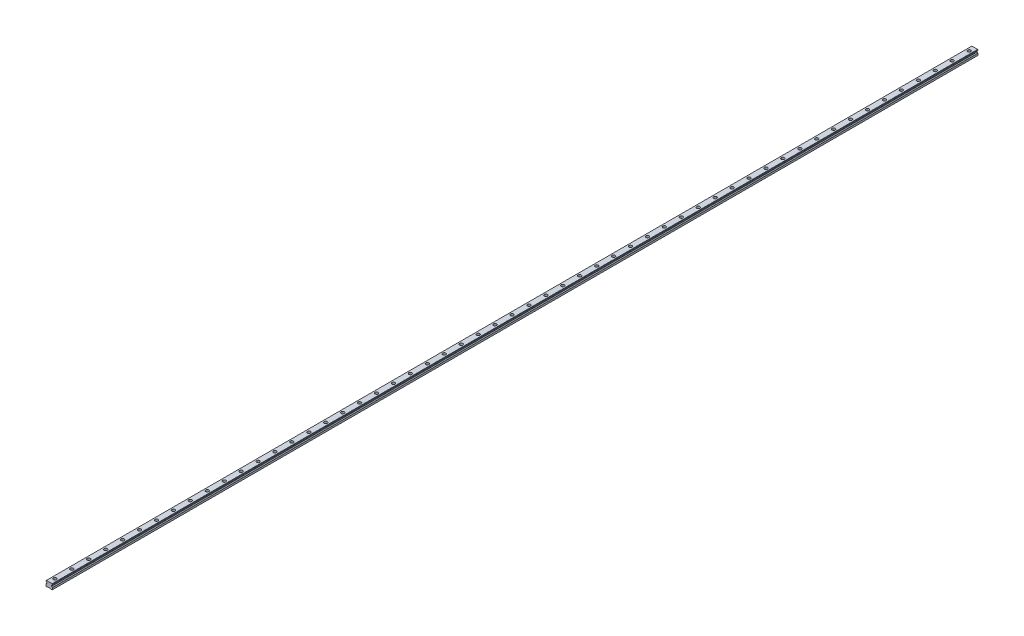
ISO-10303-21;
HEADER;
FILE_DESCRIPTION(('STEP AP214'),'2;1');
FILE_NAME('part.step','',(''),(''),'','','');
FILE_SCHEMA(('AUTOMOTIVE_DESIGN { 1 0 10303 214 1 1 1 1 }'));
ENDSEC;
DATA;
#1=APPLICATION_CONTEXT('core data for automotive mechanical design processes');
#2=APPLICATION_PROTOCOL_DEFINITION('international standard','automotive_design',2000,#1);
#3=PRODUCT_CONTEXT('',#1,'mechanical');
#4=PRODUCT('Part','Part','',(#3));
#5=PRODUCT_RELATED_PRODUCT_CATEGORY('part','',(#4));
#6=PRODUCT_DEFINITION_FORMATION('','',#4);
#7=PRODUCT_DEFINITION_CONTEXT('part definition',#1,'design');
#8=PRODUCT_DEFINITION('design','',#6,#7);
#9=PRODUCT_DEFINITION_SHAPE('','',#8);
#10=(LENGTH_UNIT() NAMED_UNIT(*) SI_UNIT(.MILLI.,.METRE.));
#11=(NAMED_UNIT(*) PLANE_ANGLE_UNIT() SI_UNIT($,.RADIAN.));
#12=(NAMED_UNIT(*) SI_UNIT($,.STERADIAN.) SOLID_ANGLE_UNIT());
#13=UNCERTAINTY_MEASURE_WITH_UNIT(LENGTH_MEASURE(1.E-05),#10,'distance_accuracy_value','');
#14=(GEOMETRIC_REPRESENTATION_CONTEXT(3) GLOBAL_UNCERTAINTY_ASSIGNED_CONTEXT((#13)) GLOBAL_UNIT_ASSIGNED_CONTEXT((#10,
#11,#12)) REPRESENTATION_CONTEXT('',''));
#15=CARTESIAN_POINT('',(0.,0.,0.));
#16=DIRECTION('',(0.,0.,1.));
#17=DIRECTION('',(1.,0.,0.));
#18=AXIS2_PLACEMENT_3D('',#15,#16,#17);
#19=CARTESIAN_POINT('',(0.,10.2,-1620.));
#20=DIRECTION('',(0.,1.,0.));
#21=DIRECTION('',(0.,0.,1.));
#22=AXIS2_PLACEMENT_3D('',#19,#20,#21);
#23=PLANE('',#22);
#24=CARTESIAN_POINT('',(0.,10.2,-1620.));
#25=DIRECTION('',(0.,1.,0.));
#26=DIRECTION('',(0.,0.,1.));
#27=AXIS2_PLACEMENT_3D('',#24,#25,#26);
#28=CIRCLE('',#27,3.49999999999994);
#29=CARTESIAN_POINT('',(0.,10.2,-1616.5));
#30=VERTEX_POINT('',#29);
#31=EDGE_CURVE('E782',#30,#30,#28,.T.);
#32=ORIENTED_EDGE('',*,*,#31,.F.);
#33=EDGE_LOOP('',(#32));
#34=FACE_BOUND('',#33,.T.);
#35=CARTESIAN_POINT('',(0.,10.2,-1620.));
#36=DIRECTION('',(0.,1.,0.));
#37=DIRECTION('',(0.,0.,1.));
#38=AXIS2_PLACEMENT_3D('',#35,#36,#37);
#39=CIRCLE('',#38,5.49999999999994);
#40=CARTESIAN_POINT('',(0.,10.2,-1614.5));
#41=VERTEX_POINT('',#40);
#42=EDGE_CURVE('E11',#41,#41,#39,.T.);
#43=ORIENTED_EDGE('',*,*,#42,.T.);
#44=EDGE_LOOP('',(#43));
#45=FACE_BOUND('',#44,.T.);
#46=ADVANCED_FACE('F39',(#34,#45),#23,.T.);
#47=CARTESIAN_POINT('',(0.,10.2,-1620.));
#48=DIRECTION('',(0.,1.,0.));
#49=DIRECTION('',(0.,0.,1.));
#50=AXIS2_PLACEMENT_3D('',#47,#48,#49);
#51=CYLINDRICAL_SURFACE('',#50,5.49999999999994);
#52=ORIENTED_EDGE('',*,*,#42,.F.);
#53=EDGE_LOOP('',(#52));
#54=FACE_BOUND('',#53,.T.);
#55=CARTESIAN_POINT('',(0.,19.2,-1620.));
#56=DIRECTION('',(0.,1.,0.));
#57=DIRECTION('',(0.,0.,1.));
#58=AXIS2_PLACEMENT_3D('',#55,#56,#57);
#59=CIRCLE('',#58,5.49999999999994);
#60=CARTESIAN_POINT('',(0.,19.2,-1614.5));
#61=VERTEX_POINT('',#60);
#62=EDGE_CURVE('E48',#61,#61,#59,.T.);
#63=ORIENTED_EDGE('',*,*,#62,.T.);
#64=EDGE_LOOP('',(#63));
#65=FACE_BOUND('',#64,.T.);
#66=ADVANCED_FACE('F1481',(#54,#65),#51,.F.);
#67=CARTESIAN_POINT('',(0.,10.2,-1560.));
#68=DIRECTION('',(0.,1.,0.));
#69=DIRECTION('',(0.,0.,1.));
#70=AXIS2_PLACEMENT_3D('',#67,#68,#69);
#71=PLANE('',#70);
#72=CARTESIAN_POINT('',(0.,10.2,-1560.));
#73=DIRECTION('',(0.,1.,0.));
#74=DIRECTION('',(0.,0.,1.));
#75=AXIS2_PLACEMENT_3D('',#72,#73,#74);
#76=CIRCLE('',#75,3.49999999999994);
#77=CARTESIAN_POINT('',(0.,10.2,-1556.5));
#78=VERTEX_POINT('',#77);
#79=EDGE_CURVE('E787',#78,#78,#76,.T.);
#80=ORIENTED_EDGE('',*,*,#79,.F.);
#81=EDGE_LOOP('',(#80));
#82=FACE_BOUND('',#81,.T.);
#83=CARTESIAN_POINT('',(0.,10.2,-1560.));
#84=DIRECTION('',(0.,1.,0.));
#85=DIRECTION('',(0.,0.,1.));
#86=AXIS2_PLACEMENT_3D('',#83,#84,#85);
#87=CIRCLE('',#86,5.49999999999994);
#88=CARTESIAN_POINT('',(0.,10.2,-1554.5));
#89=VERTEX_POINT('',#88);
#90=EDGE_CURVE('E766',#89,#89,#87,.T.);
#91=ORIENTED_EDGE('',*,*,#90,.T.);
#92=EDGE_LOOP('',(#91));
#93=FACE_BOUND('',#92,.T.);
#94=ADVANCED_FACE('F1483',(#82,#93),#71,.T.);
#95=CARTESIAN_POINT('',(0.,10.2,-1560.));
#96=DIRECTION('',(0.,1.,0.));
#97=DIRECTION('',(0.,0.,1.));
#98=AXIS2_PLACEMENT_3D('',#95,#96,#97);
#99=CYLINDRICAL_SURFACE('',#98,5.49999999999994);
#100=ORIENTED_EDGE('',*,*,#90,.F.);
#101=EDGE_LOOP('',(#100));
#102=FACE_BOUND('',#101,.T.);
#103=CARTESIAN_POINT('',(0.,19.2,-1560.));
#104=DIRECTION('',(0.,1.,0.));
#105=DIRECTION('',(0.,0.,1.));
#106=AXIS2_PLACEMENT_3D('',#103,#104,#105);
#107=CIRCLE('',#106,5.49999999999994);
#108=CARTESIAN_POINT('',(0.,19.2,-1554.5));
#109=VERTEX_POINT('',#108);
#110=EDGE_CURVE('E762',#109,#109,#107,.T.);
#111=ORIENTED_EDGE('',*,*,#110,.T.);
#112=EDGE_LOOP('',(#111));
#113=FACE_BOUND('',#112,.T.);
#114=ADVANCED_FACE('F1489',(#102,#113),#99,.F.);
#115=CARTESIAN_POINT('',(0.,10.2,-1500.));
#116=DIRECTION('',(0.,1.,0.));
#117=DIRECTION('',(0.,0.,1.));
#118=AXIS2_PLACEMENT_3D('',#115,#116,#117);
#119=PLANE('',#118);
#120=CARTESIAN_POINT('',(0.,10.2,-1500.));
#121=DIRECTION('',(0.,1.,0.));
#122=DIRECTION('',(0.,0.,1.));
#123=AXIS2_PLACEMENT_3D('',#120,#121,#122);
#124=CIRCLE('',#123,3.49999999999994);
#125=CARTESIAN_POINT('',(0.,10.2,-1496.5));
#126=VERTEX_POINT('',#125);
#127=EDGE_CURVE('E792',#126,#126,#124,.T.);
#128=ORIENTED_EDGE('',*,*,#127,.F.);
#129=EDGE_LOOP('',(#128));
#130=FACE_BOUND('',#129,.T.);
#131=CARTESIAN_POINT('',(0.,10.2,-1500.));
#132=DIRECTION('',(0.,1.,0.));
#133=DIRECTION('',(0.,0.,1.));
#134=AXIS2_PLACEMENT_3D('',#131,#132,#133);
#135=CIRCLE('',#134,5.49999999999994);
#136=CARTESIAN_POINT('',(0.,10.2,-1494.5));
#137=VERTEX_POINT('',#136);
#138=EDGE_CURVE('E758',#137,#137,#135,.T.);
#139=ORIENTED_EDGE('',*,*,#138,.T.);
#140=EDGE_LOOP('',(#139));
#141=FACE_BOUND('',#140,.T.);
#142=ADVANCED_FACE('F1497',(#130,#141),#119,.T.);
#143=CARTESIAN_POINT('',(0.,10.2,-1500.));
#144=DIRECTION('',(0.,1.,0.));
#145=DIRECTION('',(0.,0.,1.));
#146=AXIS2_PLACEMENT_3D('',#143,#144,#145);
#147=CYLINDRICAL_SURFACE('',#146,5.49999999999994);
#148=ORIENTED_EDGE('',*,*,#138,.F.);
#149=EDGE_LOOP('',(#148));
#150=FACE_BOUND('',#149,.T.);
#151=CARTESIAN_POINT('',(0.,19.2,-1500.));
#152=DIRECTION('',(0.,1.,0.));
#153=DIRECTION('',(0.,0.,1.));
#154=AXIS2_PLACEMENT_3D('',#151,#152,#153);
#155=CIRCLE('',#154,5.49999999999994);
#156=CARTESIAN_POINT('',(0.,19.2,-1494.5));
#157=VERTEX_POINT('',#156);
#158=EDGE_CURVE('E754',#157,#157,#155,.T.);
#159=ORIENTED_EDGE('',*,*,#158,.T.);
#160=EDGE_LOOP('',(#159));
#161=FACE_BOUND('',#160,.T.);
#162=ADVANCED_FACE('F1501',(#150,#161),#147,.F.);
#163=CARTESIAN_POINT('',(0.,10.2,-1440.));
#164=DIRECTION('',(0.,1.,0.));
#165=DIRECTION('',(0.,0.,1.));
#166=AXIS2_PLACEMENT_3D('',#163,#164,#165);
#167=PLANE('',#166);
#168=CARTESIAN_POINT('',(0.,10.2,-1440.));
#169=DIRECTION('',(0.,1.,0.));
#170=DIRECTION('',(0.,0.,1.));
#171=AXIS2_PLACEMENT_3D('',#168,#169,#170);
#172=CIRCLE('',#171,3.49999999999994);
#173=CARTESIAN_POINT('',(0.,10.2,-1436.5));
#174=VERTEX_POINT('',#173);
#175=EDGE_CURVE('E797',#174,#174,#172,.T.);
#176=ORIENTED_EDGE('',*,*,#175,.F.);
#177=EDGE_LOOP('',(#176));
#178=FACE_BOUND('',#177,.T.);
#179=CARTESIAN_POINT('',(0.,10.2,-1440.));
#180=DIRECTION('',(0.,1.,0.));
#181=DIRECTION('',(0.,0.,1.));
#182=AXIS2_PLACEMENT_3D('',#179,#180,#181);
#183=CIRCLE('',#182,5.49999999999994);
#184=CARTESIAN_POINT('',(0.,10.2,-1434.5));
#185=VERTEX_POINT('',#184);
#186=EDGE_CURVE('E750',#185,#185,#183,.T.);
#187=ORIENTED_EDGE('',*,*,#186,.T.);
#188=EDGE_LOOP('',(#187));
#189=FACE_BOUND('',#188,.T.);
#190=ADVANCED_FACE('F1505',(#178,#189),#167,.T.);
#191=CARTESIAN_POINT('',(0.,10.2,-1440.));
#192=DIRECTION('',(0.,1.,0.));
#193=DIRECTION('',(0.,0.,1.));
#194=AXIS2_PLACEMENT_3D('',#191,#192,#193);
#195=CYLINDRICAL_SURFACE('',#194,5.49999999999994);
#196=ORIENTED_EDGE('',*,*,#186,.F.);
#197=EDGE_LOOP('',(#196));
#198=FACE_BOUND('',#197,.T.);
#199=CARTESIAN_POINT('',(0.,19.2,-1440.));
#200=DIRECTION('',(0.,1.,0.));
#201=DIRECTION('',(0.,0.,1.));
#202=AXIS2_PLACEMENT_3D('',#199,#200,#201);
#203=CIRCLE('',#202,5.49999999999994);
#204=CARTESIAN_POINT('',(0.,19.2,-1434.5));
#205=VERTEX_POINT('',#204);
#206=EDGE_CURVE('E746',#205,#205,#203,.T.);
#207=ORIENTED_EDGE('',*,*,#206,.T.);
#208=EDGE_LOOP('',(#207));
#209=FACE_BOUND('',#208,.T.);
#210=ADVANCED_FACE('F1509',(#198,#209),#195,.F.);
#211=CARTESIAN_POINT('',(0.,10.2,-1380.));
#212=DIRECTION('',(0.,1.,0.));
#213=DIRECTION('',(0.,0.,1.));
#214=AXIS2_PLACEMENT_3D('',#211,#212,#213);
#215=PLANE('',#214);
#216=CARTESIAN_POINT('',(0.,10.2,-1380.));
#217=DIRECTION('',(0.,1.,0.));
#218=DIRECTION('',(0.,0.,1.));
#219=AXIS2_PLACEMENT_3D('',#216,#217,#218);
#220=CIRCLE('',#219,3.49999999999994);
#221=CARTESIAN_POINT('',(0.,10.2,-1376.5));
#222=VERTEX_POINT('',#221);
#223=EDGE_CURVE('E802',#222,#222,#220,.T.);
#224=ORIENTED_EDGE('',*,*,#223,.F.);
#225=EDGE_LOOP('',(#224));
#226=FACE_BOUND('',#225,.T.);
#227=CARTESIAN_POINT('',(0.,10.2,-1380.));
#228=DIRECTION('',(0.,1.,0.));
#229=DIRECTION('',(0.,0.,1.));
#230=AXIS2_PLACEMENT_3D('',#227,#228,#229);
#231=CIRCLE('',#230,5.49999999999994);
#232=CARTESIAN_POINT('',(0.,10.2,-1374.5));
#233=VERTEX_POINT('',#232);
#234=EDGE_CURVE('E742',#233,#233,#231,.T.);
#235=ORIENTED_EDGE('',*,*,#234,.T.);
#236=EDGE_LOOP('',(#235));
#237=FACE_BOUND('',#236,.T.);
#238=ADVANCED_FACE('F1513',(#226,#237),#215,.T.);
#239=CARTESIAN_POINT('',(0.,10.2,-1380.));
#240=DIRECTION('',(0.,1.,0.));
#241=DIRECTION('',(0.,0.,1.));
#242=AXIS2_PLACEMENT_3D('',#239,#240,#241);
#243=CYLINDRICAL_SURFACE('',#242,5.49999999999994);
#244=ORIENTED_EDGE('',*,*,#234,.F.);
#245=EDGE_LOOP('',(#244));
#246=FACE_BOUND('',#245,.T.);
#247=CARTESIAN_POINT('',(0.,19.2,-1380.));
#248=DIRECTION('',(0.,1.,0.));
#249=DIRECTION('',(0.,0.,1.));
#250=AXIS2_PLACEMENT_3D('',#247,#248,#249);
#251=CIRCLE('',#250,5.49999999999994);
#252=CARTESIAN_POINT('',(0.,19.2,-1374.5));
#253=VERTEX_POINT('',#252);
#254=EDGE_CURVE('E738',#253,#253,#251,.T.);
#255=ORIENTED_EDGE('',*,*,#254,.T.);
#256=EDGE_LOOP('',(#255));
#257=FACE_BOUND('',#256,.T.);
#258=ADVANCED_FACE('F1517',(#246,#257),#243,.F.);
#259=CARTESIAN_POINT('',(0.,10.2,-1320.));
#260=DIRECTION('',(0.,1.,0.));
#261=DIRECTION('',(0.,0.,1.));
#262=AXIS2_PLACEMENT_3D('',#259,#260,#261);
#263=PLANE('',#262);
#264=CARTESIAN_POINT('',(0.,10.2,-1320.));
#265=DIRECTION('',(0.,1.,0.));
#266=DIRECTION('',(0.,0.,1.));
#267=AXIS2_PLACEMENT_3D('',#264,#265,#266);
#268=CIRCLE('',#267,3.49999999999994);
#269=CARTESIAN_POINT('',(0.,10.2,-1316.5));
#270=VERTEX_POINT('',#269);
#271=EDGE_CURVE('E807',#270,#270,#268,.T.);
#272=ORIENTED_EDGE('',*,*,#271,.F.);
#273=EDGE_LOOP('',(#272));
#274=FACE_BOUND('',#273,.T.);
#275=CARTESIAN_POINT('',(0.,10.2,-1320.));
#276=DIRECTION('',(0.,1.,0.));
#277=DIRECTION('',(0.,0.,1.));
#278=AXIS2_PLACEMENT_3D('',#275,#276,#277);
#279=CIRCLE('',#278,5.49999999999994);
#280=CARTESIAN_POINT('',(0.,10.2,-1314.5));
#281=VERTEX_POINT('',#280);
#282=EDGE_CURVE('E734',#281,#281,#279,.T.);
#283=ORIENTED_EDGE('',*,*,#282,.T.);
#284=EDGE_LOOP('',(#283));
#285=FACE_BOUND('',#284,.T.);
#286=ADVANCED_FACE('F1521',(#274,#285),#263,.T.);
#287=CARTESIAN_POINT('',(0.,10.2,-1320.));
#288=DIRECTION('',(0.,1.,0.));
#289=DIRECTION('',(0.,0.,1.));
#290=AXIS2_PLACEMENT_3D('',#287,#288,#289);
#291=CYLINDRICAL_SURFACE('',#290,5.49999999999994);
#292=ORIENTED_EDGE('',*,*,#282,.F.);
#293=EDGE_LOOP('',(#292));
#294=FACE_BOUND('',#293,.T.);
#295=CARTESIAN_POINT('',(0.,19.2,-1320.));
#296=DIRECTION('',(0.,1.,0.));
#297=DIRECTION('',(0.,0.,1.));
#298=AXIS2_PLACEMENT_3D('',#295,#296,#297);
#299=CIRCLE('',#298,5.49999999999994);
#300=CARTESIAN_POINT('',(0.,19.2,-1314.5));
#301=VERTEX_POINT('',#300);
#302=EDGE_CURVE('E730',#301,#301,#299,.T.);
#303=ORIENTED_EDGE('',*,*,#302,.T.);
#304=EDGE_LOOP('',(#303));
#305=FACE_BOUND('',#304,.T.);
#306=ADVANCED_FACE('F1525',(#294,#305),#291,.F.);
#307=CARTESIAN_POINT('',(0.,10.2,-1260.));
#308=DIRECTION('',(0.,1.,0.));
#309=DIRECTION('',(0.,0.,1.));
#310=AXIS2_PLACEMENT_3D('',#307,#308,#309);
#311=PLANE('',#310);
#312=CARTESIAN_POINT('',(0.,10.2,-1260.));
#313=DIRECTION('',(0.,1.,0.));
#314=DIRECTION('',(0.,0.,1.));
#315=AXIS2_PLACEMENT_3D('',#312,#313,#314);
#316=CIRCLE('',#315,3.49999999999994);
#317=CARTESIAN_POINT('',(0.,10.2,-1256.5));
#318=VERTEX_POINT('',#317);
#319=EDGE_CURVE('E812',#318,#318,#316,.T.);
#320=ORIENTED_EDGE('',*,*,#319,.F.);
#321=EDGE_LOOP('',(#320));
#322=FACE_BOUND('',#321,.T.);
#323=CARTESIAN_POINT('',(0.,10.2,-1260.));
#324=DIRECTION('',(0.,1.,0.));
#325=DIRECTION('',(0.,0.,1.));
#326=AXIS2_PLACEMENT_3D('',#323,#324,#325);
#327=CIRCLE('',#326,5.49999999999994);
#328=CARTESIAN_POINT('',(0.,10.2,-1254.5));
#329=VERTEX_POINT('',#328);
#330=EDGE_CURVE('E726',#329,#329,#327,.T.);
#331=ORIENTED_EDGE('',*,*,#330,.T.);
#332=EDGE_LOOP('',(#331));
#333=FACE_BOUND('',#332,.T.);
#334=ADVANCED_FACE('F1529',(#322,#333),#311,.T.);
#335=CARTESIAN_POINT('',(0.,10.2,-1260.));
#336=DIRECTION('',(0.,1.,0.));
#337=DIRECTION('',(0.,0.,1.));
#338=AXIS2_PLACEMENT_3D('',#335,#336,#337);
#339=CYLINDRICAL_SURFACE('',#338,5.49999999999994);
#340=ORIENTED_EDGE('',*,*,#330,.F.);
#341=EDGE_LOOP('',(#340));
#342=FACE_BOUND('',#341,.T.);
#343=CARTESIAN_POINT('',(0.,19.2,-1260.));
#344=DIRECTION('',(0.,1.,0.));
#345=DIRECTION('',(0.,0.,1.));
#346=AXIS2_PLACEMENT_3D('',#343,#344,#345);
#347=CIRCLE('',#346,5.49999999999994);
#348=CARTESIAN_POINT('',(0.,19.2,-1254.5));
#349=VERTEX_POINT('',#348);
#350=EDGE_CURVE('E722',#349,#349,#347,.T.);
#351=ORIENTED_EDGE('',*,*,#350,.T.);
#352=EDGE_LOOP('',(#351));
#353=FACE_BOUND('',#352,.T.);
#354=ADVANCED_FACE('F1533',(#342,#353),#339,.F.);
#355=CARTESIAN_POINT('',(0.,10.2,-1200.));
#356=DIRECTION('',(0.,1.,0.));
#357=DIRECTION('',(0.,0.,1.));
#358=AXIS2_PLACEMENT_3D('',#355,#356,#357);
#359=PLANE('',#358);
#360=CARTESIAN_POINT('',(0.,10.2,-1200.));
#361=DIRECTION('',(0.,1.,0.));
#362=DIRECTION('',(0.,0.,1.));
#363=AXIS2_PLACEMENT_3D('',#360,#361,#362);
#364=CIRCLE('',#363,3.49999999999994);
#365=CARTESIAN_POINT('',(0.,10.2,-1196.5));
#366=VERTEX_POINT('',#365);
#367=EDGE_CURVE('E817',#366,#366,#364,.T.);
#368=ORIENTED_EDGE('',*,*,#367,.F.);
#369=EDGE_LOOP('',(#368));
#370=FACE_BOUND('',#369,.T.);
#371=CARTESIAN_POINT('',(0.,10.2,-1200.));
#372=DIRECTION('',(0.,1.,0.));
#373=DIRECTION('',(0.,0.,1.));
#374=AXIS2_PLACEMENT_3D('',#371,#372,#373);
#375=CIRCLE('',#374,5.49999999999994);
#376=CARTESIAN_POINT('',(0.,10.2,-1194.5));
#377=VERTEX_POINT('',#376);
#378=EDGE_CURVE('E718',#377,#377,#375,.T.);
#379=ORIENTED_EDGE('',*,*,#378,.T.);
#380=EDGE_LOOP('',(#379));
#381=FACE_BOUND('',#380,.T.);
#382=ADVANCED_FACE('F1537',(#370,#381),#359,.T.);
#383=CARTESIAN_POINT('',(0.,10.2,-1200.));
#384=DIRECTION('',(0.,1.,0.));
#385=DIRECTION('',(0.,0.,1.));
#386=AXIS2_PLACEMENT_3D('',#383,#384,#385);
#387=CYLINDRICAL_SURFACE('',#386,5.49999999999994);
#388=ORIENTED_EDGE('',*,*,#378,.F.);
#389=EDGE_LOOP('',(#388));
#390=FACE_BOUND('',#389,.T.);
#391=CARTESIAN_POINT('',(0.,19.2,-1200.));
#392=DIRECTION('',(0.,1.,0.));
#393=DIRECTION('',(0.,0.,1.));
#394=AXIS2_PLACEMENT_3D('',#391,#392,#393);
#395=CIRCLE('',#394,5.49999999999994);
#396=CARTESIAN_POINT('',(0.,19.2,-1194.5));
#397=VERTEX_POINT('',#396);
#398=EDGE_CURVE('E714',#397,#397,#395,.T.);
#399=ORIENTED_EDGE('',*,*,#398,.T.);
#400=EDGE_LOOP('',(#399));
#401=FACE_BOUND('',#400,.T.);
#402=ADVANCED_FACE('F1541',(#390,#401),#387,.F.);
#403=CARTESIAN_POINT('',(0.,10.2,-1140.));
#404=DIRECTION('',(0.,1.,0.));
#405=DIRECTION('',(0.,0.,1.));
#406=AXIS2_PLACEMENT_3D('',#403,#404,#405);
#407=PLANE('',#406);
#408=CARTESIAN_POINT('',(0.,10.2,-1140.));
#409=DIRECTION('',(0.,1.,0.));
#410=DIRECTION('',(0.,0.,1.));
#411=AXIS2_PLACEMENT_3D('',#408,#409,#410);
#412=CIRCLE('',#411,3.49999999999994);
#413=CARTESIAN_POINT('',(0.,10.2,-1136.5));
#414=VERTEX_POINT('',#413);
#415=EDGE_CURVE('E822',#414,#414,#412,.T.);
#416=ORIENTED_EDGE('',*,*,#415,.F.);
#417=EDGE_LOOP('',(#416));
#418=FACE_BOUND('',#417,.T.);
#419=CARTESIAN_POINT('',(0.,10.2,-1140.));
#420=DIRECTION('',(0.,1.,0.));
#421=DIRECTION('',(0.,0.,1.));
#422=AXIS2_PLACEMENT_3D('',#419,#420,#421);
#423=CIRCLE('',#422,5.49999999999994);
#424=CARTESIAN_POINT('',(0.,10.2,-1134.5));
#425=VERTEX_POINT('',#424);
#426=EDGE_CURVE('E710',#425,#425,#423,.T.);
#427=ORIENTED_EDGE('',*,*,#426,.T.);
#428=EDGE_LOOP('',(#427));
#429=FACE_BOUND('',#428,.T.);
#430=ADVANCED_FACE('F1545',(#418,#429),#407,.T.);
#431=CARTESIAN_POINT('',(0.,10.2,-1140.));
#432=DIRECTION('',(0.,1.,0.));
#433=DIRECTION('',(0.,0.,1.));
#434=AXIS2_PLACEMENT_3D('',#431,#432,#433);
#435=CYLINDRICAL_SURFACE('',#434,5.49999999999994);
#436=ORIENTED_EDGE('',*,*,#426,.F.);
#437=EDGE_LOOP('',(#436));
#438=FACE_BOUND('',#437,.T.);
#439=CARTESIAN_POINT('',(0.,19.2,-1140.));
#440=DIRECTION('',(0.,1.,0.));
#441=DIRECTION('',(0.,0.,1.));
#442=AXIS2_PLACEMENT_3D('',#439,#440,#441);
#443=CIRCLE('',#442,5.49999999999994);
#444=CARTESIAN_POINT('',(0.,19.2,-1134.5));
#445=VERTEX_POINT('',#444);
#446=EDGE_CURVE('E706',#445,#445,#443,.T.);
#447=ORIENTED_EDGE('',*,*,#446,.T.);
#448=EDGE_LOOP('',(#447));
#449=FACE_BOUND('',#448,.T.);
#450=ADVANCED_FACE('F1549',(#438,#449),#435,.F.);
#451=CARTESIAN_POINT('',(0.,10.2,-1080.));
#452=DIRECTION('',(0.,1.,0.));
#453=DIRECTION('',(0.,0.,1.));
#454=AXIS2_PLACEMENT_3D('',#451,#452,#453);
#455=PLANE('',#454);
#456=CARTESIAN_POINT('',(0.,10.2,-1080.));
#457=DIRECTION('',(0.,1.,0.));
#458=DIRECTION('',(0.,0.,1.));
#459=AXIS2_PLACEMENT_3D('',#456,#457,#458);
#460=CIRCLE('',#459,3.49999999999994);
#461=CARTESIAN_POINT('',(0.,10.2,-1076.5));
#462=VERTEX_POINT('',#461);
#463=EDGE_CURVE('E827',#462,#462,#460,.T.);
#464=ORIENTED_EDGE('',*,*,#463,.F.);
#465=EDGE_LOOP('',(#464));
#466=FACE_BOUND('',#465,.T.);
#467=CARTESIAN_POINT('',(0.,10.2,-1080.));
#468=DIRECTION('',(0.,1.,0.));
#469=DIRECTION('',(0.,0.,1.));
#470=AXIS2_PLACEMENT_3D('',#467,#468,#469);
#471=CIRCLE('',#470,5.49999999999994);
#472=CARTESIAN_POINT('',(0.,10.2,-1074.5));
#473=VERTEX_POINT('',#472);
#474=EDGE_CURVE('E702',#473,#473,#471,.T.);
#475=ORIENTED_EDGE('',*,*,#474,.T.);
#476=EDGE_LOOP('',(#475));
#477=FACE_BOUND('',#476,.T.);
#478=ADVANCED_FACE('F1553',(#466,#477),#455,.T.);
#479=CARTESIAN_POINT('',(0.,10.2,-1080.));
#480=DIRECTION('',(0.,1.,0.));
#481=DIRECTION('',(0.,0.,1.));
#482=AXIS2_PLACEMENT_3D('',#479,#480,#481);
#483=CYLINDRICAL_SURFACE('',#482,5.49999999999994);
#484=ORIENTED_EDGE('',*,*,#474,.F.);
#485=EDGE_LOOP('',(#484));
#486=FACE_BOUND('',#485,.T.);
#487=CARTESIAN_POINT('',(0.,19.2,-1080.));
#488=DIRECTION('',(0.,1.,0.));
#489=DIRECTION('',(0.,0.,1.));
#490=AXIS2_PLACEMENT_3D('',#487,#488,#489);
#491=CIRCLE('',#490,5.49999999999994);
#492=CARTESIAN_POINT('',(0.,19.2,-1074.5));
#493=VERTEX_POINT('',#492);
#494=EDGE_CURVE('E698',#493,#493,#491,.T.);
#495=ORIENTED_EDGE('',*,*,#494,.T.);
#496=EDGE_LOOP('',(#495));
#497=FACE_BOUND('',#496,.T.);
#498=ADVANCED_FACE('F1557',(#486,#497),#483,.F.);
#499=CARTESIAN_POINT('',(0.,10.2,-1020.));
#500=DIRECTION('',(0.,1.,0.));
#501=DIRECTION('',(0.,0.,1.));
#502=AXIS2_PLACEMENT_3D('',#499,#500,#501);
#503=PLANE('',#502);
#504=CARTESIAN_POINT('',(0.,10.2,-1020.));
#505=DIRECTION('',(0.,1.,0.));
#506=DIRECTION('',(0.,0.,1.));
#507=AXIS2_PLACEMENT_3D('',#504,#505,#506);
#508=CIRCLE('',#507,3.49999999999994);
#509=CARTESIAN_POINT('',(0.,10.2,-1016.5));
#510=VERTEX_POINT('',#509);
#511=EDGE_CURVE('E832',#510,#510,#508,.T.);
#512=ORIENTED_EDGE('',*,*,#511,.F.);
#513=EDGE_LOOP('',(#512));
#514=FACE_BOUND('',#513,.T.);
#515=CARTESIAN_POINT('',(0.,10.2,-1020.));
#516=DIRECTION('',(0.,1.,0.));
#517=DIRECTION('',(0.,0.,1.));
#518=AXIS2_PLACEMENT_3D('',#515,#516,#517);
#519=CIRCLE('',#518,5.49999999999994);
#520=CARTESIAN_POINT('',(0.,10.2,-1014.5));
#521=VERTEX_POINT('',#520);
#522=EDGE_CURVE('E694',#521,#521,#519,.T.);
#523=ORIENTED_EDGE('',*,*,#522,.T.);
#524=EDGE_LOOP('',(#523));
#525=FACE_BOUND('',#524,.T.);
#526=ADVANCED_FACE('F1561',(#514,#525),#503,.T.);
#527=CARTESIAN_POINT('',(0.,10.2,-1020.));
#528=DIRECTION('',(0.,1.,0.));
#529=DIRECTION('',(0.,0.,1.));
#530=AXIS2_PLACEMENT_3D('',#527,#528,#529);
#531=CYLINDRICAL_SURFACE('',#530,5.49999999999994);
#532=ORIENTED_EDGE('',*,*,#522,.F.);
#533=EDGE_LOOP('',(#532));
#534=FACE_BOUND('',#533,.T.);
#535=CARTESIAN_POINT('',(0.,19.2,-1020.));
#536=DIRECTION('',(0.,1.,0.));
#537=DIRECTION('',(0.,0.,1.));
#538=AXIS2_PLACEMENT_3D('',#535,#536,#537);
#539=CIRCLE('',#538,5.49999999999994);
#540=CARTESIAN_POINT('',(0.,19.2,-1014.5));
#541=VERTEX_POINT('',#540);
#542=EDGE_CURVE('E690',#541,#541,#539,.T.);
#543=ORIENTED_EDGE('',*,*,#542,.T.);
#544=EDGE_LOOP('',(#543));
#545=FACE_BOUND('',#544,.T.);
#546=ADVANCED_FACE('F1565',(#534,#545),#531,.F.);
#547=CARTESIAN_POINT('',(0.,10.2,-960.));
#548=DIRECTION('',(0.,1.,0.));
#549=DIRECTION('',(0.,0.,1.));
#550=AXIS2_PLACEMENT_3D('',#547,#548,#549);
#551=PLANE('',#550);
#552=CARTESIAN_POINT('',(0.,10.2,-960.));
#553=DIRECTION('',(0.,1.,0.));
#554=DIRECTION('',(0.,0.,1.));
#555=AXIS2_PLACEMENT_3D('',#552,#553,#554);
#556=CIRCLE('',#555,3.49999999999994);
#557=CARTESIAN_POINT('',(0.,10.2,-956.5));
#558=VERTEX_POINT('',#557);
#559=EDGE_CURVE('E837',#558,#558,#556,.T.);
#560=ORIENTED_EDGE('',*,*,#559,.F.);
#561=EDGE_LOOP('',(#560));
#562=FACE_BOUND('',#561,.T.);
#563=CARTESIAN_POINT('',(0.,10.2,-960.));
#564=DIRECTION('',(0.,1.,0.));
#565=DIRECTION('',(0.,0.,1.));
#566=AXIS2_PLACEMENT_3D('',#563,#564,#565);
#567=CIRCLE('',#566,5.49999999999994);
#568=CARTESIAN_POINT('',(0.,10.2,-954.5));
#569=VERTEX_POINT('',#568);
#570=EDGE_CURVE('E686',#569,#569,#567,.T.);
#571=ORIENTED_EDGE('',*,*,#570,.T.);
#572=EDGE_LOOP('',(#571));
#573=FACE_BOUND('',#572,.T.);
#574=ADVANCED_FACE('F1569',(#562,#573),#551,.T.);
#575=CARTESIAN_POINT('',(0.,10.2,-960.));
#576=DIRECTION('',(0.,1.,0.));
#577=DIRECTION('',(0.,0.,1.));
#578=AXIS2_PLACEMENT_3D('',#575,#576,#577);
#579=CYLINDRICAL_SURFACE('',#578,5.49999999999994);
#580=ORIENTED_EDGE('',*,*,#570,.F.);
#581=EDGE_LOOP('',(#580));
#582=FACE_BOUND('',#581,.T.);
#583=CARTESIAN_POINT('',(0.,19.2,-960.));
#584=DIRECTION('',(0.,1.,0.));
#585=DIRECTION('',(0.,0.,1.));
#586=AXIS2_PLACEMENT_3D('',#583,#584,#585);
#587=CIRCLE('',#586,5.49999999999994);
#588=CARTESIAN_POINT('',(0.,19.2,-954.5));
#589=VERTEX_POINT('',#588);
#590=EDGE_CURVE('E682',#589,#589,#587,.T.);
#591=ORIENTED_EDGE('',*,*,#590,.T.);
#592=EDGE_LOOP('',(#591));
#593=FACE_BOUND('',#592,.T.);
#594=ADVANCED_FACE('F1573',(#582,#593),#579,.F.);
#595=CARTESIAN_POINT('',(0.,10.2,-900.));
#596=DIRECTION('',(0.,1.,0.));
#597=DIRECTION('',(0.,0.,1.));
#598=AXIS2_PLACEMENT_3D('',#595,#596,#597);
#599=PLANE('',#598);
#600=CARTESIAN_POINT('',(0.,10.2,-900.));
#601=DIRECTION('',(0.,1.,0.));
#602=DIRECTION('',(0.,0.,1.));
#603=AXIS2_PLACEMENT_3D('',#600,#601,#602);
#604=CIRCLE('',#603,3.49999999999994);
#605=CARTESIAN_POINT('',(0.,10.2,-896.5));
#606=VERTEX_POINT('',#605);
#607=EDGE_CURVE('E842',#606,#606,#604,.T.);
#608=ORIENTED_EDGE('',*,*,#607,.F.);
#609=EDGE_LOOP('',(#608));
#610=FACE_BOUND('',#609,.T.);
#611=CARTESIAN_POINT('',(0.,10.2,-900.));
#612=DIRECTION('',(0.,1.,0.));
#613=DIRECTION('',(0.,0.,1.));
#614=AXIS2_PLACEMENT_3D('',#611,#612,#613);
#615=CIRCLE('',#614,5.49999999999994);
#616=CARTESIAN_POINT('',(0.,10.2,-894.5));
#617=VERTEX_POINT('',#616);
#618=EDGE_CURVE('E678',#617,#617,#615,.T.);
#619=ORIENTED_EDGE('',*,*,#618,.T.);
#620=EDGE_LOOP('',(#619));
#621=FACE_BOUND('',#620,.T.);
#622=ADVANCED_FACE('F1577',(#610,#621),#599,.T.);
#623=CARTESIAN_POINT('',(0.,10.2,-900.));
#624=DIRECTION('',(0.,1.,0.));
#625=DIRECTION('',(0.,0.,1.));
#626=AXIS2_PLACEMENT_3D('',#623,#624,#625);
#627=CYLINDRICAL_SURFACE('',#626,5.49999999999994);
#628=ORIENTED_EDGE('',*,*,#618,.F.);
#629=EDGE_LOOP('',(#628));
#630=FACE_BOUND('',#629,.T.);
#631=CARTESIAN_POINT('',(0.,19.2,-900.));
#632=DIRECTION('',(0.,1.,0.));
#633=DIRECTION('',(0.,0.,1.));
#634=AXIS2_PLACEMENT_3D('',#631,#632,#633);
#635=CIRCLE('',#634,5.49999999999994);
#636=CARTESIAN_POINT('',(0.,19.2,-894.5));
#637=VERTEX_POINT('',#636);
#638=EDGE_CURVE('E674',#637,#637,#635,.T.);
#639=ORIENTED_EDGE('',*,*,#638,.T.);
#640=EDGE_LOOP('',(#639));
#641=FACE_BOUND('',#640,.T.);
#642=ADVANCED_FACE('F1581',(#630,#641),#627,.F.);
#643=CARTESIAN_POINT('',(0.,10.2,-840.));
#644=DIRECTION('',(0.,1.,0.));
#645=DIRECTION('',(0.,0.,1.));
#646=AXIS2_PLACEMENT_3D('',#643,#644,#645);
#647=PLANE('',#646);
#648=CARTESIAN_POINT('',(0.,10.2,-840.));
#649=DIRECTION('',(0.,1.,0.));
#650=DIRECTION('',(0.,0.,1.));
#651=AXIS2_PLACEMENT_3D('',#648,#649,#650);
#652=CIRCLE('',#651,3.49999999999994);
#653=CARTESIAN_POINT('',(0.,10.2,-836.5));
#654=VERTEX_POINT('',#653);
#655=EDGE_CURVE('E847',#654,#654,#652,.T.);
#656=ORIENTED_EDGE('',*,*,#655,.F.);
#657=EDGE_LOOP('',(#656));
#658=FACE_BOUND('',#657,.T.);
#659=CARTESIAN_POINT('',(0.,10.2,-840.));
#660=DIRECTION('',(0.,1.,0.));
#661=DIRECTION('',(0.,0.,1.));
#662=AXIS2_PLACEMENT_3D('',#659,#660,#661);
#663=CIRCLE('',#662,5.49999999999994);
#664=CARTESIAN_POINT('',(0.,10.2,-834.5));
#665=VERTEX_POINT('',#664);
#666=EDGE_CURVE('E670',#665,#665,#663,.T.);
#667=ORIENTED_EDGE('',*,*,#666,.T.);
#668=EDGE_LOOP('',(#667));
#669=FACE_BOUND('',#668,.T.);
#670=ADVANCED_FACE('F1585',(#658,#669),#647,.T.);
#671=CARTESIAN_POINT('',(0.,10.2,-840.));
#672=DIRECTION('',(0.,1.,0.));
#673=DIRECTION('',(0.,0.,1.));
#674=AXIS2_PLACEMENT_3D('',#671,#672,#673);
#675=CYLINDRICAL_SURFACE('',#674,5.49999999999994);
#676=ORIENTED_EDGE('',*,*,#666,.F.);
#677=EDGE_LOOP('',(#676));
#678=FACE_BOUND('',#677,.T.);
#679=CARTESIAN_POINT('',(0.,19.2,-840.));
#680=DIRECTION('',(0.,1.,0.));
#681=DIRECTION('',(0.,0.,1.));
#682=AXIS2_PLACEMENT_3D('',#679,#680,#681);
#683=CIRCLE('',#682,5.49999999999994);
#684=CARTESIAN_POINT('',(0.,19.2,-834.5));
#685=VERTEX_POINT('',#684);
#686=EDGE_CURVE('E666',#685,#685,#683,.T.);
#687=ORIENTED_EDGE('',*,*,#686,.T.);
#688=EDGE_LOOP('',(#687));
#689=FACE_BOUND('',#688,.T.);
#690=ADVANCED_FACE('F1589',(#678,#689),#675,.F.);
#691=CARTESIAN_POINT('',(0.,10.2,-780.));
#692=DIRECTION('',(0.,1.,0.));
#693=DIRECTION('',(0.,0.,1.));
#694=AXIS2_PLACEMENT_3D('',#691,#692,#693);
#695=PLANE('',#694);
#696=CARTESIAN_POINT('',(0.,10.2,-780.));
#697=DIRECTION('',(0.,1.,0.));
#698=DIRECTION('',(0.,0.,1.));
#699=AXIS2_PLACEMENT_3D('',#696,#697,#698);
#700=CIRCLE('',#699,3.49999999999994);
#701=CARTESIAN_POINT('',(0.,10.2,-776.5));
#702=VERTEX_POINT('',#701);
#703=EDGE_CURVE('E852',#702,#702,#700,.T.);
#704=ORIENTED_EDGE('',*,*,#703,.F.);
#705=EDGE_LOOP('',(#704));
#706=FACE_BOUND('',#705,.T.);
#707=CARTESIAN_POINT('',(0.,10.2,-780.));
#708=DIRECTION('',(0.,1.,0.));
#709=DIRECTION('',(0.,0.,1.));
#710=AXIS2_PLACEMENT_3D('',#707,#708,#709);
#711=CIRCLE('',#710,5.49999999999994);
#712=CARTESIAN_POINT('',(0.,10.2,-774.5));
#713=VERTEX_POINT('',#712);
#714=EDGE_CURVE('E662',#713,#713,#711,.T.);
#715=ORIENTED_EDGE('',*,*,#714,.T.);
#716=EDGE_LOOP('',(#715));
#717=FACE_BOUND('',#716,.T.);
#718=ADVANCED_FACE('F1593',(#706,#717),#695,.T.);
#719=CARTESIAN_POINT('',(0.,10.2,-780.));
#720=DIRECTION('',(0.,1.,0.));
#721=DIRECTION('',(0.,0.,1.));
#722=AXIS2_PLACEMENT_3D('',#719,#720,#721);
#723=CYLINDRICAL_SURFACE('',#722,5.49999999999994);
#724=ORIENTED_EDGE('',*,*,#714,.F.);
#725=EDGE_LOOP('',(#724));
#726=FACE_BOUND('',#725,.T.);
#727=CARTESIAN_POINT('',(0.,19.2,-780.));
#728=DIRECTION('',(0.,1.,0.));
#729=DIRECTION('',(0.,0.,1.));
#730=AXIS2_PLACEMENT_3D('',#727,#728,#729);
#731=CIRCLE('',#730,5.49999999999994);
#732=CARTESIAN_POINT('',(0.,19.2,-774.5));
#733=VERTEX_POINT('',#732);
#734=EDGE_CURVE('E658',#733,#733,#731,.T.);
#735=ORIENTED_EDGE('',*,*,#734,.T.);
#736=EDGE_LOOP('',(#735));
#737=FACE_BOUND('',#736,.T.);
#738=ADVANCED_FACE('F1597',(#726,#737),#723,.F.);
#739=CARTESIAN_POINT('',(0.,10.2,-720.));
#740=DIRECTION('',(0.,1.,0.));
#741=DIRECTION('',(0.,0.,1.));
#742=AXIS2_PLACEMENT_3D('',#739,#740,#741);
#743=PLANE('',#742);
#744=CARTESIAN_POINT('',(0.,10.2,-720.));
#745=DIRECTION('',(0.,1.,0.));
#746=DIRECTION('',(0.,0.,1.));
#747=AXIS2_PLACEMENT_3D('',#744,#745,#746);
#748=CIRCLE('',#747,3.49999999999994);
#749=CARTESIAN_POINT('',(0.,10.2,-716.5));
#750=VERTEX_POINT('',#749);
#751=EDGE_CURVE('E857',#750,#750,#748,.T.);
#752=ORIENTED_EDGE('',*,*,#751,.F.);
#753=EDGE_LOOP('',(#752));
#754=FACE_BOUND('',#753,.T.);
#755=CARTESIAN_POINT('',(0.,10.2,-720.));
#756=DIRECTION('',(0.,1.,0.));
#757=DIRECTION('',(0.,0.,1.));
#758=AXIS2_PLACEMENT_3D('',#755,#756,#757);
#759=CIRCLE('',#758,5.49999999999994);
#760=CARTESIAN_POINT('',(0.,10.2,-714.5));
#761=VERTEX_POINT('',#760);
#762=EDGE_CURVE('E654',#761,#761,#759,.T.);
#763=ORIENTED_EDGE('',*,*,#762,.T.);
#764=EDGE_LOOP('',(#763));
#765=FACE_BOUND('',#764,.T.);
#766=ADVANCED_FACE('F1601',(#754,#765),#743,.T.);
#767=CARTESIAN_POINT('',(0.,10.2,-720.));
#768=DIRECTION('',(0.,1.,0.));
#769=DIRECTION('',(0.,0.,1.));
#770=AXIS2_PLACEMENT_3D('',#767,#768,#769);
#771=CYLINDRICAL_SURFACE('',#770,5.49999999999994);
#772=ORIENTED_EDGE('',*,*,#762,.F.);
#773=EDGE_LOOP('',(#772));
#774=FACE_BOUND('',#773,.T.);
#775=CARTESIAN_POINT('',(0.,19.2,-720.));
#776=DIRECTION('',(0.,1.,0.));
#777=DIRECTION('',(0.,0.,1.));
#778=AXIS2_PLACEMENT_3D('',#775,#776,#777);
#779=CIRCLE('',#778,5.49999999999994);
#780=CARTESIAN_POINT('',(0.,19.2,-714.5));
#781=VERTEX_POINT('',#780);
#782=EDGE_CURVE('E650',#781,#781,#779,.T.);
#783=ORIENTED_EDGE('',*,*,#782,.T.);
#784=EDGE_LOOP('',(#783));
#785=FACE_BOUND('',#784,.T.);
#786=ADVANCED_FACE('F1605',(#774,#785),#771,.F.);
#787=CARTESIAN_POINT('',(0.,10.2,-660.));
#788=DIRECTION('',(0.,1.,0.));
#789=DIRECTION('',(0.,0.,1.));
#790=AXIS2_PLACEMENT_3D('',#787,#788,#789);
#791=PLANE('',#790);
#792=CARTESIAN_POINT('',(0.,10.2,-660.));
#793=DIRECTION('',(0.,1.,0.));
#794=DIRECTION('',(0.,0.,1.));
#795=AXIS2_PLACEMENT_3D('',#792,#793,#794);
#796=CIRCLE('',#795,3.49999999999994);
#797=CARTESIAN_POINT('',(0.,10.2,-656.5));
#798=VERTEX_POINT('',#797);
#799=EDGE_CURVE('E862',#798,#798,#796,.T.);
#800=ORIENTED_EDGE('',*,*,#799,.F.);
#801=EDGE_LOOP('',(#800));
#802=FACE_BOUND('',#801,.T.);
#803=CARTESIAN_POINT('',(0.,10.2,-660.));
#804=DIRECTION('',(0.,1.,0.));
#805=DIRECTION('',(0.,0.,1.));
#806=AXIS2_PLACEMENT_3D('',#803,#804,#805);
#807=CIRCLE('',#806,5.49999999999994);
#808=CARTESIAN_POINT('',(0.,10.2,-654.5));
#809=VERTEX_POINT('',#808);
#810=EDGE_CURVE('E646',#809,#809,#807,.T.);
#811=ORIENTED_EDGE('',*,*,#810,.T.);
#812=EDGE_LOOP('',(#811));
#813=FACE_BOUND('',#812,.T.);
#814=ADVANCED_FACE('F1609',(#802,#813),#791,.T.);
#815=CARTESIAN_POINT('',(0.,10.2,-660.));
#816=DIRECTION('',(0.,1.,0.));
#817=DIRECTION('',(0.,0.,1.));
#818=AXIS2_PLACEMENT_3D('',#815,#816,#817);
#819=CYLINDRICAL_SURFACE('',#818,5.49999999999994);
#820=ORIENTED_EDGE('',*,*,#810,.F.);
#821=EDGE_LOOP('',(#820));
#822=FACE_BOUND('',#821,.T.);
#823=CARTESIAN_POINT('',(0.,19.2,-660.));
#824=DIRECTION('',(0.,1.,0.));
#825=DIRECTION('',(0.,0.,1.));
#826=AXIS2_PLACEMENT_3D('',#823,#824,#825);
#827=CIRCLE('',#826,5.49999999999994);
#828=CARTESIAN_POINT('',(0.,19.2,-654.5));
#829=VERTEX_POINT('',#828);
#830=EDGE_CURVE('E642',#829,#829,#827,.T.);
#831=ORIENTED_EDGE('',*,*,#830,.T.);
#832=EDGE_LOOP('',(#831));
#833=FACE_BOUND('',#832,.T.);
#834=ADVANCED_FACE('F1613',(#822,#833),#819,.F.);
#835=CARTESIAN_POINT('',(0.,10.2,-600.));
#836=DIRECTION('',(0.,1.,0.));
#837=DIRECTION('',(0.,0.,1.));
#838=AXIS2_PLACEMENT_3D('',#835,#836,#837);
#839=PLANE('',#838);
#840=CARTESIAN_POINT('',(0.,10.2,-600.));
#841=DIRECTION('',(0.,1.,0.));
#842=DIRECTION('',(0.,0.,1.));
#843=AXIS2_PLACEMENT_3D('',#840,#841,#842);
#844=CIRCLE('',#843,3.49999999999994);
#845=CARTESIAN_POINT('',(0.,10.2,-596.5));
#846=VERTEX_POINT('',#845);
#847=EDGE_CURVE('E867',#846,#846,#844,.T.);
#848=ORIENTED_EDGE('',*,*,#847,.F.);
#849=EDGE_LOOP('',(#848));
#850=FACE_BOUND('',#849,.T.);
#851=CARTESIAN_POINT('',(0.,10.2,-600.));
#852=DIRECTION('',(0.,1.,0.));
#853=DIRECTION('',(0.,0.,1.));
#854=AXIS2_PLACEMENT_3D('',#851,#852,#853);
#855=CIRCLE('',#854,5.49999999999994);
#856=CARTESIAN_POINT('',(0.,10.2,-594.5));
#857=VERTEX_POINT('',#856);
#858=EDGE_CURVE('E638',#857,#857,#855,.T.);
#859=ORIENTED_EDGE('',*,*,#858,.T.);
#860=EDGE_LOOP('',(#859));
#861=FACE_BOUND('',#860,.T.);
#862=ADVANCED_FACE('F1617',(#850,#861),#839,.T.);
#863=CARTESIAN_POINT('',(0.,10.2,-600.));
#864=DIRECTION('',(0.,1.,0.));
#865=DIRECTION('',(0.,0.,1.));
#866=AXIS2_PLACEMENT_3D('',#863,#864,#865);
#867=CYLINDRICAL_SURFACE('',#866,5.49999999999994);
#868=ORIENTED_EDGE('',*,*,#858,.F.);
#869=EDGE_LOOP('',(#868));
#870=FACE_BOUND('',#869,.T.);
#871=CARTESIAN_POINT('',(0.,19.2,-600.));
#872=DIRECTION('',(0.,1.,0.));
#873=DIRECTION('',(0.,0.,1.));
#874=AXIS2_PLACEMENT_3D('',#871,#872,#873);
#875=CIRCLE('',#874,5.49999999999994);
#876=CARTESIAN_POINT('',(0.,19.2,-594.5));
#877=VERTEX_POINT('',#876);
#878=EDGE_CURVE('E634',#877,#877,#875,.T.);
#879=ORIENTED_EDGE('',*,*,#878,.T.);
#880=EDGE_LOOP('',(#879));
#881=FACE_BOUND('',#880,.T.);
#882=ADVANCED_FACE('F1621',(#870,#881),#867,.F.);
#883=CARTESIAN_POINT('',(0.,10.2,-540.));
#884=DIRECTION('',(0.,1.,0.));
#885=DIRECTION('',(0.,0.,1.));
#886=AXIS2_PLACEMENT_3D('',#883,#884,#885);
#887=PLANE('',#886);
#888=CARTESIAN_POINT('',(0.,10.2,-540.));
#889=DIRECTION('',(0.,1.,0.));
#890=DIRECTION('',(0.,0.,1.));
#891=AXIS2_PLACEMENT_3D('',#888,#889,#890);
#892=CIRCLE('',#891,3.49999999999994);
#893=CARTESIAN_POINT('',(0.,10.2,-536.5));
#894=VERTEX_POINT('',#893);
#895=EDGE_CURVE('E872',#894,#894,#892,.T.);
#896=ORIENTED_EDGE('',*,*,#895,.F.);
#897=EDGE_LOOP('',(#896));
#898=FACE_BOUND('',#897,.T.);
#899=CARTESIAN_POINT('',(0.,10.2,-540.));
#900=DIRECTION('',(0.,1.,0.));
#901=DIRECTION('',(0.,0.,1.));
#902=AXIS2_PLACEMENT_3D('',#899,#900,#901);
#903=CIRCLE('',#902,5.49999999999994);
#904=CARTESIAN_POINT('',(0.,10.2,-534.5));
#905=VERTEX_POINT('',#904);
#906=EDGE_CURVE('E630',#905,#905,#903,.T.);
#907=ORIENTED_EDGE('',*,*,#906,.T.);
#908=EDGE_LOOP('',(#907));
#909=FACE_BOUND('',#908,.T.);
#910=ADVANCED_FACE('F1625',(#898,#909),#887,.T.);
#911=CARTESIAN_POINT('',(0.,10.2,-540.));
#912=DIRECTION('',(0.,1.,0.));
#913=DIRECTION('',(0.,0.,1.));
#914=AXIS2_PLACEMENT_3D('',#911,#912,#913);
#915=CYLINDRICAL_SURFACE('',#914,5.49999999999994);
#916=ORIENTED_EDGE('',*,*,#906,.F.);
#917=EDGE_LOOP('',(#916));
#918=FACE_BOUND('',#917,.T.);
#919=CARTESIAN_POINT('',(0.,19.2,-540.));
#920=DIRECTION('',(0.,1.,0.));
#921=DIRECTION('',(0.,0.,1.));
#922=AXIS2_PLACEMENT_3D('',#919,#920,#921);
#923=CIRCLE('',#922,5.49999999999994);
#924=CARTESIAN_POINT('',(0.,19.2,-534.5));
#925=VERTEX_POINT('',#924);
#926=EDGE_CURVE('E626',#925,#925,#923,.T.);
#927=ORIENTED_EDGE('',*,*,#926,.T.);
#928=EDGE_LOOP('',(#927));
#929=FACE_BOUND('',#928,.T.);
#930=ADVANCED_FACE('F1629',(#918,#929),#915,.F.);
#931=CARTESIAN_POINT('',(0.,10.2,-480.));
#932=DIRECTION('',(0.,1.,0.));
#933=DIRECTION('',(0.,0.,1.));
#934=AXIS2_PLACEMENT_3D('',#931,#932,#933);
#935=PLANE('',#934);
#936=CARTESIAN_POINT('',(0.,10.2,-480.));
#937=DIRECTION('',(0.,1.,0.));
#938=DIRECTION('',(0.,0.,1.));
#939=AXIS2_PLACEMENT_3D('',#936,#937,#938);
#940=CIRCLE('',#939,3.49999999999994);
#941=CARTESIAN_POINT('',(0.,10.2,-476.5));
#942=VERTEX_POINT('',#941);
#943=EDGE_CURVE('E877',#942,#942,#940,.T.);
#944=ORIENTED_EDGE('',*,*,#943,.F.);
#945=EDGE_LOOP('',(#944));
#946=FACE_BOUND('',#945,.T.);
#947=CARTESIAN_POINT('',(0.,10.2,-480.));
#948=DIRECTION('',(0.,1.,0.));
#949=DIRECTION('',(0.,0.,1.));
#950=AXIS2_PLACEMENT_3D('',#947,#948,#949);
#951=CIRCLE('',#950,5.49999999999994);
#952=CARTESIAN_POINT('',(0.,10.2,-474.5));
#953=VERTEX_POINT('',#952);
#954=EDGE_CURVE('E622',#953,#953,#951,.T.);
#955=ORIENTED_EDGE('',*,*,#954,.T.);
#956=EDGE_LOOP('',(#955));
#957=FACE_BOUND('',#956,.T.);
#958=ADVANCED_FACE('F1633',(#946,#957),#935,.T.);
#959=CARTESIAN_POINT('',(0.,10.2,-480.));
#960=DIRECTION('',(0.,1.,0.));
#961=DIRECTION('',(0.,0.,1.));
#962=AXIS2_PLACEMENT_3D('',#959,#960,#961);
#963=CYLINDRICAL_SURFACE('',#962,5.49999999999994);
#964=ORIENTED_EDGE('',*,*,#954,.F.);
#965=EDGE_LOOP('',(#964));
#966=FACE_BOUND('',#965,.T.);
#967=CARTESIAN_POINT('',(0.,19.2,-480.));
#968=DIRECTION('',(0.,1.,0.));
#969=DIRECTION('',(0.,0.,1.));
#970=AXIS2_PLACEMENT_3D('',#967,#968,#969);
#971=CIRCLE('',#970,5.49999999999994);
#972=CARTESIAN_POINT('',(0.,19.2,-474.5));
#973=VERTEX_POINT('',#972);
#974=EDGE_CURVE('E618',#973,#973,#971,.T.);
#975=ORIENTED_EDGE('',*,*,#974,.T.);
#976=EDGE_LOOP('',(#975));
#977=FACE_BOUND('',#976,.T.);
#978=ADVANCED_FACE('F1637',(#966,#977),#963,.F.);
#979=CARTESIAN_POINT('',(0.,10.2,-420.));
#980=DIRECTION('',(0.,1.,0.));
#981=DIRECTION('',(0.,0.,1.));
#982=AXIS2_PLACEMENT_3D('',#979,#980,#981);
#983=PLANE('',#982);
#984=CARTESIAN_POINT('',(0.,10.2,-420.));
#985=DIRECTION('',(0.,1.,0.));
#986=DIRECTION('',(0.,0.,1.));
#987=AXIS2_PLACEMENT_3D('',#984,#985,#986);
#988=CIRCLE('',#987,3.49999999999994);
#989=CARTESIAN_POINT('',(0.,10.2,-416.5));
#990=VERTEX_POINT('',#989);
#991=EDGE_CURVE('E882',#990,#990,#988,.T.);
#992=ORIENTED_EDGE('',*,*,#991,.F.);
#993=EDGE_LOOP('',(#992));
#994=FACE_BOUND('',#993,.T.);
#995=CARTESIAN_POINT('',(0.,10.2,-420.));
#996=DIRECTION('',(0.,1.,0.));
#997=DIRECTION('',(0.,0.,1.));
#998=AXIS2_PLACEMENT_3D('',#995,#996,#997);
#999=CIRCLE('',#998,5.49999999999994);
#1000=CARTESIAN_POINT('',(0.,10.2,-414.5));
#1001=VERTEX_POINT('',#1000);
#1002=EDGE_CURVE('E614',#1001,#1001,#999,.T.);
#1003=ORIENTED_EDGE('',*,*,#1002,.T.);
#1004=EDGE_LOOP('',(#1003));
#1005=FACE_BOUND('',#1004,.T.);
#1006=ADVANCED_FACE('F1641',(#994,#1005),#983,.T.);
#1007=CARTESIAN_POINT('',(0.,10.2,-420.));
#1008=DIRECTION('',(0.,1.,0.));
#1009=DIRECTION('',(0.,0.,1.));
#1010=AXIS2_PLACEMENT_3D('',#1007,#1008,#1009);
#1011=CYLINDRICAL_SURFACE('',#1010,5.49999999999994);
#1012=ORIENTED_EDGE('',*,*,#1002,.F.);
#1013=EDGE_LOOP('',(#1012));
#1014=FACE_BOUND('',#1013,.T.);
#1015=CARTESIAN_POINT('',(0.,19.2,-420.));
#1016=DIRECTION('',(0.,1.,0.));
#1017=DIRECTION('',(0.,0.,1.));
#1018=AXIS2_PLACEMENT_3D('',#1015,#1016,#1017);
#1019=CIRCLE('',#1018,5.49999999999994);
#1020=CARTESIAN_POINT('',(0.,19.2,-414.5));
#1021=VERTEX_POINT('',#1020);
#1022=EDGE_CURVE('E610',#1021,#1021,#1019,.T.);
#1023=ORIENTED_EDGE('',*,*,#1022,.T.);
#1024=EDGE_LOOP('',(#1023));
#1025=FACE_BOUND('',#1024,.T.);
#1026=ADVANCED_FACE('F1645',(#1014,#1025),#1011,.F.);
#1027=CARTESIAN_POINT('',(0.,10.2,-360.));
#1028=DIRECTION('',(0.,1.,0.));
#1029=DIRECTION('',(0.,0.,1.));
#1030=AXIS2_PLACEMENT_3D('',#1027,#1028,#1029);
#1031=PLANE('',#1030);
#1032=CARTESIAN_POINT('',(0.,10.2,-360.));
#1033=DIRECTION('',(0.,1.,0.));
#1034=DIRECTION('',(0.,0.,1.));
#1035=AXIS2_PLACEMENT_3D('',#1032,#1033,#1034);
#1036=CIRCLE('',#1035,3.49999999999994);
#1037=CARTESIAN_POINT('',(0.,10.2,-356.5));
#1038=VERTEX_POINT('',#1037);
#1039=EDGE_CURVE('E887',#1038,#1038,#1036,.T.);
#1040=ORIENTED_EDGE('',*,*,#1039,.F.);
#1041=EDGE_LOOP('',(#1040));
#1042=FACE_BOUND('',#1041,.T.);
#1043=CARTESIAN_POINT('',(0.,10.2,-360.));
#1044=DIRECTION('',(0.,1.,0.));
#1045=DIRECTION('',(0.,0.,1.));
#1046=AXIS2_PLACEMENT_3D('',#1043,#1044,#1045);
#1047=CIRCLE('',#1046,5.49999999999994);
#1048=CARTESIAN_POINT('',(0.,10.2,-354.5));
#1049=VERTEX_POINT('',#1048);
#1050=EDGE_CURVE('E606',#1049,#1049,#1047,.T.);
#1051=ORIENTED_EDGE('',*,*,#1050,.T.);
#1052=EDGE_LOOP('',(#1051));
#1053=FACE_BOUND('',#1052,.T.);
#1054=ADVANCED_FACE('F1649',(#1042,#1053),#1031,.T.);
#1055=CARTESIAN_POINT('',(0.,10.2,-360.));
#1056=DIRECTION('',(0.,1.,0.));
#1057=DIRECTION('',(0.,0.,1.));
#1058=AXIS2_PLACEMENT_3D('',#1055,#1056,#1057);
#1059=CYLINDRICAL_SURFACE('',#1058,5.49999999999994);
#1060=ORIENTED_EDGE('',*,*,#1050,.F.);
#1061=EDGE_LOOP('',(#1060));
#1062=FACE_BOUND('',#1061,.T.);
#1063=CARTESIAN_POINT('',(0.,19.2,-360.));
#1064=DIRECTION('',(0.,1.,0.));
#1065=DIRECTION('',(0.,0.,1.));
#1066=AXIS2_PLACEMENT_3D('',#1063,#1064,#1065);
#1067=CIRCLE('',#1066,5.49999999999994);
#1068=CARTESIAN_POINT('',(0.,19.2,-354.5));
#1069=VERTEX_POINT('',#1068);
#1070=EDGE_CURVE('E602',#1069,#1069,#1067,.T.);
#1071=ORIENTED_EDGE('',*,*,#1070,.T.);
#1072=EDGE_LOOP('',(#1071));
#1073=FACE_BOUND('',#1072,.T.);
#1074=ADVANCED_FACE('F1653',(#1062,#1073),#1059,.F.);
#1075=CARTESIAN_POINT('',(0.,10.2,-300.));
#1076=DIRECTION('',(0.,1.,0.));
#1077=DIRECTION('',(0.,0.,1.));
#1078=AXIS2_PLACEMENT_3D('',#1075,#1076,#1077);
#1079=PLANE('',#1078);
#1080=CARTESIAN_POINT('',(0.,10.2,-300.));
#1081=DIRECTION('',(0.,1.,0.));
#1082=DIRECTION('',(0.,0.,1.));
#1083=AXIS2_PLACEMENT_3D('',#1080,#1081,#1082);
#1084=CIRCLE('',#1083,3.49999999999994);
#1085=CARTESIAN_POINT('',(0.,10.2,-296.5));
#1086=VERTEX_POINT('',#1085);
#1087=EDGE_CURVE('E892',#1086,#1086,#1084,.T.);
#1088=ORIENTED_EDGE('',*,*,#1087,.F.);
#1089=EDGE_LOOP('',(#1088));
#1090=FACE_BOUND('',#1089,.T.);
#1091=CARTESIAN_POINT('',(0.,10.2,-300.));
#1092=DIRECTION('',(0.,1.,0.));
#1093=DIRECTION('',(0.,0.,1.));
#1094=AXIS2_PLACEMENT_3D('',#1091,#1092,#1093);
#1095=CIRCLE('',#1094,5.49999999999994);
#1096=CARTESIAN_POINT('',(0.,10.2,-294.5));
#1097=VERTEX_POINT('',#1096);
#1098=EDGE_CURVE('E598',#1097,#1097,#1095,.T.);
#1099=ORIENTED_EDGE('',*,*,#1098,.T.);
#1100=EDGE_LOOP('',(#1099));
#1101=FACE_BOUND('',#1100,.T.);
#1102=ADVANCED_FACE('F1657',(#1090,#1101),#1079,.T.);
#1103=CARTESIAN_POINT('',(0.,10.2,-300.));
#1104=DIRECTION('',(0.,1.,0.));
#1105=DIRECTION('',(0.,0.,1.));
#1106=AXIS2_PLACEMENT_3D('',#1103,#1104,#1105);
#1107=CYLINDRICAL_SURFACE('',#1106,5.49999999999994);
#1108=ORIENTED_EDGE('',*,*,#1098,.F.);
#1109=EDGE_LOOP('',(#1108));
#1110=FACE_BOUND('',#1109,.T.);
#1111=CARTESIAN_POINT('',(0.,19.2,-300.));
#1112=DIRECTION('',(0.,1.,0.));
#1113=DIRECTION('',(0.,0.,1.));
#1114=AXIS2_PLACEMENT_3D('',#1111,#1112,#1113);
#1115=CIRCLE('',#1114,5.49999999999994);
#1116=CARTESIAN_POINT('',(0.,19.2,-294.5));
#1117=VERTEX_POINT('',#1116);
#1118=EDGE_CURVE('E594',#1117,#1117,#1115,.T.);
#1119=ORIENTED_EDGE('',*,*,#1118,.T.);
#1120=EDGE_LOOP('',(#1119));
#1121=FACE_BOUND('',#1120,.T.);
#1122=ADVANCED_FACE('F1661',(#1110,#1121),#1107,.F.);
#1123=CARTESIAN_POINT('',(0.,10.2,-240.));
#1124=DIRECTION('',(0.,1.,0.));
#1125=DIRECTION('',(0.,0.,1.));
#1126=AXIS2_PLACEMENT_3D('',#1123,#1124,#1125);
#1127=PLANE('',#1126);
#1128=CARTESIAN_POINT('',(0.,10.2,-240.));
#1129=DIRECTION('',(0.,1.,0.));
#1130=DIRECTION('',(0.,0.,1.));
#1131=AXIS2_PLACEMENT_3D('',#1128,#1129,#1130);
#1132=CIRCLE('',#1131,3.49999999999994);
#1133=CARTESIAN_POINT('',(0.,10.2,-236.5));
#1134=VERTEX_POINT('',#1133);
#1135=EDGE_CURVE('E897',#1134,#1134,#1132,.T.);
#1136=ORIENTED_EDGE('',*,*,#1135,.F.);
#1137=EDGE_LOOP('',(#1136));
#1138=FACE_BOUND('',#1137,.T.);
#1139=CARTESIAN_POINT('',(0.,10.2,-240.));
#1140=DIRECTION('',(0.,1.,0.));
#1141=DIRECTION('',(0.,0.,1.));
#1142=AXIS2_PLACEMENT_3D('',#1139,#1140,#1141);
#1143=CIRCLE('',#1142,5.49999999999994);
#1144=CARTESIAN_POINT('',(0.,10.2,-234.5));
#1145=VERTEX_POINT('',#1144);
#1146=EDGE_CURVE('E590',#1145,#1145,#1143,.T.);
#1147=ORIENTED_EDGE('',*,*,#1146,.T.);
#1148=EDGE_LOOP('',(#1147));
#1149=FACE_BOUND('',#1148,.T.);
#1150=ADVANCED_FACE('F1665',(#1138,#1149),#1127,.T.);
#1151=CARTESIAN_POINT('',(0.,10.2,-240.));
#1152=DIRECTION('',(0.,1.,0.));
#1153=DIRECTION('',(0.,0.,1.));
#1154=AXIS2_PLACEMENT_3D('',#1151,#1152,#1153);
#1155=CYLINDRICAL_SURFACE('',#1154,5.49999999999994);
#1156=ORIENTED_EDGE('',*,*,#1146,.F.);
#1157=EDGE_LOOP('',(#1156));
#1158=FACE_BOUND('',#1157,.T.);
#1159=CARTESIAN_POINT('',(0.,19.2,-240.));
#1160=DIRECTION('',(0.,1.,0.));
#1161=DIRECTION('',(0.,0.,1.));
#1162=AXIS2_PLACEMENT_3D('',#1159,#1160,#1161);
#1163=CIRCLE('',#1162,5.49999999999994);
#1164=CARTESIAN_POINT('',(0.,19.2,-234.5));
#1165=VERTEX_POINT('',#1164);
#1166=EDGE_CURVE('E586',#1165,#1165,#1163,.T.);
#1167=ORIENTED_EDGE('',*,*,#1166,.T.);
#1168=EDGE_LOOP('',(#1167));
#1169=FACE_BOUND('',#1168,.T.);
#1170=ADVANCED_FACE('F1669',(#1158,#1169),#1155,.F.);
#1171=CARTESIAN_POINT('',(0.,10.2,-180.));
#1172=DIRECTION('',(0.,1.,0.));
#1173=DIRECTION('',(0.,0.,1.));
#1174=AXIS2_PLACEMENT_3D('',#1171,#1172,#1173);
#1175=PLANE('',#1174);
#1176=CARTESIAN_POINT('',(0.,10.2,-180.));
#1177=DIRECTION('',(0.,1.,0.));
#1178=DIRECTION('',(0.,0.,1.));
#1179=AXIS2_PLACEMENT_3D('',#1176,#1177,#1178);
#1180=CIRCLE('',#1179,3.49999999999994);
#1181=CARTESIAN_POINT('',(0.,10.2,-176.5));
#1182=VERTEX_POINT('',#1181);
#1183=EDGE_CURVE('E902',#1182,#1182,#1180,.T.);
#1184=ORIENTED_EDGE('',*,*,#1183,.F.);
#1185=EDGE_LOOP('',(#1184));
#1186=FACE_BOUND('',#1185,.T.);
#1187=CARTESIAN_POINT('',(0.,10.2,-180.));
#1188=DIRECTION('',(0.,1.,0.));
#1189=DIRECTION('',(0.,0.,1.));
#1190=AXIS2_PLACEMENT_3D('',#1187,#1188,#1189);
#1191=CIRCLE('',#1190,5.49999999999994);
#1192=CARTESIAN_POINT('',(0.,10.2,-174.5));
#1193=VERTEX_POINT('',#1192);
#1194=EDGE_CURVE('E582',#1193,#1193,#1191,.T.);
#1195=ORIENTED_EDGE('',*,*,#1194,.T.);
#1196=EDGE_LOOP('',(#1195));
#1197=FACE_BOUND('',#1196,.T.);
#1198=ADVANCED_FACE('F1673',(#1186,#1197),#1175,.T.);
#1199=CARTESIAN_POINT('',(0.,10.2,-180.));
#1200=DIRECTION('',(0.,1.,0.));
#1201=DIRECTION('',(0.,0.,1.));
#1202=AXIS2_PLACEMENT_3D('',#1199,#1200,#1201);
#1203=CYLINDRICAL_SURFACE('',#1202,5.49999999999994);
#1204=ORIENTED_EDGE('',*,*,#1194,.F.);
#1205=EDGE_LOOP('',(#1204));
#1206=FACE_BOUND('',#1205,.T.);
#1207=CARTESIAN_POINT('',(0.,19.2,-180.));
#1208=DIRECTION('',(0.,1.,0.));
#1209=DIRECTION('',(0.,0.,1.));
#1210=AXIS2_PLACEMENT_3D('',#1207,#1208,#1209);
#1211=CIRCLE('',#1210,5.49999999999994);
#1212=CARTESIAN_POINT('',(0.,19.2,-174.5));
#1213=VERTEX_POINT('',#1212);
#1214=EDGE_CURVE('E578',#1213,#1213,#1211,.T.);
#1215=ORIENTED_EDGE('',*,*,#1214,.T.);
#1216=EDGE_LOOP('',(#1215));
#1217=FACE_BOUND('',#1216,.T.);
#1218=ADVANCED_FACE('F1677',(#1206,#1217),#1203,.F.);
#1219=CARTESIAN_POINT('',(0.,10.2,-120.));
#1220=DIRECTION('',(0.,1.,0.));
#1221=DIRECTION('',(0.,0.,1.));
#1222=AXIS2_PLACEMENT_3D('',#1219,#1220,#1221);
#1223=PLANE('',#1222);
#1224=CARTESIAN_POINT('',(0.,10.2,-120.));
#1225=DIRECTION('',(0.,1.,0.));
#1226=DIRECTION('',(0.,0.,1.));
#1227=AXIS2_PLACEMENT_3D('',#1224,#1225,#1226);
#1228=CIRCLE('',#1227,3.49999999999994);
#1229=CARTESIAN_POINT('',(0.,10.2,-116.5));
#1230=VERTEX_POINT('',#1229);
#1231=EDGE_CURVE('E907',#1230,#1230,#1228,.T.);
#1232=ORIENTED_EDGE('',*,*,#1231,.F.);
#1233=EDGE_LOOP('',(#1232));
#1234=FACE_BOUND('',#1233,.T.);
#1235=CARTESIAN_POINT('',(0.,10.2,-120.));
#1236=DIRECTION('',(0.,1.,0.));
#1237=DIRECTION('',(0.,0.,1.));
#1238=AXIS2_PLACEMENT_3D('',#1235,#1236,#1237);
#1239=CIRCLE('',#1238,5.49999999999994);
#1240=CARTESIAN_POINT('',(0.,10.2,-114.5));
#1241=VERTEX_POINT('',#1240);
#1242=EDGE_CURVE('E574',#1241,#1241,#1239,.T.);
#1243=ORIENTED_EDGE('',*,*,#1242,.T.);
#1244=EDGE_LOOP('',(#1243));
#1245=FACE_BOUND('',#1244,.T.);
#1246=ADVANCED_FACE('F1681',(#1234,#1245),#1223,.T.);
#1247=CARTESIAN_POINT('',(0.,10.2,-120.));
#1248=DIRECTION('',(0.,1.,0.));
#1249=DIRECTION('',(0.,0.,1.));
#1250=AXIS2_PLACEMENT_3D('',#1247,#1248,#1249);
#1251=CYLINDRICAL_SURFACE('',#1250,5.49999999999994);
#1252=ORIENTED_EDGE('',*,*,#1242,.F.);
#1253=EDGE_LOOP('',(#1252));
#1254=FACE_BOUND('',#1253,.T.);
#1255=CARTESIAN_POINT('',(0.,19.2,-120.));
#1256=DIRECTION('',(0.,1.,0.));
#1257=DIRECTION('',(0.,0.,1.));
#1258=AXIS2_PLACEMENT_3D('',#1255,#1256,#1257);
#1259=CIRCLE('',#1258,5.49999999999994);
#1260=CARTESIAN_POINT('',(0.,19.2,-114.5));
#1261=VERTEX_POINT('',#1260);
#1262=EDGE_CURVE('E570',#1261,#1261,#1259,.T.);
#1263=ORIENTED_EDGE('',*,*,#1262,.T.);
#1264=EDGE_LOOP('',(#1263));
#1265=FACE_BOUND('',#1264,.T.);
#1266=ADVANCED_FACE('F1685',(#1254,#1265),#1251,.F.);
#1267=CARTESIAN_POINT('',(0.,10.2,-60.0000000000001));
#1268=DIRECTION('',(0.,1.,0.));
#1269=DIRECTION('',(0.,0.,1.));
#1270=AXIS2_PLACEMENT_3D('',#1267,#1268,#1269);
#1271=PLANE('',#1270);
#1272=CARTESIAN_POINT('',(0.,10.2,-60.0000000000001));
#1273=DIRECTION('',(0.,1.,0.));
#1274=DIRECTION('',(0.,0.,1.));
#1275=AXIS2_PLACEMENT_3D('',#1272,#1273,#1274);
#1276=CIRCLE('',#1275,3.49999999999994);
#1277=CARTESIAN_POINT('',(0.,10.2,-56.5000000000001));
#1278=VERTEX_POINT('',#1277);
#1279=EDGE_CURVE('E912',#1278,#1278,#1276,.T.);
#1280=ORIENTED_EDGE('',*,*,#1279,.F.);
#1281=EDGE_LOOP('',(#1280));
#1282=FACE_BOUND('',#1281,.T.);
#1283=CARTESIAN_POINT('',(0.,10.2,-60.0000000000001));
#1284=DIRECTION('',(0.,1.,0.));
#1285=DIRECTION('',(0.,0.,1.));
#1286=AXIS2_PLACEMENT_3D('',#1283,#1284,#1285);
#1287=CIRCLE('',#1286,5.49999999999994);
#1288=CARTESIAN_POINT('',(0.,10.2,-54.5000000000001));
#1289=VERTEX_POINT('',#1288);
#1290=EDGE_CURVE('E566',#1289,#1289,#1287,.T.);
#1291=ORIENTED_EDGE('',*,*,#1290,.T.);
#1292=EDGE_LOOP('',(#1291));
#1293=FACE_BOUND('',#1292,.T.);
#1294=ADVANCED_FACE('F1689',(#1282,#1293),#1271,.T.);
#1295=CARTESIAN_POINT('',(0.,10.2,-60.0000000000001));
#1296=DIRECTION('',(0.,1.,0.));
#1297=DIRECTION('',(0.,0.,1.));
#1298=AXIS2_PLACEMENT_3D('',#1295,#1296,#1297);
#1299=CYLINDRICAL_SURFACE('',#1298,5.49999999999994);
#1300=ORIENTED_EDGE('',*,*,#1290,.F.);
#1301=EDGE_LOOP('',(#1300));
#1302=FACE_BOUND('',#1301,.T.);
#1303=CARTESIAN_POINT('',(0.,19.2,-60.0000000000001));
#1304=DIRECTION('',(0.,1.,0.));
#1305=DIRECTION('',(0.,0.,1.));
#1306=AXIS2_PLACEMENT_3D('',#1303,#1304,#1305);
#1307=CIRCLE('',#1306,5.49999999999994);
#1308=CARTESIAN_POINT('',(0.,19.2,-54.5000000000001));
#1309=VERTEX_POINT('',#1308);
#1310=EDGE_CURVE('E562',#1309,#1309,#1307,.T.);
#1311=ORIENTED_EDGE('',*,*,#1310,.T.);
#1312=EDGE_LOOP('',(#1311));
#1313=FACE_BOUND('',#1312,.T.);
#1314=ADVANCED_FACE('F1693',(#1302,#1313),#1299,.F.);
#1315=CARTESIAN_POINT('',(0.,10.2,0.));
#1316=DIRECTION('',(0.,1.,0.));
#1317=DIRECTION('',(0.,0.,1.));
#1318=AXIS2_PLACEMENT_3D('',#1315,#1316,#1317);
#1319=PLANE('',#1318);
#1320=CARTESIAN_POINT('',(0.,10.2,0.));
#1321=DIRECTION('',(0.,1.,0.));
#1322=DIRECTION('',(0.,0.,1.));
#1323=AXIS2_PLACEMENT_3D('',#1320,#1321,#1322);
#1324=CIRCLE('',#1323,3.49999999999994);
#1325=CARTESIAN_POINT('',(0.,10.2,3.49999999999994));
#1326=VERTEX_POINT('',#1325);
#1327=EDGE_CURVE('E917',#1326,#1326,#1324,.T.);
#1328=ORIENTED_EDGE('',*,*,#1327,.F.);
#1329=EDGE_LOOP('',(#1328));
#1330=FACE_BOUND('',#1329,.T.);
#1331=CARTESIAN_POINT('',(0.,10.2,0.));
#1332=DIRECTION('',(0.,1.,0.));
#1333=DIRECTION('',(0.,0.,1.));
#1334=AXIS2_PLACEMENT_3D('',#1331,#1332,#1333);
#1335=CIRCLE('',#1334,5.49999999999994);
#1336=CARTESIAN_POINT('',(0.,10.2,5.49999999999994));
#1337=VERTEX_POINT('',#1336);
#1338=EDGE_CURVE('E558',#1337,#1337,#1335,.T.);
#1339=ORIENTED_EDGE('',*,*,#1338,.T.);
#1340=EDGE_LOOP('',(#1339));
#1341=FACE_BOUND('',#1340,.T.);
#1342=ADVANCED_FACE('F1697',(#1330,#1341),#1319,.T.);
#1343=CARTESIAN_POINT('',(0.,10.2,0.));
#1344=DIRECTION('',(0.,1.,0.));
#1345=DIRECTION('',(0.,0.,1.));
#1346=AXIS2_PLACEMENT_3D('',#1343,#1344,#1345);
#1347=CYLINDRICAL_SURFACE('',#1346,5.49999999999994);
#1348=ORIENTED_EDGE('',*,*,#1338,.F.);
#1349=EDGE_LOOP('',(#1348));
#1350=FACE_BOUND('',#1349,.T.);
#1351=CARTESIAN_POINT('',(0.,19.2,0.));
#1352=DIRECTION('',(0.,1.,0.));
#1353=DIRECTION('',(0.,0.,1.));
#1354=AXIS2_PLACEMENT_3D('',#1351,#1352,#1353);
#1355=CIRCLE('',#1354,5.49999999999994);
#1356=CARTESIAN_POINT('',(0.,19.2,5.49999999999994));
#1357=VERTEX_POINT('',#1356);
#1358=EDGE_CURVE('E554',#1357,#1357,#1355,.T.);
#1359=ORIENTED_EDGE('',*,*,#1358,.T.);
#1360=EDGE_LOOP('',(#1359));
#1361=FACE_BOUND('',#1360,.T.);
#1362=ADVANCED_FACE('F1701',(#1350,#1361),#1347,.F.);
#1363=CARTESIAN_POINT('',(0.,10.2,59.9999999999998));
#1364=DIRECTION('',(0.,1.,0.));
#1365=DIRECTION('',(0.,0.,1.));
#1366=AXIS2_PLACEMENT_3D('',#1363,#1364,#1365);
#1367=PLANE('',#1366);
#1368=CARTESIAN_POINT('',(0.,10.2,59.9999999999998));
#1369=DIRECTION('',(0.,1.,0.));
#1370=DIRECTION('',(0.,0.,1.));
#1371=AXIS2_PLACEMENT_3D('',#1368,#1369,#1370);
#1372=CIRCLE('',#1371,3.49999999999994);
#1373=CARTESIAN_POINT('',(0.,10.2,63.4999999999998));
#1374=VERTEX_POINT('',#1373);
#1375=EDGE_CURVE('E922',#1374,#1374,#1372,.T.);
#1376=ORIENTED_EDGE('',*,*,#1375,.F.);
#1377=EDGE_LOOP('',(#1376));
#1378=FACE_BOUND('',#1377,.T.);
#1379=CARTESIAN_POINT('',(0.,10.2,59.9999999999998));
#1380=DIRECTION('',(0.,1.,0.));
#1381=DIRECTION('',(0.,0.,1.));
#1382=AXIS2_PLACEMENT_3D('',#1379,#1380,#1381);
#1383=CIRCLE('',#1382,5.49999999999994);
#1384=CARTESIAN_POINT('',(0.,10.2,65.4999999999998));
#1385=VERTEX_POINT('',#1384);
#1386=EDGE_CURVE('E550',#1385,#1385,#1383,.T.);
#1387=ORIENTED_EDGE('',*,*,#1386,.T.);
#1388=EDGE_LOOP('',(#1387));
#1389=FACE_BOUND('',#1388,.T.);
#1390=ADVANCED_FACE('F1705',(#1378,#1389),#1367,.T.);
#1391=CARTESIAN_POINT('',(0.,10.2,59.9999999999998));
#1392=DIRECTION('',(0.,1.,0.));
#1393=DIRECTION('',(0.,0.,1.));
#1394=AXIS2_PLACEMENT_3D('',#1391,#1392,#1393);
#1395=CYLINDRICAL_SURFACE('',#1394,5.49999999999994);
#1396=ORIENTED_EDGE('',*,*,#1386,.F.);
#1397=EDGE_LOOP('',(#1396));
#1398=FACE_BOUND('',#1397,.T.);
#1399=CARTESIAN_POINT('',(0.,19.2,59.9999999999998));
#1400=DIRECTION('',(0.,1.,0.));
#1401=DIRECTION('',(0.,0.,1.));
#1402=AXIS2_PLACEMENT_3D('',#1399,#1400,#1401);
#1403=CIRCLE('',#1402,5.49999999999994);
#1404=CARTESIAN_POINT('',(0.,19.2,65.4999999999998));
#1405=VERTEX_POINT('',#1404);
#1406=EDGE_CURVE('E546',#1405,#1405,#1403,.T.);
#1407=ORIENTED_EDGE('',*,*,#1406,.T.);
#1408=EDGE_LOOP('',(#1407));
#1409=FACE_BOUND('',#1408,.T.);
#1410=ADVANCED_FACE('F1709',(#1398,#1409),#1395,.F.);
#1411=CARTESIAN_POINT('',(0.,10.2,120.));
#1412=DIRECTION('',(0.,1.,0.));
#1413=DIRECTION('',(0.,0.,1.));
#1414=AXIS2_PLACEMENT_3D('',#1411,#1412,#1413);
#1415=PLANE('',#1414);
#1416=CARTESIAN_POINT('',(0.,10.2,120.));
#1417=DIRECTION('',(0.,1.,0.));
#1418=DIRECTION('',(0.,0.,1.));
#1419=AXIS2_PLACEMENT_3D('',#1416,#1417,#1418);
#1420=CIRCLE('',#1419,3.49999999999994);
#1421=CARTESIAN_POINT('',(0.,10.2,123.5));
#1422=VERTEX_POINT('',#1421);
#1423=EDGE_CURVE('E927',#1422,#1422,#1420,.T.);
#1424=ORIENTED_EDGE('',*,*,#1423,.F.);
#1425=EDGE_LOOP('',(#1424));
#1426=FACE_BOUND('',#1425,.T.);
#1427=CARTESIAN_POINT('',(0.,10.2,120.));
#1428=DIRECTION('',(0.,1.,0.));
#1429=DIRECTION('',(0.,0.,1.));
#1430=AXIS2_PLACEMENT_3D('',#1427,#1428,#1429);
#1431=CIRCLE('',#1430,5.49999999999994);
#1432=CARTESIAN_POINT('',(0.,10.2,125.5));
#1433=VERTEX_POINT('',#1432);
#1434=EDGE_CURVE('E542',#1433,#1433,#1431,.T.);
#1435=ORIENTED_EDGE('',*,*,#1434,.T.);
#1436=EDGE_LOOP('',(#1435));
#1437=FACE_BOUND('',#1436,.T.);
#1438=ADVANCED_FACE('F1713',(#1426,#1437),#1415,.T.);
#1439=CARTESIAN_POINT('',(0.,10.2,120.));
#1440=DIRECTION('',(0.,1.,0.));
#1441=DIRECTION('',(0.,0.,1.));
#1442=AXIS2_PLACEMENT_3D('',#1439,#1440,#1441);
#1443=CYLINDRICAL_SURFACE('',#1442,5.49999999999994);
#1444=ORIENTED_EDGE('',*,*,#1434,.F.);
#1445=EDGE_LOOP('',(#1444));
#1446=FACE_BOUND('',#1445,.T.);
#1447=CARTESIAN_POINT('',(0.,19.2,120.));
#1448=DIRECTION('',(0.,1.,0.));
#1449=DIRECTION('',(0.,0.,1.));
#1450=AXIS2_PLACEMENT_3D('',#1447,#1448,#1449);
#1451=CIRCLE('',#1450,5.49999999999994);
#1452=CARTESIAN_POINT('',(0.,19.2,125.5));
#1453=VERTEX_POINT('',#1452);
#1454=EDGE_CURVE('E538',#1453,#1453,#1451,.T.);
#1455=ORIENTED_EDGE('',*,*,#1454,.T.);
#1456=EDGE_LOOP('',(#1455));
#1457=FACE_BOUND('',#1456,.T.);
#1458=ADVANCED_FACE('F1717',(#1446,#1457),#1443,.F.);
#1459=CARTESIAN_POINT('',(0.,10.2,180.));
#1460=DIRECTION('',(0.,1.,0.));
#1461=DIRECTION('',(0.,0.,1.));
#1462=AXIS2_PLACEMENT_3D('',#1459,#1460,#1461);
#1463=PLANE('',#1462);
#1464=CARTESIAN_POINT('',(0.,10.2,180.));
#1465=DIRECTION('',(0.,1.,0.));
#1466=DIRECTION('',(0.,0.,1.));
#1467=AXIS2_PLACEMENT_3D('',#1464,#1465,#1466);
#1468=CIRCLE('',#1467,3.49999999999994);
#1469=CARTESIAN_POINT('',(0.,10.2,183.5));
#1470=VERTEX_POINT('',#1469);
#1471=EDGE_CURVE('E932',#1470,#1470,#1468,.T.);
#1472=ORIENTED_EDGE('',*,*,#1471,.F.);
#1473=EDGE_LOOP('',(#1472));
#1474=FACE_BOUND('',#1473,.T.);
#1475=CARTESIAN_POINT('',(0.,10.2,180.));
#1476=DIRECTION('',(0.,1.,0.));
#1477=DIRECTION('',(0.,0.,1.));
#1478=AXIS2_PLACEMENT_3D('',#1475,#1476,#1477);
#1479=CIRCLE('',#1478,5.49999999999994);
#1480=CARTESIAN_POINT('',(0.,10.2,185.5));
#1481=VERTEX_POINT('',#1480);
#1482=EDGE_CURVE('E534',#1481,#1481,#1479,.T.);
#1483=ORIENTED_EDGE('',*,*,#1482,.T.);
#1484=EDGE_LOOP('',(#1483));
#1485=FACE_BOUND('',#1484,.T.);
#1486=ADVANCED_FACE('F1721',(#1474,#1485),#1463,.T.);
#1487=CARTESIAN_POINT('',(0.,10.2,180.));
#1488=DIRECTION('',(0.,1.,0.));
#1489=DIRECTION('',(0.,0.,1.));
#1490=AXIS2_PLACEMENT_3D('',#1487,#1488,#1489);
#1491=CYLINDRICAL_SURFACE('',#1490,5.49999999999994);
#1492=ORIENTED_EDGE('',*,*,#1482,.F.);
#1493=EDGE_LOOP('',(#1492));
#1494=FACE_BOUND('',#1493,.T.);
#1495=CARTESIAN_POINT('',(0.,19.2,180.));
#1496=DIRECTION('',(0.,1.,0.));
#1497=DIRECTION('',(0.,0.,1.));
#1498=AXIS2_PLACEMENT_3D('',#1495,#1496,#1497);
#1499=CIRCLE('',#1498,5.49999999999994);
#1500=CARTESIAN_POINT('',(0.,19.2,185.5));
#1501=VERTEX_POINT('',#1500);
#1502=EDGE_CURVE('E530',#1501,#1501,#1499,.T.);
#1503=ORIENTED_EDGE('',*,*,#1502,.T.);
#1504=EDGE_LOOP('',(#1503));
#1505=FACE_BOUND('',#1504,.T.);
#1506=ADVANCED_FACE('F1725',(#1494,#1505),#1491,.F.);
#1507=CARTESIAN_POINT('',(0.,10.2,240.));
#1508=DIRECTION('',(0.,1.,0.));
#1509=DIRECTION('',(0.,0.,1.));
#1510=AXIS2_PLACEMENT_3D('',#1507,#1508,#1509);
#1511=PLANE('',#1510);
#1512=CARTESIAN_POINT('',(0.,10.2,240.));
#1513=DIRECTION('',(0.,1.,0.));
#1514=DIRECTION('',(0.,0.,1.));
#1515=AXIS2_PLACEMENT_3D('',#1512,#1513,#1514);
#1516=CIRCLE('',#1515,3.49999999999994);
#1517=CARTESIAN_POINT('',(0.,10.2,243.5));
#1518=VERTEX_POINT('',#1517);
#1519=EDGE_CURVE('E937',#1518,#1518,#1516,.T.);
#1520=ORIENTED_EDGE('',*,*,#1519,.F.);
#1521=EDGE_LOOP('',(#1520));
#1522=FACE_BOUND('',#1521,.T.);
#1523=CARTESIAN_POINT('',(0.,10.2,240.));
#1524=DIRECTION('',(0.,1.,0.));
#1525=DIRECTION('',(0.,0.,1.));
#1526=AXIS2_PLACEMENT_3D('',#1523,#1524,#1525);
#1527=CIRCLE('',#1526,5.49999999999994);
#1528=CARTESIAN_POINT('',(0.,10.2,245.5));
#1529=VERTEX_POINT('',#1528);
#1530=EDGE_CURVE('E526',#1529,#1529,#1527,.T.);
#1531=ORIENTED_EDGE('',*,*,#1530,.T.);
#1532=EDGE_LOOP('',(#1531));
#1533=FACE_BOUND('',#1532,.T.);
#1534=ADVANCED_FACE('F1729',(#1522,#1533),#1511,.T.);
#1535=CARTESIAN_POINT('',(0.,10.2,240.));
#1536=DIRECTION('',(0.,1.,0.));
#1537=DIRECTION('',(0.,0.,1.));
#1538=AXIS2_PLACEMENT_3D('',#1535,#1536,#1537);
#1539=CYLINDRICAL_SURFACE('',#1538,5.49999999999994);
#1540=ORIENTED_EDGE('',*,*,#1530,.F.);
#1541=EDGE_LOOP('',(#1540));
#1542=FACE_BOUND('',#1541,.T.);
#1543=CARTESIAN_POINT('',(0.,19.2,240.));
#1544=DIRECTION('',(0.,1.,0.));
#1545=DIRECTION('',(0.,0.,1.));
#1546=AXIS2_PLACEMENT_3D('',#1543,#1544,#1545);
#1547=CIRCLE('',#1546,5.49999999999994);
#1548=CARTESIAN_POINT('',(0.,19.2,245.5));
#1549=VERTEX_POINT('',#1548);
#1550=EDGE_CURVE('E522',#1549,#1549,#1547,.T.);
#1551=ORIENTED_EDGE('',*,*,#1550,.T.);
#1552=EDGE_LOOP('',(#1551));
#1553=FACE_BOUND('',#1552,.T.);
#1554=ADVANCED_FACE('F1733',(#1542,#1553),#1539,.F.);
#1555=CARTESIAN_POINT('',(0.,10.2,300.));
#1556=DIRECTION('',(0.,1.,0.));
#1557=DIRECTION('',(0.,0.,1.));
#1558=AXIS2_PLACEMENT_3D('',#1555,#1556,#1557);
#1559=PLANE('',#1558);
#1560=CARTESIAN_POINT('',(0.,10.2,300.));
#1561=DIRECTION('',(0.,1.,0.));
#1562=DIRECTION('',(0.,0.,1.));
#1563=AXIS2_PLACEMENT_3D('',#1560,#1561,#1562);
#1564=CIRCLE('',#1563,3.49999999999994);
#1565=CARTESIAN_POINT('',(0.,10.2,303.5));
#1566=VERTEX_POINT('',#1565);
#1567=EDGE_CURVE('E942',#1566,#1566,#1564,.T.);
#1568=ORIENTED_EDGE('',*,*,#1567,.F.);
#1569=EDGE_LOOP('',(#1568));
#1570=FACE_BOUND('',#1569,.T.);
#1571=CARTESIAN_POINT('',(0.,10.2,300.));
#1572=DIRECTION('',(0.,1.,0.));
#1573=DIRECTION('',(0.,0.,1.));
#1574=AXIS2_PLACEMENT_3D('',#1571,#1572,#1573);
#1575=CIRCLE('',#1574,5.49999999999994);
#1576=CARTESIAN_POINT('',(0.,10.2,305.5));
#1577=VERTEX_POINT('',#1576);
#1578=EDGE_CURVE('E518',#1577,#1577,#1575,.T.);
#1579=ORIENTED_EDGE('',*,*,#1578,.T.);
#1580=EDGE_LOOP('',(#1579));
#1581=FACE_BOUND('',#1580,.T.);
#1582=ADVANCED_FACE('F1737',(#1570,#1581),#1559,.T.);
#1583=CARTESIAN_POINT('',(0.,10.2,300.));
#1584=DIRECTION('',(0.,1.,0.));
#1585=DIRECTION('',(0.,0.,1.));
#1586=AXIS2_PLACEMENT_3D('',#1583,#1584,#1585);
#1587=CYLINDRICAL_SURFACE('',#1586,5.49999999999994);
#1588=ORIENTED_EDGE('',*,*,#1578,.F.);
#1589=EDGE_LOOP('',(#1588));
#1590=FACE_BOUND('',#1589,.T.);
#1591=CARTESIAN_POINT('',(0.,19.2,300.));
#1592=DIRECTION('',(0.,1.,0.));
#1593=DIRECTION('',(0.,0.,1.));
#1594=AXIS2_PLACEMENT_3D('',#1591,#1592,#1593);
#1595=CIRCLE('',#1594,5.49999999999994);
#1596=CARTESIAN_POINT('',(0.,19.2,305.5));
#1597=VERTEX_POINT('',#1596);
#1598=EDGE_CURVE('E514',#1597,#1597,#1595,.T.);
#1599=ORIENTED_EDGE('',*,*,#1598,.T.);
#1600=EDGE_LOOP('',(#1599));
#1601=FACE_BOUND('',#1600,.T.);
#1602=ADVANCED_FACE('F1741',(#1590,#1601),#1587,.F.);
#1603=CARTESIAN_POINT('',(0.,10.2,360.));
#1604=DIRECTION('',(0.,1.,0.));
#1605=DIRECTION('',(0.,0.,1.));
#1606=AXIS2_PLACEMENT_3D('',#1603,#1604,#1605);
#1607=PLANE('',#1606);
#1608=CARTESIAN_POINT('',(0.,10.2,360.));
#1609=DIRECTION('',(0.,1.,0.));
#1610=DIRECTION('',(0.,0.,1.));
#1611=AXIS2_PLACEMENT_3D('',#1608,#1609,#1610);
#1612=CIRCLE('',#1611,3.49999999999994);
#1613=CARTESIAN_POINT('',(0.,10.2,363.5));
#1614=VERTEX_POINT('',#1613);
#1615=EDGE_CURVE('E947',#1614,#1614,#1612,.T.);
#1616=ORIENTED_EDGE('',*,*,#1615,.F.);
#1617=EDGE_LOOP('',(#1616));
#1618=FACE_BOUND('',#1617,.T.);
#1619=CARTESIAN_POINT('',(0.,10.2,360.));
#1620=DIRECTION('',(0.,1.,0.));
#1621=DIRECTION('',(0.,0.,1.));
#1622=AXIS2_PLACEMENT_3D('',#1619,#1620,#1621);
#1623=CIRCLE('',#1622,5.49999999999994);
#1624=CARTESIAN_POINT('',(0.,10.2,365.5));
#1625=VERTEX_POINT('',#1624);
#1626=EDGE_CURVE('E510',#1625,#1625,#1623,.T.);
#1627=ORIENTED_EDGE('',*,*,#1626,.T.);
#1628=EDGE_LOOP('',(#1627));
#1629=FACE_BOUND('',#1628,.T.);
#1630=ADVANCED_FACE('F1745',(#1618,#1629),#1607,.T.);
#1631=CARTESIAN_POINT('',(0.,10.2,360.));
#1632=DIRECTION('',(0.,1.,0.));
#1633=DIRECTION('',(0.,0.,1.));
#1634=AXIS2_PLACEMENT_3D('',#1631,#1632,#1633);
#1635=CYLINDRICAL_SURFACE('',#1634,5.49999999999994);
#1636=ORIENTED_EDGE('',*,*,#1626,.F.);
#1637=EDGE_LOOP('',(#1636));
#1638=FACE_BOUND('',#1637,.T.);
#1639=CARTESIAN_POINT('',(0.,19.2,360.));
#1640=DIRECTION('',(0.,1.,0.));
#1641=DIRECTION('',(0.,0.,1.));
#1642=AXIS2_PLACEMENT_3D('',#1639,#1640,#1641);
#1643=CIRCLE('',#1642,5.49999999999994);
#1644=CARTESIAN_POINT('',(0.,19.2,365.5));
#1645=VERTEX_POINT('',#1644);
#1646=EDGE_CURVE('E506',#1645,#1645,#1643,.T.);
#1647=ORIENTED_EDGE('',*,*,#1646,.T.);
#1648=EDGE_LOOP('',(#1647));
#1649=FACE_BOUND('',#1648,.T.);
#1650=ADVANCED_FACE('F1749',(#1638,#1649),#1635,.F.);
#1651=CARTESIAN_POINT('',(0.,10.2,420.));
#1652=DIRECTION('',(0.,1.,0.));
#1653=DIRECTION('',(0.,0.,1.));
#1654=AXIS2_PLACEMENT_3D('',#1651,#1652,#1653);
#1655=PLANE('',#1654);
#1656=CARTESIAN_POINT('',(0.,10.2,420.));
#1657=DIRECTION('',(0.,1.,0.));
#1658=DIRECTION('',(0.,0.,1.));
#1659=AXIS2_PLACEMENT_3D('',#1656,#1657,#1658);
#1660=CIRCLE('',#1659,3.49999999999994);
#1661=CARTESIAN_POINT('',(0.,10.2,423.5));
#1662=VERTEX_POINT('',#1661);
#1663=EDGE_CURVE('E952',#1662,#1662,#1660,.T.);
#1664=ORIENTED_EDGE('',*,*,#1663,.F.);
#1665=EDGE_LOOP('',(#1664));
#1666=FACE_BOUND('',#1665,.T.);
#1667=CARTESIAN_POINT('',(0.,10.2,420.));
#1668=DIRECTION('',(0.,1.,0.));
#1669=DIRECTION('',(0.,0.,1.));
#1670=AXIS2_PLACEMENT_3D('',#1667,#1668,#1669);
#1671=CIRCLE('',#1670,5.49999999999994);
#1672=CARTESIAN_POINT('',(0.,10.2,425.5));
#1673=VERTEX_POINT('',#1672);
#1674=EDGE_CURVE('E502',#1673,#1673,#1671,.T.);
#1675=ORIENTED_EDGE('',*,*,#1674,.T.);
#1676=EDGE_LOOP('',(#1675));
#1677=FACE_BOUND('',#1676,.T.);
#1678=ADVANCED_FACE('F1753',(#1666,#1677),#1655,.T.);
#1679=CARTESIAN_POINT('',(0.,10.2,420.));
#1680=DIRECTION('',(0.,1.,0.));
#1681=DIRECTION('',(0.,0.,1.));
#1682=AXIS2_PLACEMENT_3D('',#1679,#1680,#1681);
#1683=CYLINDRICAL_SURFACE('',#1682,5.49999999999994);
#1684=ORIENTED_EDGE('',*,*,#1674,.F.);
#1685=EDGE_LOOP('',(#1684));
#1686=FACE_BOUND('',#1685,.T.);
#1687=CARTESIAN_POINT('',(0.,19.2,420.));
#1688=DIRECTION('',(0.,1.,0.));
#1689=DIRECTION('',(0.,0.,1.));
#1690=AXIS2_PLACEMENT_3D('',#1687,#1688,#1689);
#1691=CIRCLE('',#1690,5.49999999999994);
#1692=CARTESIAN_POINT('',(0.,19.2,425.5));
#1693=VERTEX_POINT('',#1692);
#1694=EDGE_CURVE('E498',#1693,#1693,#1691,.T.);
#1695=ORIENTED_EDGE('',*,*,#1694,.T.);
#1696=EDGE_LOOP('',(#1695));
#1697=FACE_BOUND('',#1696,.T.);
#1698=ADVANCED_FACE('F1757',(#1686,#1697),#1683,.F.);
#1699=CARTESIAN_POINT('',(0.,10.2,480.));
#1700=DIRECTION('',(0.,1.,0.));
#1701=DIRECTION('',(0.,0.,1.));
#1702=AXIS2_PLACEMENT_3D('',#1699,#1700,#1701);
#1703=PLANE('',#1702);
#1704=CARTESIAN_POINT('',(0.,10.2,480.));
#1705=DIRECTION('',(0.,1.,0.));
#1706=DIRECTION('',(0.,0.,1.));
#1707=AXIS2_PLACEMENT_3D('',#1704,#1705,#1706);
#1708=CIRCLE('',#1707,3.49999999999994);
#1709=CARTESIAN_POINT('',(0.,10.2,483.5));
#1710=VERTEX_POINT('',#1709);
#1711=EDGE_CURVE('E957',#1710,#1710,#1708,.T.);
#1712=ORIENTED_EDGE('',*,*,#1711,.F.);
#1713=EDGE_LOOP('',(#1712));
#1714=FACE_BOUND('',#1713,.T.);
#1715=CARTESIAN_POINT('',(0.,10.2,480.));
#1716=DIRECTION('',(0.,1.,0.));
#1717=DIRECTION('',(0.,0.,1.));
#1718=AXIS2_PLACEMENT_3D('',#1715,#1716,#1717);
#1719=CIRCLE('',#1718,5.49999999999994);
#1720=CARTESIAN_POINT('',(0.,10.2,485.5));
#1721=VERTEX_POINT('',#1720);
#1722=EDGE_CURVE('E494',#1721,#1721,#1719,.T.);
#1723=ORIENTED_EDGE('',*,*,#1722,.T.);
#1724=EDGE_LOOP('',(#1723));
#1725=FACE_BOUND('',#1724,.T.);
#1726=ADVANCED_FACE('F1761',(#1714,#1725),#1703,.T.);
#1727=CARTESIAN_POINT('',(0.,10.2,480.));
#1728=DIRECTION('',(0.,1.,0.));
#1729=DIRECTION('',(0.,0.,1.));
#1730=AXIS2_PLACEMENT_3D('',#1727,#1728,#1729);
#1731=CYLINDRICAL_SURFACE('',#1730,5.49999999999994);
#1732=ORIENTED_EDGE('',*,*,#1722,.F.);
#1733=EDGE_LOOP('',(#1732));
#1734=FACE_BOUND('',#1733,.T.);
#1735=CARTESIAN_POINT('',(0.,19.2,480.));
#1736=DIRECTION('',(0.,1.,0.));
#1737=DIRECTION('',(0.,0.,1.));
#1738=AXIS2_PLACEMENT_3D('',#1735,#1736,#1737);
#1739=CIRCLE('',#1738,5.49999999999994);
#1740=CARTESIAN_POINT('',(0.,19.2,485.5));
#1741=VERTEX_POINT('',#1740);
#1742=EDGE_CURVE('E490',#1741,#1741,#1739,.T.);
#1743=ORIENTED_EDGE('',*,*,#1742,.T.);
#1744=EDGE_LOOP('',(#1743));
#1745=FACE_BOUND('',#1744,.T.);
#1746=ADVANCED_FACE('F1765',(#1734,#1745),#1731,.F.);
#1747=CARTESIAN_POINT('',(0.,10.2,540.));
#1748=DIRECTION('',(0.,1.,0.));
#1749=DIRECTION('',(0.,0.,1.));
#1750=AXIS2_PLACEMENT_3D('',#1747,#1748,#1749);
#1751=PLANE('',#1750);
#1752=CARTESIAN_POINT('',(0.,10.2,540.));
#1753=DIRECTION('',(0.,1.,0.));
#1754=DIRECTION('',(0.,0.,1.));
#1755=AXIS2_PLACEMENT_3D('',#1752,#1753,#1754);
#1756=CIRCLE('',#1755,3.49999999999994);
#1757=CARTESIAN_POINT('',(0.,10.2,543.5));
#1758=VERTEX_POINT('',#1757);
#1759=EDGE_CURVE('E962',#1758,#1758,#1756,.T.);
#1760=ORIENTED_EDGE('',*,*,#1759,.F.);
#1761=EDGE_LOOP('',(#1760));
#1762=FACE_BOUND('',#1761,.T.);
#1763=CARTESIAN_POINT('',(0.,10.2,540.));
#1764=DIRECTION('',(0.,1.,0.));
#1765=DIRECTION('',(0.,0.,1.));
#1766=AXIS2_PLACEMENT_3D('',#1763,#1764,#1765);
#1767=CIRCLE('',#1766,5.49999999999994);
#1768=CARTESIAN_POINT('',(0.,10.2,545.5));
#1769=VERTEX_POINT('',#1768);
#1770=EDGE_CURVE('E486',#1769,#1769,#1767,.T.);
#1771=ORIENTED_EDGE('',*,*,#1770,.T.);
#1772=EDGE_LOOP('',(#1771));
#1773=FACE_BOUND('',#1772,.T.);
#1774=ADVANCED_FACE('F1769',(#1762,#1773),#1751,.T.);
#1775=CARTESIAN_POINT('',(0.,10.2,540.));
#1776=DIRECTION('',(0.,1.,0.));
#1777=DIRECTION('',(0.,0.,1.));
#1778=AXIS2_PLACEMENT_3D('',#1775,#1776,#1777);
#1779=CYLINDRICAL_SURFACE('',#1778,5.49999999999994);
#1780=ORIENTED_EDGE('',*,*,#1770,.F.);
#1781=EDGE_LOOP('',(#1780));
#1782=FACE_BOUND('',#1781,.T.);
#1783=CARTESIAN_POINT('',(0.,19.2,540.));
#1784=DIRECTION('',(0.,1.,0.));
#1785=DIRECTION('',(0.,0.,1.));
#1786=AXIS2_PLACEMENT_3D('',#1783,#1784,#1785);
#1787=CIRCLE('',#1786,5.49999999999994);
#1788=CARTESIAN_POINT('',(0.,19.2,545.5));
#1789=VERTEX_POINT('',#1788);
#1790=EDGE_CURVE('E482',#1789,#1789,#1787,.T.);
#1791=ORIENTED_EDGE('',*,*,#1790,.T.);
#1792=EDGE_LOOP('',(#1791));
#1793=FACE_BOUND('',#1792,.T.);
#1794=ADVANCED_FACE('F1773',(#1782,#1793),#1779,.F.);
#1795=CARTESIAN_POINT('',(0.,10.2,600.));
#1796=DIRECTION('',(0.,1.,0.));
#1797=DIRECTION('',(0.,0.,1.));
#1798=AXIS2_PLACEMENT_3D('',#1795,#1796,#1797);
#1799=PLANE('',#1798);
#1800=CARTESIAN_POINT('',(0.,10.2,600.));
#1801=DIRECTION('',(0.,1.,0.));
#1802=DIRECTION('',(0.,0.,1.));
#1803=AXIS2_PLACEMENT_3D('',#1800,#1801,#1802);
#1804=CIRCLE('',#1803,3.49999999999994);
#1805=CARTESIAN_POINT('',(0.,10.2,603.5));
#1806=VERTEX_POINT('',#1805);
#1807=EDGE_CURVE('E967',#1806,#1806,#1804,.T.);
#1808=ORIENTED_EDGE('',*,*,#1807,.F.);
#1809=EDGE_LOOP('',(#1808));
#1810=FACE_BOUND('',#1809,.T.);
#1811=CARTESIAN_POINT('',(0.,10.2,600.));
#1812=DIRECTION('',(0.,1.,0.));
#1813=DIRECTION('',(0.,0.,1.));
#1814=AXIS2_PLACEMENT_3D('',#1811,#1812,#1813);
#1815=CIRCLE('',#1814,5.49999999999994);
#1816=CARTESIAN_POINT('',(0.,10.2,605.5));
#1817=VERTEX_POINT('',#1816);
#1818=EDGE_CURVE('E478',#1817,#1817,#1815,.T.);
#1819=ORIENTED_EDGE('',*,*,#1818,.T.);
#1820=EDGE_LOOP('',(#1819));
#1821=FACE_BOUND('',#1820,.T.);
#1822=ADVANCED_FACE('F1777',(#1810,#1821),#1799,.T.);
#1823=CARTESIAN_POINT('',(0.,10.2,600.));
#1824=DIRECTION('',(0.,1.,0.));
#1825=DIRECTION('',(0.,0.,1.));
#1826=AXIS2_PLACEMENT_3D('',#1823,#1824,#1825);
#1827=CYLINDRICAL_SURFACE('',#1826,5.49999999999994);
#1828=ORIENTED_EDGE('',*,*,#1818,.F.);
#1829=EDGE_LOOP('',(#1828));
#1830=FACE_BOUND('',#1829,.T.);
#1831=CARTESIAN_POINT('',(0.,19.2,600.));
#1832=DIRECTION('',(0.,1.,0.));
#1833=DIRECTION('',(0.,0.,1.));
#1834=AXIS2_PLACEMENT_3D('',#1831,#1832,#1833);
#1835=CIRCLE('',#1834,5.49999999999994);
#1836=CARTESIAN_POINT('',(0.,19.2,605.5));
#1837=VERTEX_POINT('',#1836);
#1838=EDGE_CURVE('E474',#1837,#1837,#1835,.T.);
#1839=ORIENTED_EDGE('',*,*,#1838,.T.);
#1840=EDGE_LOOP('',(#1839));
#1841=FACE_BOUND('',#1840,.T.);
#1842=ADVANCED_FACE('F1781',(#1830,#1841),#1827,.F.);
#1843=CARTESIAN_POINT('',(0.,10.2,660.));
#1844=DIRECTION('',(0.,1.,0.));
#1845=DIRECTION('',(0.,0.,1.));
#1846=AXIS2_PLACEMENT_3D('',#1843,#1844,#1845);
#1847=PLANE('',#1846);
#1848=CARTESIAN_POINT('',(0.,10.2,660.));
#1849=DIRECTION('',(0.,1.,0.));
#1850=DIRECTION('',(0.,0.,1.));
#1851=AXIS2_PLACEMENT_3D('',#1848,#1849,#1850);
#1852=CIRCLE('',#1851,3.49999999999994);
#1853=CARTESIAN_POINT('',(0.,10.2,663.5));
#1854=VERTEX_POINT('',#1853);
#1855=EDGE_CURVE('E972',#1854,#1854,#1852,.T.);
#1856=ORIENTED_EDGE('',*,*,#1855,.F.);
#1857=EDGE_LOOP('',(#1856));
#1858=FACE_BOUND('',#1857,.T.);
#1859=CARTESIAN_POINT('',(0.,10.2,660.));
#1860=DIRECTION('',(0.,1.,0.));
#1861=DIRECTION('',(0.,0.,1.));
#1862=AXIS2_PLACEMENT_3D('',#1859,#1860,#1861);
#1863=CIRCLE('',#1862,5.49999999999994);
#1864=CARTESIAN_POINT('',(0.,10.2,665.5));
#1865=VERTEX_POINT('',#1864);
#1866=EDGE_CURVE('E470',#1865,#1865,#1863,.T.);
#1867=ORIENTED_EDGE('',*,*,#1866,.T.);
#1868=EDGE_LOOP('',(#1867));
#1869=FACE_BOUND('',#1868,.T.);
#1870=ADVANCED_FACE('F1785',(#1858,#1869),#1847,.T.);
#1871=CARTESIAN_POINT('',(0.,10.2,660.));
#1872=DIRECTION('',(0.,1.,0.));
#1873=DIRECTION('',(0.,0.,1.));
#1874=AXIS2_PLACEMENT_3D('',#1871,#1872,#1873);
#1875=CYLINDRICAL_SURFACE('',#1874,5.49999999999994);
#1876=ORIENTED_EDGE('',*,*,#1866,.F.);
#1877=EDGE_LOOP('',(#1876));
#1878=FACE_BOUND('',#1877,.T.);
#1879=CARTESIAN_POINT('',(0.,19.2,660.));
#1880=DIRECTION('',(0.,1.,0.));
#1881=DIRECTION('',(0.,0.,1.));
#1882=AXIS2_PLACEMENT_3D('',#1879,#1880,#1881);
#1883=CIRCLE('',#1882,5.49999999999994);
#1884=CARTESIAN_POINT('',(0.,19.2,665.5));
#1885=VERTEX_POINT('',#1884);
#1886=EDGE_CURVE('E466',#1885,#1885,#1883,.T.);
#1887=ORIENTED_EDGE('',*,*,#1886,.T.);
#1888=EDGE_LOOP('',(#1887));
#1889=FACE_BOUND('',#1888,.T.);
#1890=ADVANCED_FACE('F1789',(#1878,#1889),#1875,.F.);
#1891=CARTESIAN_POINT('',(0.,10.2,720.));
#1892=DIRECTION('',(0.,1.,0.));
#1893=DIRECTION('',(0.,0.,1.));
#1894=AXIS2_PLACEMENT_3D('',#1891,#1892,#1893);
#1895=PLANE('',#1894);
#1896=CARTESIAN_POINT('',(0.,10.2,720.));
#1897=DIRECTION('',(0.,1.,0.));
#1898=DIRECTION('',(0.,0.,1.));
#1899=AXIS2_PLACEMENT_3D('',#1896,#1897,#1898);
#1900=CIRCLE('',#1899,3.49999999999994);
#1901=CARTESIAN_POINT('',(0.,10.2,723.5));
#1902=VERTEX_POINT('',#1901);
#1903=EDGE_CURVE('E977',#1902,#1902,#1900,.T.);
#1904=ORIENTED_EDGE('',*,*,#1903,.F.);
#1905=EDGE_LOOP('',(#1904));
#1906=FACE_BOUND('',#1905,.T.);
#1907=CARTESIAN_POINT('',(0.,10.2,720.));
#1908=DIRECTION('',(0.,1.,0.));
#1909=DIRECTION('',(0.,0.,1.));
#1910=AXIS2_PLACEMENT_3D('',#1907,#1908,#1909);
#1911=CIRCLE('',#1910,5.49999999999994);
#1912=CARTESIAN_POINT('',(0.,10.2,725.5));
#1913=VERTEX_POINT('',#1912);
#1914=EDGE_CURVE('E462',#1913,#1913,#1911,.T.);
#1915=ORIENTED_EDGE('',*,*,#1914,.T.);
#1916=EDGE_LOOP('',(#1915));
#1917=FACE_BOUND('',#1916,.T.);
#1918=ADVANCED_FACE('F1793',(#1906,#1917),#1895,.T.);
#1919=CARTESIAN_POINT('',(0.,10.2,720.));
#1920=DIRECTION('',(0.,1.,0.));
#1921=DIRECTION('',(0.,0.,1.));
#1922=AXIS2_PLACEMENT_3D('',#1919,#1920,#1921);
#1923=CYLINDRICAL_SURFACE('',#1922,5.49999999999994);
#1924=ORIENTED_EDGE('',*,*,#1914,.F.);
#1925=EDGE_LOOP('',(#1924));
#1926=FACE_BOUND('',#1925,.T.);
#1927=CARTESIAN_POINT('',(0.,19.2,720.));
#1928=DIRECTION('',(0.,1.,0.));
#1929=DIRECTION('',(0.,0.,1.));
#1930=AXIS2_PLACEMENT_3D('',#1927,#1928,#1929);
#1931=CIRCLE('',#1930,5.49999999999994);
#1932=CARTESIAN_POINT('',(0.,19.2,725.5));
#1933=VERTEX_POINT('',#1932);
#1934=EDGE_CURVE('E458',#1933,#1933,#1931,.T.);
#1935=ORIENTED_EDGE('',*,*,#1934,.T.);
#1936=EDGE_LOOP('',(#1935));
#1937=FACE_BOUND('',#1936,.T.);
#1938=ADVANCED_FACE('F1797',(#1926,#1937),#1923,.F.);
#1939=CARTESIAN_POINT('',(0.,10.2,780.));
#1940=DIRECTION('',(0.,1.,0.));
#1941=DIRECTION('',(0.,0.,1.));
#1942=AXIS2_PLACEMENT_3D('',#1939,#1940,#1941);
#1943=PLANE('',#1942);
#1944=CARTESIAN_POINT('',(0.,10.2,780.));
#1945=DIRECTION('',(0.,1.,0.));
#1946=DIRECTION('',(0.,0.,1.));
#1947=AXIS2_PLACEMENT_3D('',#1944,#1945,#1946);
#1948=CIRCLE('',#1947,3.49999999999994);
#1949=CARTESIAN_POINT('',(0.,10.2,783.5));
#1950=VERTEX_POINT('',#1949);
#1951=EDGE_CURVE('E982',#1950,#1950,#1948,.T.);
#1952=ORIENTED_EDGE('',*,*,#1951,.F.);
#1953=EDGE_LOOP('',(#1952));
#1954=FACE_BOUND('',#1953,.T.);
#1955=CARTESIAN_POINT('',(0.,10.2,780.));
#1956=DIRECTION('',(0.,1.,0.));
#1957=DIRECTION('',(0.,0.,1.));
#1958=AXIS2_PLACEMENT_3D('',#1955,#1956,#1957);
#1959=CIRCLE('',#1958,5.49999999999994);
#1960=CARTESIAN_POINT('',(0.,10.2,785.5));
#1961=VERTEX_POINT('',#1960);
#1962=EDGE_CURVE('E454',#1961,#1961,#1959,.T.);
#1963=ORIENTED_EDGE('',*,*,#1962,.T.);
#1964=EDGE_LOOP('',(#1963));
#1965=FACE_BOUND('',#1964,.T.);
#1966=ADVANCED_FACE('F1801',(#1954,#1965),#1943,.T.);
#1967=CARTESIAN_POINT('',(0.,10.2,780.));
#1968=DIRECTION('',(0.,1.,0.));
#1969=DIRECTION('',(0.,0.,1.));
#1970=AXIS2_PLACEMENT_3D('',#1967,#1968,#1969);
#1971=CYLINDRICAL_SURFACE('',#1970,5.49999999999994);
#1972=ORIENTED_EDGE('',*,*,#1962,.F.);
#1973=EDGE_LOOP('',(#1972));
#1974=FACE_BOUND('',#1973,.T.);
#1975=CARTESIAN_POINT('',(0.,19.2,780.));
#1976=DIRECTION('',(0.,1.,0.));
#1977=DIRECTION('',(0.,0.,1.));
#1978=AXIS2_PLACEMENT_3D('',#1975,#1976,#1977);
#1979=CIRCLE('',#1978,5.49999999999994);
#1980=CARTESIAN_POINT('',(0.,19.2,785.5));
#1981=VERTEX_POINT('',#1980);
#1982=EDGE_CURVE('E450',#1981,#1981,#1979,.T.);
#1983=ORIENTED_EDGE('',*,*,#1982,.T.);
#1984=EDGE_LOOP('',(#1983));
#1985=FACE_BOUND('',#1984,.T.);
#1986=ADVANCED_FACE('F1805',(#1974,#1985),#1971,.F.);
#1987=CARTESIAN_POINT('',(0.,10.2,840.));
#1988=DIRECTION('',(0.,1.,0.));
#1989=DIRECTION('',(0.,0.,1.));
#1990=AXIS2_PLACEMENT_3D('',#1987,#1988,#1989);
#1991=PLANE('',#1990);
#1992=CARTESIAN_POINT('',(0.,10.2,840.));
#1993=DIRECTION('',(0.,1.,0.));
#1994=DIRECTION('',(0.,0.,1.));
#1995=AXIS2_PLACEMENT_3D('',#1992,#1993,#1994);
#1996=CIRCLE('',#1995,3.49999999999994);
#1997=CARTESIAN_POINT('',(0.,10.2,843.5));
#1998=VERTEX_POINT('',#1997);
#1999=EDGE_CURVE('E987',#1998,#1998,#1996,.T.);
#2000=ORIENTED_EDGE('',*,*,#1999,.F.);
#2001=EDGE_LOOP('',(#2000));
#2002=FACE_BOUND('',#2001,.T.);
#2003=CARTESIAN_POINT('',(0.,10.2,840.));
#2004=DIRECTION('',(0.,1.,0.));
#2005=DIRECTION('',(0.,0.,1.));
#2006=AXIS2_PLACEMENT_3D('',#2003,#2004,#2005);
#2007=CIRCLE('',#2006,5.49999999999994);
#2008=CARTESIAN_POINT('',(0.,10.2,845.5));
#2009=VERTEX_POINT('',#2008);
#2010=EDGE_CURVE('E446',#2009,#2009,#2007,.T.);
#2011=ORIENTED_EDGE('',*,*,#2010,.T.);
#2012=EDGE_LOOP('',(#2011));
#2013=FACE_BOUND('',#2012,.T.);
#2014=ADVANCED_FACE('F1809',(#2002,#2013),#1991,.T.);
#2015=CARTESIAN_POINT('',(0.,10.2,840.));
#2016=DIRECTION('',(0.,1.,0.));
#2017=DIRECTION('',(0.,0.,1.));
#2018=AXIS2_PLACEMENT_3D('',#2015,#2016,#2017);
#2019=CYLINDRICAL_SURFACE('',#2018,5.49999999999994);
#2020=ORIENTED_EDGE('',*,*,#2010,.F.);
#2021=EDGE_LOOP('',(#2020));
#2022=FACE_BOUND('',#2021,.T.);
#2023=CARTESIAN_POINT('',(0.,19.2,840.));
#2024=DIRECTION('',(0.,1.,0.));
#2025=DIRECTION('',(0.,0.,1.));
#2026=AXIS2_PLACEMENT_3D('',#2023,#2024,#2025);
#2027=CIRCLE('',#2026,5.49999999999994);
#2028=CARTESIAN_POINT('',(0.,19.2,845.5));
#2029=VERTEX_POINT('',#2028);
#2030=EDGE_CURVE('E442',#2029,#2029,#2027,.T.);
#2031=ORIENTED_EDGE('',*,*,#2030,.T.);
#2032=EDGE_LOOP('',(#2031));
#2033=FACE_BOUND('',#2032,.T.);
#2034=ADVANCED_FACE('F1813',(#2022,#2033),#2019,.F.);
#2035=CARTESIAN_POINT('',(0.,10.2,900.));
#2036=DIRECTION('',(0.,1.,0.));
#2037=DIRECTION('',(0.,0.,1.));
#2038=AXIS2_PLACEMENT_3D('',#2035,#2036,#2037);
#2039=PLANE('',#2038);
#2040=CARTESIAN_POINT('',(0.,10.2,900.));
#2041=DIRECTION('',(0.,1.,0.));
#2042=DIRECTION('',(0.,0.,1.));
#2043=AXIS2_PLACEMENT_3D('',#2040,#2041,#2042);
#2044=CIRCLE('',#2043,3.49999999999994);
#2045=CARTESIAN_POINT('',(0.,10.2,903.5));
#2046=VERTEX_POINT('',#2045);
#2047=EDGE_CURVE('E992',#2046,#2046,#2044,.T.);
#2048=ORIENTED_EDGE('',*,*,#2047,.F.);
#2049=EDGE_LOOP('',(#2048));
#2050=FACE_BOUND('',#2049,.T.);
#2051=CARTESIAN_POINT('',(0.,10.2,900.));
#2052=DIRECTION('',(0.,1.,0.));
#2053=DIRECTION('',(0.,0.,1.));
#2054=AXIS2_PLACEMENT_3D('',#2051,#2052,#2053);
#2055=CIRCLE('',#2054,5.49999999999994);
#2056=CARTESIAN_POINT('',(0.,10.2,905.5));
#2057=VERTEX_POINT('',#2056);
#2058=EDGE_CURVE('E438',#2057,#2057,#2055,.T.);
#2059=ORIENTED_EDGE('',*,*,#2058,.T.);
#2060=EDGE_LOOP('',(#2059));
#2061=FACE_BOUND('',#2060,.T.);
#2062=ADVANCED_FACE('F1817',(#2050,#2061),#2039,.T.);
#2063=CARTESIAN_POINT('',(0.,10.2,900.));
#2064=DIRECTION('',(0.,1.,0.));
#2065=DIRECTION('',(0.,0.,1.));
#2066=AXIS2_PLACEMENT_3D('',#2063,#2064,#2065);
#2067=CYLINDRICAL_SURFACE('',#2066,5.49999999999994);
#2068=ORIENTED_EDGE('',*,*,#2058,.F.);
#2069=EDGE_LOOP('',(#2068));
#2070=FACE_BOUND('',#2069,.T.);
#2071=CARTESIAN_POINT('',(0.,19.2,900.));
#2072=DIRECTION('',(0.,1.,0.));
#2073=DIRECTION('',(0.,0.,1.));
#2074=AXIS2_PLACEMENT_3D('',#2071,#2072,#2073);
#2075=CIRCLE('',#2074,5.49999999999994);
#2076=CARTESIAN_POINT('',(0.,19.2,905.5));
#2077=VERTEX_POINT('',#2076);
#2078=EDGE_CURVE('E434',#2077,#2077,#2075,.T.);
#2079=ORIENTED_EDGE('',*,*,#2078,.T.);
#2080=EDGE_LOOP('',(#2079));
#2081=FACE_BOUND('',#2080,.T.);
#2082=ADVANCED_FACE('F1821',(#2070,#2081),#2067,.F.);
#2083=CARTESIAN_POINT('',(0.,10.2,960.));
#2084=DIRECTION('',(0.,1.,0.));
#2085=DIRECTION('',(0.,0.,1.));
#2086=AXIS2_PLACEMENT_3D('',#2083,#2084,#2085);
#2087=PLANE('',#2086);
#2088=CARTESIAN_POINT('',(0.,10.2,960.));
#2089=DIRECTION('',(0.,1.,0.));
#2090=DIRECTION('',(0.,0.,1.));
#2091=AXIS2_PLACEMENT_3D('',#2088,#2089,#2090);
#2092=CIRCLE('',#2091,3.49999999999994);
#2093=CARTESIAN_POINT('',(0.,10.2,963.5));
#2094=VERTEX_POINT('',#2093);
#2095=EDGE_CURVE('E997',#2094,#2094,#2092,.T.);
#2096=ORIENTED_EDGE('',*,*,#2095,.F.);
#2097=EDGE_LOOP('',(#2096));
#2098=FACE_BOUND('',#2097,.T.);
#2099=CARTESIAN_POINT('',(0.,10.2,960.));
#2100=DIRECTION('',(0.,1.,0.));
#2101=DIRECTION('',(0.,0.,1.));
#2102=AXIS2_PLACEMENT_3D('',#2099,#2100,#2101);
#2103=CIRCLE('',#2102,5.49999999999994);
#2104=CARTESIAN_POINT('',(0.,10.2,965.5));
#2105=VERTEX_POINT('',#2104);
#2106=EDGE_CURVE('E430',#2105,#2105,#2103,.T.);
#2107=ORIENTED_EDGE('',*,*,#2106,.T.);
#2108=EDGE_LOOP('',(#2107));
#2109=FACE_BOUND('',#2108,.T.);
#2110=ADVANCED_FACE('F1825',(#2098,#2109),#2087,.T.);
#2111=CARTESIAN_POINT('',(0.,10.2,960.));
#2112=DIRECTION('',(0.,1.,0.));
#2113=DIRECTION('',(0.,0.,1.));
#2114=AXIS2_PLACEMENT_3D('',#2111,#2112,#2113);
#2115=CYLINDRICAL_SURFACE('',#2114,5.49999999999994);
#2116=ORIENTED_EDGE('',*,*,#2106,.F.);
#2117=EDGE_LOOP('',(#2116));
#2118=FACE_BOUND('',#2117,.T.);
#2119=CARTESIAN_POINT('',(0.,19.2,960.));
#2120=DIRECTION('',(0.,1.,0.));
#2121=DIRECTION('',(0.,0.,1.));
#2122=AXIS2_PLACEMENT_3D('',#2119,#2120,#2121);
#2123=CIRCLE('',#2122,5.49999999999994);
#2124=CARTESIAN_POINT('',(0.,19.2,965.5));
#2125=VERTEX_POINT('',#2124);
#2126=EDGE_CURVE('E426',#2125,#2125,#2123,.T.);
#2127=ORIENTED_EDGE('',*,*,#2126,.T.);
#2128=EDGE_LOOP('',(#2127));
#2129=FACE_BOUND('',#2128,.T.);
#2130=ADVANCED_FACE('F1829',(#2118,#2129),#2115,.F.);
#2131=CARTESIAN_POINT('',(0.,10.2,1020.));
#2132=DIRECTION('',(0.,1.,0.));
#2133=DIRECTION('',(0.,0.,1.));
#2134=AXIS2_PLACEMENT_3D('',#2131,#2132,#2133);
#2135=PLANE('',#2134);
#2136=CARTESIAN_POINT('',(0.,10.2,1020.));
#2137=DIRECTION('',(0.,1.,0.));
#2138=DIRECTION('',(0.,0.,1.));
#2139=AXIS2_PLACEMENT_3D('',#2136,#2137,#2138);
#2140=CIRCLE('',#2139,3.49999999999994);
#2141=CARTESIAN_POINT('',(0.,10.2,1023.5));
#2142=VERTEX_POINT('',#2141);
#2143=EDGE_CURVE('E1002',#2142,#2142,#2140,.T.);
#2144=ORIENTED_EDGE('',*,*,#2143,.F.);
#2145=EDGE_LOOP('',(#2144));
#2146=FACE_BOUND('',#2145,.T.);
#2147=CARTESIAN_POINT('',(0.,10.2,1020.));
#2148=DIRECTION('',(0.,1.,0.));
#2149=DIRECTION('',(0.,0.,1.));
#2150=AXIS2_PLACEMENT_3D('',#2147,#2148,#2149);
#2151=CIRCLE('',#2150,5.49999999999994);
#2152=CARTESIAN_POINT('',(0.,10.2,1025.5));
#2153=VERTEX_POINT('',#2152);
#2154=EDGE_CURVE('E422',#2153,#2153,#2151,.T.);
#2155=ORIENTED_EDGE('',*,*,#2154,.T.);
#2156=EDGE_LOOP('',(#2155));
#2157=FACE_BOUND('',#2156,.T.);
#2158=ADVANCED_FACE('F1833',(#2146,#2157),#2135,.T.);
#2159=CARTESIAN_POINT('',(0.,10.2,1020.));
#2160=DIRECTION('',(0.,1.,0.));
#2161=DIRECTION('',(0.,0.,1.));
#2162=AXIS2_PLACEMENT_3D('',#2159,#2160,#2161);
#2163=CYLINDRICAL_SURFACE('',#2162,5.49999999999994);
#2164=ORIENTED_EDGE('',*,*,#2154,.F.);
#2165=EDGE_LOOP('',(#2164));
#2166=FACE_BOUND('',#2165,.T.);
#2167=CARTESIAN_POINT('',(0.,19.2,1020.));
#2168=DIRECTION('',(0.,1.,0.));
#2169=DIRECTION('',(0.,0.,1.));
#2170=AXIS2_PLACEMENT_3D('',#2167,#2168,#2169);
#2171=CIRCLE('',#2170,5.49999999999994);
#2172=CARTESIAN_POINT('',(0.,19.2,1025.5));
#2173=VERTEX_POINT('',#2172);
#2174=EDGE_CURVE('E418',#2173,#2173,#2171,.T.);
#2175=ORIENTED_EDGE('',*,*,#2174,.T.);
#2176=EDGE_LOOP('',(#2175));
#2177=FACE_BOUND('',#2176,.T.);
#2178=ADVANCED_FACE('F1837',(#2166,#2177),#2163,.F.);
#2179=CARTESIAN_POINT('',(0.,10.2,1080.));
#2180=DIRECTION('',(0.,1.,0.));
#2181=DIRECTION('',(0.,0.,1.));
#2182=AXIS2_PLACEMENT_3D('',#2179,#2180,#2181);
#2183=PLANE('',#2182);
#2184=CARTESIAN_POINT('',(0.,10.2,1080.));
#2185=DIRECTION('',(0.,1.,0.));
#2186=DIRECTION('',(0.,0.,1.));
#2187=AXIS2_PLACEMENT_3D('',#2184,#2185,#2186);
#2188=CIRCLE('',#2187,3.49999999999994);
#2189=CARTESIAN_POINT('',(0.,10.2,1083.5));
#2190=VERTEX_POINT('',#2189);
#2191=EDGE_CURVE('E1007',#2190,#2190,#2188,.T.);
#2192=ORIENTED_EDGE('',*,*,#2191,.F.);
#2193=EDGE_LOOP('',(#2192));
#2194=FACE_BOUND('',#2193,.T.);
#2195=CARTESIAN_POINT('',(0.,10.2,1080.));
#2196=DIRECTION('',(0.,1.,0.));
#2197=DIRECTION('',(0.,0.,1.));
#2198=AXIS2_PLACEMENT_3D('',#2195,#2196,#2197);
#2199=CIRCLE('',#2198,5.49999999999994);
#2200=CARTESIAN_POINT('',(0.,10.2,1085.5));
#2201=VERTEX_POINT('',#2200);
#2202=EDGE_CURVE('E414',#2201,#2201,#2199,.T.);
#2203=ORIENTED_EDGE('',*,*,#2202,.T.);
#2204=EDGE_LOOP('',(#2203));
#2205=FACE_BOUND('',#2204,.T.);
#2206=ADVANCED_FACE('F1841',(#2194,#2205),#2183,.T.);
#2207=CARTESIAN_POINT('',(0.,10.2,1080.));
#2208=DIRECTION('',(0.,1.,0.));
#2209=DIRECTION('',(0.,0.,1.));
#2210=AXIS2_PLACEMENT_3D('',#2207,#2208,#2209);
#2211=CYLINDRICAL_SURFACE('',#2210,5.49999999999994);
#2212=ORIENTED_EDGE('',*,*,#2202,.F.);
#2213=EDGE_LOOP('',(#2212));
#2214=FACE_BOUND('',#2213,.T.);
#2215=CARTESIAN_POINT('',(0.,19.2,1080.));
#2216=DIRECTION('',(0.,1.,0.));
#2217=DIRECTION('',(0.,0.,1.));
#2218=AXIS2_PLACEMENT_3D('',#2215,#2216,#2217);
#2219=CIRCLE('',#2218,5.49999999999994);
#2220=CARTESIAN_POINT('',(0.,19.2,1085.5));
#2221=VERTEX_POINT('',#2220);
#2222=EDGE_CURVE('E410',#2221,#2221,#2219,.T.);
#2223=ORIENTED_EDGE('',*,*,#2222,.T.);
#2224=EDGE_LOOP('',(#2223));
#2225=FACE_BOUND('',#2224,.T.);
#2226=ADVANCED_FACE('F1845',(#2214,#2225),#2211,.F.);
#2227=CARTESIAN_POINT('',(0.,10.2,1140.));
#2228=DIRECTION('',(0.,1.,0.));
#2229=DIRECTION('',(0.,0.,1.));
#2230=AXIS2_PLACEMENT_3D('',#2227,#2228,#2229);
#2231=PLANE('',#2230);
#2232=CARTESIAN_POINT('',(0.,10.2,1140.));
#2233=DIRECTION('',(0.,1.,0.));
#2234=DIRECTION('',(0.,0.,1.));
#2235=AXIS2_PLACEMENT_3D('',#2232,#2233,#2234);
#2236=CIRCLE('',#2235,3.49999999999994);
#2237=CARTESIAN_POINT('',(0.,10.2,1143.5));
#2238=VERTEX_POINT('',#2237);
#2239=EDGE_CURVE('E1012',#2238,#2238,#2236,.T.);
#2240=ORIENTED_EDGE('',*,*,#2239,.F.);
#2241=EDGE_LOOP('',(#2240));
#2242=FACE_BOUND('',#2241,.T.);
#2243=CARTESIAN_POINT('',(0.,10.2,1140.));
#2244=DIRECTION('',(0.,1.,0.));
#2245=DIRECTION('',(0.,0.,1.));
#2246=AXIS2_PLACEMENT_3D('',#2243,#2244,#2245);
#2247=CIRCLE('',#2246,5.49999999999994);
#2248=CARTESIAN_POINT('',(0.,10.2,1145.5));
#2249=VERTEX_POINT('',#2248);
#2250=EDGE_CURVE('E406',#2249,#2249,#2247,.T.);
#2251=ORIENTED_EDGE('',*,*,#2250,.T.);
#2252=EDGE_LOOP('',(#2251));
#2253=FACE_BOUND('',#2252,.T.);
#2254=ADVANCED_FACE('F1849',(#2242,#2253),#2231,.T.);
#2255=CARTESIAN_POINT('',(0.,10.2,1140.));
#2256=DIRECTION('',(0.,1.,0.));
#2257=DIRECTION('',(0.,0.,1.));
#2258=AXIS2_PLACEMENT_3D('',#2255,#2256,#2257);
#2259=CYLINDRICAL_SURFACE('',#2258,5.49999999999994);
#2260=ORIENTED_EDGE('',*,*,#2250,.F.);
#2261=EDGE_LOOP('',(#2260));
#2262=FACE_BOUND('',#2261,.T.);
#2263=CARTESIAN_POINT('',(0.,19.2,1140.));
#2264=DIRECTION('',(0.,1.,0.));
#2265=DIRECTION('',(0.,0.,1.));
#2266=AXIS2_PLACEMENT_3D('',#2263,#2264,#2265);
#2267=CIRCLE('',#2266,5.49999999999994);
#2268=CARTESIAN_POINT('',(0.,19.2,1145.5));
#2269=VERTEX_POINT('',#2268);
#2270=EDGE_CURVE('E402',#2269,#2269,#2267,.T.);
#2271=ORIENTED_EDGE('',*,*,#2270,.T.);
#2272=EDGE_LOOP('',(#2271));
#2273=FACE_BOUND('',#2272,.T.);
#2274=ADVANCED_FACE('F1853',(#2262,#2273),#2259,.F.);
#2275=CARTESIAN_POINT('',(0.,10.2,1200.));
#2276=DIRECTION('',(0.,1.,0.));
#2277=DIRECTION('',(0.,0.,1.));
#2278=AXIS2_PLACEMENT_3D('',#2275,#2276,#2277);
#2279=PLANE('',#2278);
#2280=CARTESIAN_POINT('',(0.,10.2,1200.));
#2281=DIRECTION('',(0.,1.,0.));
#2282=DIRECTION('',(0.,0.,1.));
#2283=AXIS2_PLACEMENT_3D('',#2280,#2281,#2282);
#2284=CIRCLE('',#2283,3.49999999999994);
#2285=CARTESIAN_POINT('',(0.,10.2,1203.5));
#2286=VERTEX_POINT('',#2285);
#2287=EDGE_CURVE('E1017',#2286,#2286,#2284,.T.);
#2288=ORIENTED_EDGE('',*,*,#2287,.F.);
#2289=EDGE_LOOP('',(#2288));
#2290=FACE_BOUND('',#2289,.T.);
#2291=CARTESIAN_POINT('',(0.,10.2,1200.));
#2292=DIRECTION('',(0.,1.,0.));
#2293=DIRECTION('',(0.,0.,1.));
#2294=AXIS2_PLACEMENT_3D('',#2291,#2292,#2293);
#2295=CIRCLE('',#2294,5.49999999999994);
#2296=CARTESIAN_POINT('',(0.,10.2,1205.5));
#2297=VERTEX_POINT('',#2296);
#2298=EDGE_CURVE('E398',#2297,#2297,#2295,.T.);
#2299=ORIENTED_EDGE('',*,*,#2298,.T.);
#2300=EDGE_LOOP('',(#2299));
#2301=FACE_BOUND('',#2300,.T.);
#2302=ADVANCED_FACE('F1857',(#2290,#2301),#2279,.T.);
#2303=CARTESIAN_POINT('',(0.,10.2,1200.));
#2304=DIRECTION('',(0.,1.,0.));
#2305=DIRECTION('',(0.,0.,1.));
#2306=AXIS2_PLACEMENT_3D('',#2303,#2304,#2305);
#2307=CYLINDRICAL_SURFACE('',#2306,5.49999999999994);
#2308=ORIENTED_EDGE('',*,*,#2298,.F.);
#2309=EDGE_LOOP('',(#2308));
#2310=FACE_BOUND('',#2309,.T.);
#2311=CARTESIAN_POINT('',(0.,19.2,1200.));
#2312=DIRECTION('',(0.,1.,0.));
#2313=DIRECTION('',(0.,0.,1.));
#2314=AXIS2_PLACEMENT_3D('',#2311,#2312,#2313);
#2315=CIRCLE('',#2314,5.49999999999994);
#2316=CARTESIAN_POINT('',(0.,19.2,1205.5));
#2317=VERTEX_POINT('',#2316);
#2318=EDGE_CURVE('E394',#2317,#2317,#2315,.T.);
#2319=ORIENTED_EDGE('',*,*,#2318,.T.);
#2320=EDGE_LOOP('',(#2319));
#2321=FACE_BOUND('',#2320,.T.);
#2322=ADVANCED_FACE('F1369',(#2310,#2321),#2307,.F.);
#2323=CARTESIAN_POINT('',(0.,10.2,1260.));
#2324=DIRECTION('',(0.,1.,0.));
#2325=DIRECTION('',(0.,0.,1.));
#2326=AXIS2_PLACEMENT_3D('',#2323,#2324,#2325);
#2327=PLANE('',#2326);
#2328=CARTESIAN_POINT('',(0.,10.2,1260.));
#2329=DIRECTION('',(0.,1.,0.));
#2330=DIRECTION('',(0.,0.,1.));
#2331=AXIS2_PLACEMENT_3D('',#2328,#2329,#2330);
#2332=CIRCLE('',#2331,3.49999999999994);
#2333=CARTESIAN_POINT('',(0.,10.2,1263.5));
#2334=VERTEX_POINT('',#2333);
#2335=EDGE_CURVE('E1022',#2334,#2334,#2332,.T.);
#2336=ORIENTED_EDGE('',*,*,#2335,.F.);
#2337=EDGE_LOOP('',(#2336));
#2338=FACE_BOUND('',#2337,.T.);
#2339=CARTESIAN_POINT('',(0.,10.2,1260.));
#2340=DIRECTION('',(0.,1.,0.));
#2341=DIRECTION('',(0.,0.,1.));
#2342=AXIS2_PLACEMENT_3D('',#2339,#2340,#2341);
#2343=CIRCLE('',#2342,5.49999999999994);
#2344=CARTESIAN_POINT('',(0.,10.2,1265.5));
#2345=VERTEX_POINT('',#2344);
#2346=EDGE_CURVE('E390',#2345,#2345,#2343,.T.);
#2347=ORIENTED_EDGE('',*,*,#2346,.T.);
#2348=EDGE_LOOP('',(#2347));
#2349=FACE_BOUND('',#2348,.T.);
#2350=ADVANCED_FACE('F1365',(#2338,#2349),#2327,.T.);
#2351=CARTESIAN_POINT('',(0.,10.2,1260.));
#2352=DIRECTION('',(0.,1.,0.));
#2353=DIRECTION('',(0.,0.,1.));
#2354=AXIS2_PLACEMENT_3D('',#2351,#2352,#2353);
#2355=CYLINDRICAL_SURFACE('',#2354,5.49999999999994);
#2356=ORIENTED_EDGE('',*,*,#2346,.F.);
#2357=EDGE_LOOP('',(#2356));
#2358=FACE_BOUND('',#2357,.T.);
#2359=CARTESIAN_POINT('',(0.,19.2,1260.));
#2360=DIRECTION('',(0.,1.,0.));
#2361=DIRECTION('',(0.,0.,1.));
#2362=AXIS2_PLACEMENT_3D('',#2359,#2360,#2361);
#2363=CIRCLE('',#2362,5.49999999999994);
#2364=CARTESIAN_POINT('',(0.,19.2,1265.5));
#2365=VERTEX_POINT('',#2364);
#2366=EDGE_CURVE('E386',#2365,#2365,#2363,.T.);
#2367=ORIENTED_EDGE('',*,*,#2366,.T.);
#2368=EDGE_LOOP('',(#2367));
#2369=FACE_BOUND('',#2368,.T.);
#2370=ADVANCED_FACE('F1368',(#2358,#2369),#2355,.F.);
#2371=CARTESIAN_POINT('',(0.,10.2,1320.));
#2372=DIRECTION('',(0.,1.,0.));
#2373=DIRECTION('',(0.,0.,1.));
#2374=AXIS2_PLACEMENT_3D('',#2371,#2372,#2373);
#2375=PLANE('',#2374);
#2376=CARTESIAN_POINT('',(0.,10.2,1320.));
#2377=DIRECTION('',(0.,1.,0.));
#2378=DIRECTION('',(0.,0.,1.));
#2379=AXIS2_PLACEMENT_3D('',#2376,#2377,#2378);
#2380=CIRCLE('',#2379,3.49999999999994);
#2381=CARTESIAN_POINT('',(0.,10.2,1323.5));
#2382=VERTEX_POINT('',#2381);
#2383=EDGE_CURVE('E1027',#2382,#2382,#2380,.T.);
#2384=ORIENTED_EDGE('',*,*,#2383,.F.);
#2385=EDGE_LOOP('',(#2384));
#2386=FACE_BOUND('',#2385,.T.);
#2387=CARTESIAN_POINT('',(0.,10.2,1320.));
#2388=DIRECTION('',(0.,1.,0.));
#2389=DIRECTION('',(0.,0.,1.));
#2390=AXIS2_PLACEMENT_3D('',#2387,#2388,#2389);
#2391=CIRCLE('',#2390,5.49999999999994);
#2392=CARTESIAN_POINT('',(0.,10.2,1325.5));
#2393=VERTEX_POINT('',#2392);
#2394=EDGE_CURVE('E382',#2393,#2393,#2391,.T.);
#2395=ORIENTED_EDGE('',*,*,#2394,.T.);
#2396=EDGE_LOOP('',(#2395));
#2397=FACE_BOUND('',#2396,.T.);
#2398=ADVANCED_FACE('F1375',(#2386,#2397),#2375,.T.);
#2399=CARTESIAN_POINT('',(0.,10.2,1320.));
#2400=DIRECTION('',(0.,1.,0.));
#2401=DIRECTION('',(0.,0.,1.));
#2402=AXIS2_PLACEMENT_3D('',#2399,#2400,#2401);
#2403=CYLINDRICAL_SURFACE('',#2402,5.49999999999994);
#2404=ORIENTED_EDGE('',*,*,#2394,.F.);
#2405=EDGE_LOOP('',(#2404));
#2406=FACE_BOUND('',#2405,.T.);
#2407=CARTESIAN_POINT('',(0.,19.2,1320.));
#2408=DIRECTION('',(0.,1.,0.));
#2409=DIRECTION('',(0.,0.,1.));
#2410=AXIS2_PLACEMENT_3D('',#2407,#2408,#2409);
#2411=CIRCLE('',#2410,5.49999999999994);
#2412=CARTESIAN_POINT('',(0.,19.2,1325.5));
#2413=VERTEX_POINT('',#2412);
#2414=EDGE_CURVE('E378',#2413,#2413,#2411,.T.);
#2415=ORIENTED_EDGE('',*,*,#2414,.T.);
#2416=EDGE_LOOP('',(#2415));
#2417=FACE_BOUND('',#2416,.T.);
#2418=ADVANCED_FACE('F1867',(#2406,#2417),#2403,.F.);
#2419=CARTESIAN_POINT('',(0.,10.2,1380.));
#2420=DIRECTION('',(0.,1.,0.));
#2421=DIRECTION('',(0.,0.,1.));
#2422=AXIS2_PLACEMENT_3D('',#2419,#2420,#2421);
#2423=PLANE('',#2422);
#2424=CARTESIAN_POINT('',(0.,10.2,1380.));
#2425=DIRECTION('',(0.,1.,0.));
#2426=DIRECTION('',(0.,0.,1.));
#2427=AXIS2_PLACEMENT_3D('',#2424,#2425,#2426);
#2428=CIRCLE('',#2427,3.49999999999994);
#2429=CARTESIAN_POINT('',(0.,10.2,1383.5));
#2430=VERTEX_POINT('',#2429);
#2431=EDGE_CURVE('E1031',#2430,#2430,#2428,.T.);
#2432=ORIENTED_EDGE('',*,*,#2431,.F.);
#2433=EDGE_LOOP('',(#2432));
#2434=FACE_BOUND('',#2433,.T.);
#2435=CARTESIAN_POINT('',(0.,10.2,1380.));
#2436=DIRECTION('',(0.,1.,0.));
#2437=DIRECTION('',(0.,0.,1.));
#2438=AXIS2_PLACEMENT_3D('',#2435,#2436,#2437);
#2439=CIRCLE('',#2438,5.49999999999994);
#2440=CARTESIAN_POINT('',(0.,10.2,1385.5));
#2441=VERTEX_POINT('',#2440);
#2442=EDGE_CURVE('E374',#2441,#2441,#2439,.T.);
#2443=ORIENTED_EDGE('',*,*,#2442,.T.);
#2444=EDGE_LOOP('',(#2443));
#2445=FACE_BOUND('',#2444,.T.);
#2446=ADVANCED_FACE('F1871',(#2434,#2445),#2423,.T.);
#2447=CARTESIAN_POINT('',(0.,10.2,1380.));
#2448=DIRECTION('',(0.,1.,0.));
#2449=DIRECTION('',(0.,0.,1.));
#2450=AXIS2_PLACEMENT_3D('',#2447,#2448,#2449);
#2451=CYLINDRICAL_SURFACE('',#2450,5.49999999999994);
#2452=ORIENTED_EDGE('',*,*,#2442,.F.);
#2453=EDGE_LOOP('',(#2452));
#2454=FACE_BOUND('',#2453,.T.);
#2455=CARTESIAN_POINT('',(0.,19.2,1380.));
#2456=DIRECTION('',(0.,1.,0.));
#2457=DIRECTION('',(0.,0.,1.));
#2458=AXIS2_PLACEMENT_3D('',#2455,#2456,#2457);
#2459=CIRCLE('',#2458,5.49999999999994);
#2460=CARTESIAN_POINT('',(0.,19.2,1385.5));
#2461=VERTEX_POINT('',#2460);
#2462=EDGE_CURVE('E370',#2461,#2461,#2459,.T.);
#2463=ORIENTED_EDGE('',*,*,#2462,.T.);
#2464=EDGE_LOOP('',(#2463));
#2465=FACE_BOUND('',#2464,.T.);
#2466=ADVANCED_FACE('F1875',(#2454,#2465),#2451,.F.);
#2467=CARTESIAN_POINT('',(0.,10.2,1440.));
#2468=DIRECTION('',(0.,1.,0.));
#2469=DIRECTION('',(0.,0.,1.));
#2470=AXIS2_PLACEMENT_3D('',#2467,#2468,#2469);
#2471=PLANE('',#2470);
#2472=CARTESIAN_POINT('',(0.,10.2,1440.));
#2473=DIRECTION('',(0.,1.,0.));
#2474=DIRECTION('',(0.,0.,1.));
#2475=AXIS2_PLACEMENT_3D('',#2472,#2473,#2474);
#2476=CIRCLE('',#2475,3.49999999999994);
#2477=CARTESIAN_POINT('',(0.,10.2,1443.5));
#2478=VERTEX_POINT('',#2477);
#2479=EDGE_CURVE('E1035',#2478,#2478,#2476,.T.);
#2480=ORIENTED_EDGE('',*,*,#2479,.F.);
#2481=EDGE_LOOP('',(#2480));
#2482=FACE_BOUND('',#2481,.T.);
#2483=CARTESIAN_POINT('',(0.,10.2,1440.));
#2484=DIRECTION('',(0.,1.,0.));
#2485=DIRECTION('',(0.,0.,1.));
#2486=AXIS2_PLACEMENT_3D('',#2483,#2484,#2485);
#2487=CIRCLE('',#2486,5.49999999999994);
#2488=CARTESIAN_POINT('',(0.,10.2,1445.5));
#2489=VERTEX_POINT('',#2488);
#2490=EDGE_CURVE('E366',#2489,#2489,#2487,.T.);
#2491=ORIENTED_EDGE('',*,*,#2490,.T.);
#2492=EDGE_LOOP('',(#2491));
#2493=FACE_BOUND('',#2492,.T.);
#2494=ADVANCED_FACE('F1879',(#2482,#2493),#2471,.T.);
#2495=CARTESIAN_POINT('',(0.,10.2,1440.));
#2496=DIRECTION('',(0.,1.,0.));
#2497=DIRECTION('',(0.,0.,1.));
#2498=AXIS2_PLACEMENT_3D('',#2495,#2496,#2497);
#2499=CYLINDRICAL_SURFACE('',#2498,5.49999999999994);
#2500=ORIENTED_EDGE('',*,*,#2490,.F.);
#2501=EDGE_LOOP('',(#2500));
#2502=FACE_BOUND('',#2501,.T.);
#2503=CARTESIAN_POINT('',(0.,19.2,1440.));
#2504=DIRECTION('',(0.,1.,0.));
#2505=DIRECTION('',(0.,0.,1.));
#2506=AXIS2_PLACEMENT_3D('',#2503,#2504,#2505);
#2507=CIRCLE('',#2506,5.49999999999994);
#2508=CARTESIAN_POINT('',(0.,19.2,1445.5));
#2509=VERTEX_POINT('',#2508);
#2510=EDGE_CURVE('E362',#2509,#2509,#2507,.T.);
#2511=ORIENTED_EDGE('',*,*,#2510,.T.);
#2512=EDGE_LOOP('',(#2511));
#2513=FACE_BOUND('',#2512,.T.);
#2514=ADVANCED_FACE('F1883',(#2502,#2513),#2499,.F.);
#2515=CARTESIAN_POINT('',(0.,10.2,1500.));
#2516=DIRECTION('',(0.,1.,0.));
#2517=DIRECTION('',(0.,0.,1.));
#2518=AXIS2_PLACEMENT_3D('',#2515,#2516,#2517);
#2519=PLANE('',#2518);
#2520=CARTESIAN_POINT('',(0.,10.2,1500.));
#2521=DIRECTION('',(0.,1.,0.));
#2522=DIRECTION('',(0.,0.,1.));
#2523=AXIS2_PLACEMENT_3D('',#2520,#2521,#2522);
#2524=CIRCLE('',#2523,3.49999999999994);
#2525=CARTESIAN_POINT('',(0.,10.2,1503.5));
#2526=VERTEX_POINT('',#2525);
#2527=EDGE_CURVE('E1051',#2526,#2526,#2524,.T.);
#2528=ORIENTED_EDGE('',*,*,#2527,.F.);
#2529=EDGE_LOOP('',(#2528));
#2530=FACE_BOUND('',#2529,.T.);
#2531=CARTESIAN_POINT('',(0.,10.2,1500.));
#2532=DIRECTION('',(0.,1.,0.));
#2533=DIRECTION('',(0.,0.,1.));
#2534=AXIS2_PLACEMENT_3D('',#2531,#2532,#2533);
#2535=CIRCLE('',#2534,5.49999999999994);
#2536=CARTESIAN_POINT('',(0.,10.2,1505.5));
#2537=VERTEX_POINT('',#2536);
#2538=EDGE_CURVE('E358',#2537,#2537,#2535,.T.);
#2539=ORIENTED_EDGE('',*,*,#2538,.T.);
#2540=EDGE_LOOP('',(#2539));
#2541=FACE_BOUND('',#2540,.T.);
#2542=ADVANCED_FACE('F1887',(#2530,#2541),#2519,.T.);
#2543=CARTESIAN_POINT('',(0.,10.2,1500.));
#2544=DIRECTION('',(0.,1.,0.));
#2545=DIRECTION('',(0.,0.,1.));
#2546=AXIS2_PLACEMENT_3D('',#2543,#2544,#2545);
#2547=CYLINDRICAL_SURFACE('',#2546,5.49999999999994);
#2548=ORIENTED_EDGE('',*,*,#2538,.F.);
#2549=EDGE_LOOP('',(#2548));
#2550=FACE_BOUND('',#2549,.T.);
#2551=CARTESIAN_POINT('',(0.,19.2,1500.));
#2552=DIRECTION('',(0.,1.,0.));
#2553=DIRECTION('',(0.,0.,1.));
#2554=AXIS2_PLACEMENT_3D('',#2551,#2552,#2553);
#2555=CIRCLE('',#2554,5.49999999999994);
#2556=CARTESIAN_POINT('',(0.,19.2,1505.5));
#2557=VERTEX_POINT('',#2556);
#2558=EDGE_CURVE('E354',#2557,#2557,#2555,.T.);
#2559=ORIENTED_EDGE('',*,*,#2558,.T.);
#2560=EDGE_LOOP('',(#2559));
#2561=FACE_BOUND('',#2560,.T.);
#2562=ADVANCED_FACE('F1891',(#2550,#2561),#2547,.F.);
#2563=CARTESIAN_POINT('',(11.5,0.,1640.));
#2564=DIRECTION('',(0.,1.,0.));
#2565=DIRECTION('',(-1.,0.,0.));
#2566=AXIS2_PLACEMENT_3D('',#2563,#2564,#2565);
#2567=PLANE('',#2566);
#2568=DIRECTION('',(1.,0.,0.));
#2569=VECTOR('',#2568,1.);
#2570=CARTESIAN_POINT('',(11.5,0.,-1640.));
#2571=LINE('',#2570,#2569);
#2572=CARTESIAN_POINT('',(-10.2499999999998,0.,-1640.));
#2573=VERTEX_POINT('',#2572);
#2574=CARTESIAN_POINT('',(-6.99999999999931,0.,-1640.));
#2575=VERTEX_POINT('',#2574);
#2576=EDGE_CURVE('E229',#2573,#2575,#2571,.T.);
#2577=ORIENTED_EDGE('',*,*,#2576,.T.);
#2578=DIRECTION('',(0.,0.,1.));
#2579=VECTOR('',#2578,1.);
#2580=CARTESIAN_POINT('',(-6.99999999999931,0.,-1640.));
#2581=LINE('',#2580,#2579);
#2582=CARTESIAN_POINT('',(-6.99999999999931,0.,1640.));
#2583=VERTEX_POINT('',#2582);
#2584=EDGE_CURVE('E1092',#2575,#2583,#2581,.T.);
#2585=ORIENTED_EDGE('',*,*,#2584,.T.);
#2586=DIRECTION('',(1.,0.,0.));
#2587=VECTOR('',#2586,1.);
#2588=CARTESIAN_POINT('',(11.5,0.,1640.));
#2589=LINE('',#2588,#2587);
#2590=CARTESIAN_POINT('',(-10.2499999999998,0.,1640.));
#2591=VERTEX_POINT('',#2590);
#2592=EDGE_CURVE('E1160',#2591,#2583,#2589,.T.);
#2593=ORIENTED_EDGE('',*,*,#2592,.F.);
#2594=DIRECTION('',(0.,0.,-1.));
#2595=VECTOR('',#2594,1.);
#2596=CARTESIAN_POINT('',(-10.2499999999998,0.,1640.));
#2597=LINE('',#2596,#2595);
#2598=EDGE_CURVE('E289',#2591,#2573,#2597,.T.);
#2599=ORIENTED_EDGE('',*,*,#2598,.T.);
#2600=EDGE_LOOP('',(#2577,#2585,#2593,#2599));
#2601=FACE_BOUND('',#2600,.T.);
#2602=ADVANCED_FACE('F1895',(#2601),#2567,.F.);
#2603=CARTESIAN_POINT('',(-11.5,19.2,1640.));
#2604=DIRECTION('',(1.,0.,0.));
#2605=DIRECTION('',(0.,1.,0.));
#2606=AXIS2_PLACEMENT_3D('',#2603,#2604,#2605);
#2607=PLANE('',#2606);
#2608=DIRECTION('',(0.,-1.,0.));
#2609=VECTOR('',#2608,1.);
#2610=CARTESIAN_POINT('',(-11.5,19.2,1640.));
#2611=LINE('',#2610,#2609);
#2612=CARTESIAN_POINT('',(-11.5,17.9500000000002,1640.));
#2613=VERTEX_POINT('',#2612);
#2614=CARTESIAN_POINT('',(-11.5,16.7,1640.));
#2615=VERTEX_POINT('',#2614);
#2616=EDGE_CURVE('E1157',#2613,#2615,#2611,.T.);
#2617=ORIENTED_EDGE('',*,*,#2616,.F.);
#2618=DIRECTION('',(0.,0.,-1.));
#2619=VECTOR('',#2618,1.);
#2620=CARTESIAN_POINT('',(-11.5,17.9500000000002,1640.));
#2621=LINE('',#2620,#2619);
#2622=CARTESIAN_POINT('',(-11.5,17.9500000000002,-1640.));
#2623=VERTEX_POINT('',#2622);
#2624=EDGE_CURVE('E252',#2613,#2623,#2621,.T.);
#2625=ORIENTED_EDGE('',*,*,#2624,.T.);
#2626=DIRECTION('',(0.,-1.,0.));
#2627=VECTOR('',#2626,1.);
#2628=CARTESIAN_POINT('',(-11.5,19.2,-1640.));
#2629=LINE('',#2628,#2627);
#2630=CARTESIAN_POINT('',(-11.5,16.7,-1640.));
#2631=VERTEX_POINT('',#2630);
#2632=EDGE_CURVE('E230',#2623,#2631,#2629,.T.);
#2633=ORIENTED_EDGE('',*,*,#2632,.T.);
#2634=DIRECTION('',(0.,0.,1.));
#2635=VECTOR('',#2634,1.);
#2636=CARTESIAN_POINT('',(-11.5,16.7,-1640.));
#2637=LINE('',#2636,#2635);
#2638=EDGE_CURVE('E1112',#2631,#2615,#2637,.T.);
#2639=ORIENTED_EDGE('',*,*,#2638,.T.);
#2640=EDGE_LOOP('',(#2617,#2625,#2633,#2639));
#2641=FACE_BOUND('',#2640,.T.);
#2642=ADVANCED_FACE('F1185',(#2641),#2607,.F.);
#2643=CARTESIAN_POINT('',(11.5,19.2,1640.));
#2644=DIRECTION('',(-1.,0.,0.));
#2645=DIRECTION('',(0.,0.,1.));
#2646=AXIS2_PLACEMENT_3D('',#2643,#2644,#2645);
#2647=PLANE('',#2646);
#2648=DIRECTION('',(0.,1.,0.));
#2649=VECTOR('',#2648,1.);
#2650=CARTESIAN_POINT('',(11.5,19.2,1640.));
#2651=LINE('',#2650,#2649);
#2652=CARTESIAN_POINT('',(11.5,1.24999999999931,1640.));
#2653=VERTEX_POINT('',#2652);
#2654=CARTESIAN_POINT('',(11.5,7.95,1640.));
#2655=VERTEX_POINT('',#2654);
#2656=EDGE_CURVE('E1165',#2653,#2655,#2651,.T.);
#2657=ORIENTED_EDGE('',*,*,#2656,.F.);
#2658=DIRECTION('',(0.,0.,-1.));
#2659=VECTOR('',#2658,1.);
#2660=CARTESIAN_POINT('',(11.5,1.24999999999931,1640.));
#2661=LINE('',#2660,#2659);
#2662=CARTESIAN_POINT('',(11.5,1.24999999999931,-1640.));
#2663=VERTEX_POINT('',#2662);
#2664=EDGE_CURVE('E296',#2653,#2663,#2661,.T.);
#2665=ORIENTED_EDGE('',*,*,#2664,.T.);
#2666=DIRECTION('',(0.,1.,0.));
#2667=VECTOR('',#2666,1.);
#2668=CARTESIAN_POINT('',(11.5,19.2,-1640.));
#2669=LINE('',#2668,#2667);
#2670=CARTESIAN_POINT('',(11.5,7.95,-1640.));
#2671=VERTEX_POINT('',#2670);
#2672=EDGE_CURVE('E243',#2663,#2671,#2669,.T.);
#2673=ORIENTED_EDGE('',*,*,#2672,.T.);
#2674=DIRECTION('',(0.,0.,1.));
#2675=VECTOR('',#2674,1.);
#2676=CARTESIAN_POINT('',(11.5,7.95,-1640.));
#2677=LINE('',#2676,#2675);
#2678=EDGE_CURVE('E1142',#2671,#2655,#2677,.T.);
#2679=ORIENTED_EDGE('',*,*,#2678,.T.);
#2680=EDGE_LOOP('',(#2657,#2665,#2673,#2679));
#2681=FACE_BOUND('',#2680,.T.);
#2682=ADVANCED_FACE('F1926',(#2681),#2647,.F.);
#2683=CARTESIAN_POINT('',(-11.5,7.95,-1640.));
#2684=VERTEX_POINT('',#2683);
#2685=CARTESIAN_POINT('',(-11.5,1.2500000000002,-1640.));
#2686=VERTEX_POINT('',#2685);
#2687=EDGE_CURVE('E239',#2684,#2686,#2629,.T.);
#2688=ORIENTED_EDGE('',*,*,#2687,.T.);
#2689=DIRECTION('',(0.,0.,1.));
#2690=VECTOR('',#2689,1.);
#2691=CARTESIAN_POINT('',(-11.5,1.2500000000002,1640.));
#2692=LINE('',#2691,#2690);
#2693=CARTESIAN_POINT('',(-11.5,1.2500000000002,1640.));
#2694=VERTEX_POINT('',#2693);
#2695=EDGE_CURVE('E293',#2686,#2694,#2692,.T.);
#2696=ORIENTED_EDGE('',*,*,#2695,.T.);
#2697=CARTESIAN_POINT('',(-11.5,7.95,1640.));
#2698=VERTEX_POINT('',#2697);
#2699=EDGE_CURVE('E251',#2698,#2694,#2611,.T.);
#2700=ORIENTED_EDGE('',*,*,#2699,.F.);
#2701=DIRECTION('',(0.,0.,1.));
#2702=VECTOR('',#2701,1.);
#2703=CARTESIAN_POINT('',(-11.5,7.95,-1640.));
#2704=LINE('',#2703,#2702);
#2705=EDGE_CURVE('E1124',#2684,#2698,#2704,.T.);
#2706=ORIENTED_EDGE('',*,*,#2705,.F.);
#2707=EDGE_LOOP('',(#2688,#2696,#2700,#2706));
#2708=FACE_BOUND('',#2707,.T.);
#2709=ADVANCED_FACE('F1213',(#2708),#2607,.F.);
#2710=CARTESIAN_POINT('',(6.99999999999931,0.,1640.));
#2711=VERTEX_POINT('',#2710);
#2712=CARTESIAN_POINT('',(10.2500000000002,0.,1640.));
#2713=VERTEX_POINT('',#2712);
#2714=EDGE_CURVE('E219',#2711,#2713,#2589,.T.);
#2715=ORIENTED_EDGE('',*,*,#2714,.F.);
#2716=DIRECTION('',(0.,0.,1.));
#2717=VECTOR('',#2716,1.);
#2718=CARTESIAN_POINT('',(6.99999999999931,0.,-1640.));
#2719=LINE('',#2718,#2717);
#2720=CARTESIAN_POINT('',(6.99999999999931,0.,-1640.));
#2721=VERTEX_POINT('',#2720);
#2722=EDGE_CURVE('E206',#2721,#2711,#2719,.T.);
#2723=ORIENTED_EDGE('',*,*,#2722,.F.);
#2724=CARTESIAN_POINT('',(10.2500000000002,0.,-1640.));
#2725=VERTEX_POINT('',#2724);
#2726=EDGE_CURVE('E217',#2721,#2725,#2571,.T.);
#2727=ORIENTED_EDGE('',*,*,#2726,.T.);
#2728=DIRECTION('',(0.,0.,1.));
#2729=VECTOR('',#2728,1.);
#2730=CARTESIAN_POINT('',(10.2500000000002,0.,1640.));
#2731=LINE('',#2730,#2729);
#2732=EDGE_CURVE('E287',#2725,#2713,#2731,.T.);
#2733=ORIENTED_EDGE('',*,*,#2732,.T.);
#2734=EDGE_LOOP('',(#2715,#2723,#2727,#2733));
#2735=FACE_BOUND('',#2734,.T.);
#2736=ADVANCED_FACE('F215',(#2735),#2567,.F.);
#2737=CARTESIAN_POINT('',(11.5,16.7,-1640.));
#2738=VERTEX_POINT('',#2737);
#2739=CARTESIAN_POINT('',(11.5,17.9499999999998,-1640.));
#2740=VERTEX_POINT('',#2739);
#2741=EDGE_CURVE('E236',#2738,#2740,#2669,.T.);
#2742=ORIENTED_EDGE('',*,*,#2741,.T.);
#2743=DIRECTION('',(0.,0.,1.));
#2744=VECTOR('',#2743,1.);
#2745=CARTESIAN_POINT('',(11.5,17.9499999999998,1640.));
#2746=LINE('',#2745,#2744);
#2747=CARTESIAN_POINT('',(11.5,17.9499999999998,1640.));
#2748=VERTEX_POINT('',#2747);
#2749=EDGE_CURVE('E300',#2740,#2748,#2746,.T.);
#2750=ORIENTED_EDGE('',*,*,#2749,.T.);
#2751=CARTESIAN_POINT('',(11.5,16.7,1640.));
#2752=VERTEX_POINT('',#2751);
#2753=EDGE_CURVE('E1164',#2752,#2748,#2651,.T.);
#2754=ORIENTED_EDGE('',*,*,#2753,.F.);
#2755=DIRECTION('',(0.,0.,1.));
#2756=VECTOR('',#2755,1.);
#2757=CARTESIAN_POINT('',(11.5,16.7,-1640.));
#2758=LINE('',#2757,#2756);
#2759=EDGE_CURVE('E1117',#2738,#2752,#2758,.T.);
#2760=ORIENTED_EDGE('',*,*,#2759,.F.);
#2761=EDGE_LOOP('',(#2742,#2750,#2754,#2760));
#2762=FACE_BOUND('',#2761,.T.);
#2763=ADVANCED_FACE('F1382',(#2762),#2647,.F.);
#2764=CARTESIAN_POINT('',(11.5,19.2,1640.));
#2765=DIRECTION('',(0.,-1.,0.));
#2766=DIRECTION('',(0.,0.,-1.));
#2767=AXIS2_PLACEMENT_3D('',#2764,#2765,#2766);
#2768=PLANE('',#2767);
#2769=CARTESIAN_POINT('',(0.,19.2,1560.));
#2770=DIRECTION('',(0.,1.,0.));
#2771=DIRECTION('',(0.,0.,1.));
#2772=AXIS2_PLACEMENT_3D('',#2769,#2770,#2771);
#2773=CIRCLE('',#2772,5.49999999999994);
#2774=CARTESIAN_POINT('',(0.,19.2,1565.5));
#2775=VERTEX_POINT('',#2774);
#2776=EDGE_CURVE('E1055',#2775,#2775,#2773,.T.);
#2777=ORIENTED_EDGE('',*,*,#2776,.F.);
#2778=EDGE_LOOP('',(#2777));
#2779=FACE_BOUND('',#2778,.T.);
#2780=CARTESIAN_POINT('',(0.,19.2,1620.));
#2781=DIRECTION('',(0.,1.,0.));
#2782=DIRECTION('',(0.,0.,1.));
#2783=AXIS2_PLACEMENT_3D('',#2780,#2781,#2782);
#2784=CIRCLE('',#2783,5.49999999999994);
#2785=CARTESIAN_POINT('',(0.,19.2,1625.5));
#2786=VERTEX_POINT('',#2785);
#2787=EDGE_CURVE('E1071',#2786,#2786,#2784,.T.);
#2788=ORIENTED_EDGE('',*,*,#2787,.F.);
#2789=EDGE_LOOP('',(#2788));
#2790=FACE_BOUND('',#2789,.T.);
#2791=DIRECTION('',(-1.,0.,0.));
#2792=VECTOR('',#2791,1.);
#2793=CARTESIAN_POINT('',(11.5,19.2,-1640.));
#2794=LINE('',#2793,#2792);
#2795=CARTESIAN_POINT('',(10.2499999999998,19.2,-1640.));
#2796=VERTEX_POINT('',#2795);
#2797=CARTESIAN_POINT('',(-10.2499999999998,19.2,-1640.));
#2798=VERTEX_POINT('',#2797);
#2799=EDGE_CURVE('E247',#2796,#2798,#2794,.T.);
#2800=ORIENTED_EDGE('',*,*,#2799,.T.);
#2801=DIRECTION('',(0.,0.,1.));
#2802=VECTOR('',#2801,1.);
#2803=CARTESIAN_POINT('',(-10.2499999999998,19.2,1640.));
#2804=LINE('',#2803,#2802);
#2805=CARTESIAN_POINT('',(-10.2499999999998,19.2,1640.));
#2806=VERTEX_POINT('',#2805);
#2807=EDGE_CURVE('E272',#2798,#2806,#2804,.T.);
#2808=ORIENTED_EDGE('',*,*,#2807,.T.);
#2809=DIRECTION('',(-1.,0.,0.));
#2810=VECTOR('',#2809,1.);
#2811=CARTESIAN_POINT('',(11.5,19.2,1640.));
#2812=LINE('',#2811,#2810);
#2813=CARTESIAN_POINT('',(10.2499999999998,19.2,1640.));
#2814=VERTEX_POINT('',#2813);
#2815=EDGE_CURVE('E257',#2814,#2806,#2812,.T.);
#2816=ORIENTED_EDGE('',*,*,#2815,.F.);
#2817=DIRECTION('',(0.,0.,-1.));
#2818=VECTOR('',#2817,1.);
#2819=CARTESIAN_POINT('',(10.2499999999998,19.2,1640.));
#2820=LINE('',#2819,#2818);
#2821=EDGE_CURVE('E268',#2814,#2796,#2820,.T.);
#2822=ORIENTED_EDGE('',*,*,#2821,.T.);
#2823=EDGE_LOOP('',(#2800,#2808,#2816,#2822));
#2824=FACE_BOUND('',#2823,.T.);
#2825=ORIENTED_EDGE('',*,*,#2558,.F.);
#2826=EDGE_LOOP('',(#2825));
#2827=FACE_BOUND('',#2826,.T.);
#2828=ORIENTED_EDGE('',*,*,#2510,.F.);
#2829=EDGE_LOOP('',(#2828));
#2830=FACE_BOUND('',#2829,.T.);
#2831=ORIENTED_EDGE('',*,*,#2462,.F.);
#2832=EDGE_LOOP('',(#2831));
#2833=FACE_BOUND('',#2832,.T.);
#2834=ORIENTED_EDGE('',*,*,#2414,.F.);
#2835=EDGE_LOOP('',(#2834));
#2836=FACE_BOUND('',#2835,.T.);
#2837=ORIENTED_EDGE('',*,*,#2366,.F.);
#2838=EDGE_LOOP('',(#2837));
#2839=FACE_BOUND('',#2838,.T.);
#2840=ORIENTED_EDGE('',*,*,#2318,.F.);
#2841=EDGE_LOOP('',(#2840));
#2842=FACE_BOUND('',#2841,.T.);
#2843=ORIENTED_EDGE('',*,*,#2270,.F.);
#2844=EDGE_LOOP('',(#2843));
#2845=FACE_BOUND('',#2844,.T.);
#2846=ORIENTED_EDGE('',*,*,#2222,.F.);
#2847=EDGE_LOOP('',(#2846));
#2848=FACE_BOUND('',#2847,.T.);
#2849=ORIENTED_EDGE('',*,*,#2174,.F.);
#2850=EDGE_LOOP('',(#2849));
#2851=FACE_BOUND('',#2850,.T.);
#2852=ORIENTED_EDGE('',*,*,#2126,.F.);
#2853=EDGE_LOOP('',(#2852));
#2854=FACE_BOUND('',#2853,.T.);
#2855=ORIENTED_EDGE('',*,*,#2078,.F.);
#2856=EDGE_LOOP('',(#2855));
#2857=FACE_BOUND('',#2856,.T.);
#2858=ORIENTED_EDGE('',*,*,#2030,.F.);
#2859=EDGE_LOOP('',(#2858));
#2860=FACE_BOUND('',#2859,.T.);
#2861=ORIENTED_EDGE('',*,*,#1982,.F.);
#2862=EDGE_LOOP('',(#2861));
#2863=FACE_BOUND('',#2862,.T.);
#2864=ORIENTED_EDGE('',*,*,#1934,.F.);
#2865=EDGE_LOOP('',(#2864));
#2866=FACE_BOUND('',#2865,.T.);
#2867=ORIENTED_EDGE('',*,*,#1886,.F.);
#2868=EDGE_LOOP('',(#2867));
#2869=FACE_BOUND('',#2868,.T.);
#2870=ORIENTED_EDGE('',*,*,#1838,.F.);
#2871=EDGE_LOOP('',(#2870));
#2872=FACE_BOUND('',#2871,.T.);
#2873=ORIENTED_EDGE('',*,*,#1790,.F.);
#2874=EDGE_LOOP('',(#2873));
#2875=FACE_BOUND('',#2874,.T.);
#2876=ORIENTED_EDGE('',*,*,#1742,.F.);
#2877=EDGE_LOOP('',(#2876));
#2878=FACE_BOUND('',#2877,.T.);
#2879=ORIENTED_EDGE('',*,*,#1694,.F.);
#2880=EDGE_LOOP('',(#2879));
#2881=FACE_BOUND('',#2880,.T.);
#2882=ORIENTED_EDGE('',*,*,#1646,.F.);
#2883=EDGE_LOOP('',(#2882));
#2884=FACE_BOUND('',#2883,.T.);
#2885=ORIENTED_EDGE('',*,*,#1598,.F.);
#2886=EDGE_LOOP('',(#2885));
#2887=FACE_BOUND('',#2886,.T.);
#2888=ORIENTED_EDGE('',*,*,#1550,.F.);
#2889=EDGE_LOOP('',(#2888));
#2890=FACE_BOUND('',#2889,.T.);
#2891=ORIENTED_EDGE('',*,*,#1502,.F.);
#2892=EDGE_LOOP('',(#2891));
#2893=FACE_BOUND('',#2892,.T.);
#2894=ORIENTED_EDGE('',*,*,#1454,.F.);
#2895=EDGE_LOOP('',(#2894));
#2896=FACE_BOUND('',#2895,.T.);
#2897=ORIENTED_EDGE('',*,*,#1406,.F.);
#2898=EDGE_LOOP('',(#2897));
#2899=FACE_BOUND('',#2898,.T.);
#2900=ORIENTED_EDGE('',*,*,#1358,.F.);
#2901=EDGE_LOOP('',(#2900));
#2902=FACE_BOUND('',#2901,.T.);
#2903=ORIENTED_EDGE('',*,*,#1310,.F.);
#2904=EDGE_LOOP('',(#2903));
#2905=FACE_BOUND('',#2904,.T.);
#2906=ORIENTED_EDGE('',*,*,#1262,.F.);
#2907=EDGE_LOOP('',(#2906));
#2908=FACE_BOUND('',#2907,.T.);
#2909=ORIENTED_EDGE('',*,*,#1214,.F.);
#2910=EDGE_LOOP('',(#2909));
#2911=FACE_BOUND('',#2910,.T.);
#2912=ORIENTED_EDGE('',*,*,#1166,.F.);
#2913=EDGE_LOOP('',(#2912));
#2914=FACE_BOUND('',#2913,.T.);
#2915=ORIENTED_EDGE('',*,*,#1118,.F.);
#2916=EDGE_LOOP('',(#2915));
#2917=FACE_BOUND('',#2916,.T.);
#2918=ORIENTED_EDGE('',*,*,#1070,.F.);
#2919=EDGE_LOOP('',(#2918));
#2920=FACE_BOUND('',#2919,.T.);
#2921=ORIENTED_EDGE('',*,*,#1022,.F.);
#2922=EDGE_LOOP('',(#2921));
#2923=FACE_BOUND('',#2922,.T.);
#2924=ORIENTED_EDGE('',*,*,#974,.F.);
#2925=EDGE_LOOP('',(#2924));
#2926=FACE_BOUND('',#2925,.T.);
#2927=ORIENTED_EDGE('',*,*,#926,.F.);
#2928=EDGE_LOOP('',(#2927));
#2929=FACE_BOUND('',#2928,.T.);
#2930=ORIENTED_EDGE('',*,*,#878,.F.);
#2931=EDGE_LOOP('',(#2930));
#2932=FACE_BOUND('',#2931,.T.);
#2933=ORIENTED_EDGE('',*,*,#830,.F.);
#2934=EDGE_LOOP('',(#2933));
#2935=FACE_BOUND('',#2934,.T.);
#2936=ORIENTED_EDGE('',*,*,#782,.F.);
#2937=EDGE_LOOP('',(#2936));
#2938=FACE_BOUND('',#2937,.T.);
#2939=ORIENTED_EDGE('',*,*,#734,.F.);
#2940=EDGE_LOOP('',(#2939));
#2941=FACE_BOUND('',#2940,.T.);
#2942=ORIENTED_EDGE('',*,*,#686,.F.);
#2943=EDGE_LOOP('',(#2942));
#2944=FACE_BOUND('',#2943,.T.);
#2945=ORIENTED_EDGE('',*,*,#638,.F.);
#2946=EDGE_LOOP('',(#2945));
#2947=FACE_BOUND('',#2946,.T.);
#2948=ORIENTED_EDGE('',*,*,#590,.F.);
#2949=EDGE_LOOP('',(#2948));
#2950=FACE_BOUND('',#2949,.T.);
#2951=ORIENTED_EDGE('',*,*,#542,.F.);
#2952=EDGE_LOOP('',(#2951));
#2953=FACE_BOUND('',#2952,.T.);
#2954=ORIENTED_EDGE('',*,*,#494,.F.);
#2955=EDGE_LOOP('',(#2954));
#2956=FACE_BOUND('',#2955,.T.);
#2957=ORIENTED_EDGE('',*,*,#446,.F.);
#2958=EDGE_LOOP('',(#2957));
#2959=FACE_BOUND('',#2958,.T.);
#2960=ORIENTED_EDGE('',*,*,#398,.F.);
#2961=EDGE_LOOP('',(#2960));
#2962=FACE_BOUND('',#2961,.T.);
#2963=ORIENTED_EDGE('',*,*,#350,.F.);
#2964=EDGE_LOOP('',(#2963));
#2965=FACE_BOUND('',#2964,.T.);
#2966=ORIENTED_EDGE('',*,*,#302,.F.);
#2967=EDGE_LOOP('',(#2966));
#2968=FACE_BOUND('',#2967,.T.);
#2969=ORIENTED_EDGE('',*,*,#254,.F.);
#2970=EDGE_LOOP('',(#2969));
#2971=FACE_BOUND('',#2970,.T.);
#2972=ORIENTED_EDGE('',*,*,#206,.F.);
#2973=EDGE_LOOP('',(#2972));
#2974=FACE_BOUND('',#2973,.T.);
#2975=ORIENTED_EDGE('',*,*,#158,.F.);
#2976=EDGE_LOOP('',(#2975));
#2977=FACE_BOUND('',#2976,.T.);
#2978=ORIENTED_EDGE('',*,*,#110,.F.);
#2979=EDGE_LOOP('',(#2978));
#2980=FACE_BOUND('',#2979,.T.);
#2981=ORIENTED_EDGE('',*,*,#62,.F.);
#2982=EDGE_LOOP('',(#2981));
#2983=FACE_BOUND('',#2982,.T.);
#2984=ADVANCED_FACE('F1379',(#2779,#2790,#2824,#2827,#2830,#2833,#2836,#2839,#2842,#2845,#2848,
#2851,#2854,#2857,#2860,#2863,#2866,#2869,#2872,#2875,#2878,#2881,#2884,#2887,#2890,#2893,#2896,
#2899,#2902,#2905,#2908,#2911,#2914,#2917,#2920,#2923,#2926,#2929,#2932,#2935,#2938,#2941,#2944,
#2947,#2950,#2953,#2956,#2959,#2962,#2965,#2968,#2971,#2974,#2977,#2980,#2983),#2768,.F.);
#2985=CARTESIAN_POINT('',(0.,0.,1640.));
#2986=DIRECTION('',(0.,0.,-1.));
#2987=DIRECTION('',(-1.,0.,0.));
#2988=AXIS2_PLACEMENT_3D('',#2985,#2986,#2987);
#2989=PLANE('',#2988);
#2990=ORIENTED_EDGE('',*,*,#2592,.T.);
#2991=DIRECTION('',(-0.707106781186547,-0.707106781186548,0.));
#2992=VECTOR('',#2991,1.);
#2993=CARTESIAN_POINT('',(-6.99999999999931,0.,1640.));
#2994=LINE('',#2993,#2992);
#2995=CARTESIAN_POINT('',(-5.75,1.24999999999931,1640.));
#2996=VERTEX_POINT('',#2995);
#2997=EDGE_CURVE('E211',#2996,#2583,#2994,.T.);
#2998=ORIENTED_EDGE('',*,*,#2997,.F.);
#2999=DIRECTION('',(-1.,0.,0.));
#3000=VECTOR('',#2999,1.);
#3001=CARTESIAN_POINT('',(-5.75,1.24999999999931,1640.));
#3002=LINE('',#3001,#3000);
#3003=CARTESIAN_POINT('',(5.75,1.24999999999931,1640.));
#3004=VERTEX_POINT('',#3003);
#3005=EDGE_CURVE('E1086',#3004,#2996,#3002,.T.);
#3006=ORIENTED_EDGE('',*,*,#3005,.F.);
#3007=DIRECTION('',(-0.707106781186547,0.707106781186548,0.));
#3008=VECTOR('',#3007,1.);
#3009=CARTESIAN_POINT('',(5.75,1.24999999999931,1640.));
#3010=LINE('',#3009,#3008);
#3011=EDGE_CURVE('E1076',#2711,#3004,#3010,.T.);
#3012=ORIENTED_EDGE('',*,*,#3011,.F.);
#3013=ORIENTED_EDGE('',*,*,#2714,.T.);
#3014=DIRECTION('',(-0.707106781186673,-0.707106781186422,0.));
#3015=VECTOR('',#3014,1.);
#3016=CARTESIAN_POINT('',(11.5,1.24999999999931,1640.));
#3017=LINE('',#3016,#3015);
#3018=EDGE_CURVE('E278',#2713,#2653,#3017,.F.);
#3019=ORIENTED_EDGE('',*,*,#3018,.T.);
#3020=ORIENTED_EDGE('',*,*,#2656,.T.);
#3021=DIRECTION('',(0.707106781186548,-0.707106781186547,0.));
#3022=VECTOR('',#3021,1.);
#3023=CARTESIAN_POINT('',(11.5,7.95,1640.));
#3024=LINE('',#3023,#3022);
#3025=CARTESIAN_POINT('',(8.94944985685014,10.5005501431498,1640.));
#3026=VERTEX_POINT('',#3025);
#3027=EDGE_CURVE('E1096',#3026,#2655,#3024,.T.);
#3028=ORIENTED_EDGE('',*,*,#3027,.F.);
#3029=CARTESIAN_POINT('',(9.83333333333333,11.384433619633,1640.));
#3030=DIRECTION('',(0.,0.,-1.));
#3031=DIRECTION('',(-1.,0.,0.));
#3032=AXIS2_PLACEMENT_3D('',#3029,#3030,#3031);
#3033=CIRCLE('',#3032,1.25);
#3034=CARTESIAN_POINT('',(8.58333333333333,11.384433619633,1640.));
#3035=VERTEX_POINT('',#3034);
#3036=EDGE_CURVE('E331',#3026,#3035,#3033,.T.);
#3037=ORIENTED_EDGE('',*,*,#3036,.T.);
#3038=DIRECTION('',(0.,-1.,0.));
#3039=VECTOR('',#3038,1.);
#3040=CARTESIAN_POINT('',(8.58333333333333,10.8666666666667,1640.));
#3041=LINE('',#3040,#3039);
#3042=CARTESIAN_POINT('',(8.58333333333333,13.265566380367,1640.));
#3043=VERTEX_POINT('',#3042);
#3044=EDGE_CURVE('E1134',#3043,#3035,#3041,.T.);
#3045=ORIENTED_EDGE('',*,*,#3044,.F.);
#3046=CARTESIAN_POINT('',(9.83333333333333,13.265566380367,1640.));
#3047=DIRECTION('',(0.,0.,-1.));
#3048=DIRECTION('',(-1.,0.,0.));
#3049=AXIS2_PLACEMENT_3D('',#3046,#3047,#3048);
#3050=CIRCLE('',#3049,1.25);
#3051=CARTESIAN_POINT('',(8.94944985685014,14.1494498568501,1640.));
#3052=VERTEX_POINT('',#3051);
#3053=EDGE_CURVE('E337',#3043,#3052,#3050,.T.);
#3054=ORIENTED_EDGE('',*,*,#3053,.T.);
#3055=DIRECTION('',(-0.707106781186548,-0.707106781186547,0.));
#3056=VECTOR('',#3055,1.);
#3057=CARTESIAN_POINT('',(8.58333333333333,13.7833333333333,1640.));
#3058=LINE('',#3057,#3056);
#3059=EDGE_CURVE('E1145',#2752,#3052,#3058,.T.);
#3060=ORIENTED_EDGE('',*,*,#3059,.F.);
#3061=ORIENTED_EDGE('',*,*,#2753,.T.);
#3062=DIRECTION('',(0.707106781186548,-0.707106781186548,0.));
#3063=VECTOR('',#3062,1.);
#3064=CARTESIAN_POINT('',(10.2499999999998,19.2,1640.));
#3065=LINE('',#3064,#3063);
#3066=EDGE_CURVE('E275',#2748,#2814,#3065,.F.);
#3067=ORIENTED_EDGE('',*,*,#3066,.T.);
#3068=ORIENTED_EDGE('',*,*,#2815,.T.);
#3069=DIRECTION('',(0.707106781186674,0.707106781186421,0.));
#3070=VECTOR('',#3069,1.);
#3071=CARTESIAN_POINT('',(-11.5,17.9500000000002,1640.));
#3072=LINE('',#3071,#3070);
#3073=EDGE_CURVE('E284',#2806,#2613,#3072,.F.);
#3074=ORIENTED_EDGE('',*,*,#3073,.T.);
#3075=ORIENTED_EDGE('',*,*,#2616,.T.);
#3076=DIRECTION('',(-0.707106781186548,0.707106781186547,0.));
#3077=VECTOR('',#3076,1.);
#3078=CARTESIAN_POINT('',(-8.58333333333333,13.7833333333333,1640.));
#3079=LINE('',#3078,#3077);
#3080=CARTESIAN_POINT('',(-8.94944985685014,14.1494498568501,1640.));
#3081=VERTEX_POINT('',#3080);
#3082=EDGE_CURVE('E1113',#3081,#2615,#3079,.T.);
#3083=ORIENTED_EDGE('',*,*,#3082,.F.);
#3084=CARTESIAN_POINT('',(-9.83333333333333,13.265566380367,1640.));
#3085=DIRECTION('',(0.,0.,-1.));
#3086=DIRECTION('',(-1.,0.,0.));
#3087=AXIS2_PLACEMENT_3D('',#3084,#3085,#3086);
#3088=CIRCLE('',#3087,1.25);
#3089=CARTESIAN_POINT('',(-8.58333333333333,13.265566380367,1640.));
#3090=VERTEX_POINT('',#3089);
#3091=EDGE_CURVE('E349',#3081,#3090,#3088,.T.);
#3092=ORIENTED_EDGE('',*,*,#3091,.T.);
#3093=DIRECTION('',(0.,1.,0.));
#3094=VECTOR('',#3093,1.);
#3095=CARTESIAN_POINT('',(-8.58333333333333,10.8666666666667,1640.));
#3096=LINE('',#3095,#3094);
#3097=CARTESIAN_POINT('',(-8.58333333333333,11.384433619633,1640.));
#3098=VERTEX_POINT('',#3097);
#3099=EDGE_CURVE('E1106',#3098,#3090,#3096,.T.);
#3100=ORIENTED_EDGE('',*,*,#3099,.F.);
#3101=CARTESIAN_POINT('',(-9.83333333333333,11.384433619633,1640.));
#3102=DIRECTION('',(0.,0.,-1.));
#3103=DIRECTION('',(-1.,0.,0.));
#3104=AXIS2_PLACEMENT_3D('',#3101,#3102,#3103);
#3105=CIRCLE('',#3104,1.25);
#3106=CARTESIAN_POINT('',(-8.94944985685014,10.5005501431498,1640.));
#3107=VERTEX_POINT('',#3106);
#3108=EDGE_CURVE('E343',#3098,#3107,#3105,.T.);
#3109=ORIENTED_EDGE('',*,*,#3108,.T.);
#3110=DIRECTION('',(0.707106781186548,0.707106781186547,0.));
#3111=VECTOR('',#3110,1.);
#3112=CARTESIAN_POINT('',(-11.5,7.95,1640.));
#3113=LINE('',#3112,#3111);
#3114=EDGE_CURVE('E1116',#2698,#3107,#3113,.T.);
#3115=ORIENTED_EDGE('',*,*,#3114,.F.);
#3116=ORIENTED_EDGE('',*,*,#2699,.T.);
#3117=DIRECTION('',(-0.707106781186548,0.707106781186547,0.));
#3118=VECTOR('',#3117,1.);
#3119=CARTESIAN_POINT('',(-10.2499999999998,0.,1640.));
#3120=LINE('',#3119,#3118);
#3121=EDGE_CURVE('E281',#2694,#2591,#3120,.F.);
#3122=ORIENTED_EDGE('',*,*,#3121,.T.);
#3123=EDGE_LOOP('',(#2990,#2998,#3006,#3012,#3013,#3019,#3020,#3028,#3037,#3045,#3054,#3060,
#3061,#3067,#3068,#3074,#3075,#3083,#3092,#3100,#3109,#3115,#3116,#3122));
#3124=FACE_BOUND('',#3123,.T.);
#3125=ADVANCED_FACE('F1173',(#3124),#2989,.F.);
#3126=CARTESIAN_POINT('',(0.,0.,-1640.));
#3127=DIRECTION('',(0.,0.,-1.));
#3128=DIRECTION('',(-1.,0.,0.));
#3129=AXIS2_PLACEMENT_3D('',#3126,#3127,#3128);
#3130=PLANE('',#3129);
#3131=DIRECTION('',(-0.707106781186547,-0.707106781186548,0.));
#3132=VECTOR('',#3131,1.);
#3133=CARTESIAN_POINT('',(-6.99999999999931,0.,-1640.));
#3134=LINE('',#3133,#3132);
#3135=CARTESIAN_POINT('',(-5.75,1.24999999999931,-1640.));
#3136=VERTEX_POINT('',#3135);
#3137=EDGE_CURVE('E221',#3136,#2575,#3134,.T.);
#3138=ORIENTED_EDGE('',*,*,#3137,.T.);
#3139=ORIENTED_EDGE('',*,*,#2576,.F.);
#3140=DIRECTION('',(0.707106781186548,-0.707106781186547,0.));
#3141=VECTOR('',#3140,1.);
#3142=CARTESIAN_POINT('',(-5.12499999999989,-5.1249999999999,-1640.));
#3143=LINE('',#3142,#3141);
#3144=EDGE_CURVE('E262',#2573,#2686,#3143,.F.);
#3145=ORIENTED_EDGE('',*,*,#3144,.T.);
#3146=ORIENTED_EDGE('',*,*,#2687,.F.);
#3147=DIRECTION('',(0.707106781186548,0.707106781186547,0.));
#3148=VECTOR('',#3147,1.);
#3149=CARTESIAN_POINT('',(-11.5,7.95,-1640.));
#3150=LINE('',#3149,#3148);
#3151=CARTESIAN_POINT('',(-8.94944985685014,10.5005501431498,-1640.));
#3152=VERTEX_POINT('',#3151);
#3153=EDGE_CURVE('E1105',#2684,#3152,#3150,.T.);
#3154=ORIENTED_EDGE('',*,*,#3153,.T.);
#3155=CARTESIAN_POINT('',(-9.83333333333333,11.384433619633,-1640.));
#3156=DIRECTION('',(0.,0.,-1.));
#3157=DIRECTION('',(-1.,0.,0.));
#3158=AXIS2_PLACEMENT_3D('',#3155,#3156,#3157);
#3159=CIRCLE('',#3158,1.25);
#3160=CARTESIAN_POINT('',(-8.58333333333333,11.384433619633,-1640.));
#3161=VERTEX_POINT('',#3160);
#3162=EDGE_CURVE('E346',#3152,#3161,#3159,.F.);
#3163=ORIENTED_EDGE('',*,*,#3162,.T.);
#3164=DIRECTION('',(0.,1.,0.));
#3165=VECTOR('',#3164,1.);
#3166=CARTESIAN_POINT('',(-8.58333333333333,10.8666666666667,-1640.));
#3167=LINE('',#3166,#3165);
#3168=CARTESIAN_POINT('',(-8.58333333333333,13.265566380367,-1640.));
#3169=VERTEX_POINT('',#3168);
#3170=EDGE_CURVE('E1109',#3161,#3169,#3167,.T.);
#3171=ORIENTED_EDGE('',*,*,#3170,.T.);
#3172=CARTESIAN_POINT('',(-9.83333333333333,13.265566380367,-1640.));
#3173=DIRECTION('',(0.,0.,-1.));
#3174=DIRECTION('',(-1.,0.,0.));
#3175=AXIS2_PLACEMENT_3D('',#3172,#3173,#3174);
#3176=CIRCLE('',#3175,1.25);
#3177=CARTESIAN_POINT('',(-8.94944985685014,14.1494498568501,-1640.));
#3178=VERTEX_POINT('',#3177);
#3179=EDGE_CURVE('E64',#3169,#3178,#3176,.F.);
#3180=ORIENTED_EDGE('',*,*,#3179,.T.);
#3181=DIRECTION('',(-0.707106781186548,0.707106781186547,0.));
#3182=VECTOR('',#3181,1.);
#3183=CARTESIAN_POINT('',(-8.58333333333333,13.7833333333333,-1640.));
#3184=LINE('',#3183,#3182);
#3185=EDGE_CURVE('E1102',#3178,#2631,#3184,.T.);
#3186=ORIENTED_EDGE('',*,*,#3185,.T.);
#3187=ORIENTED_EDGE('',*,*,#2632,.F.);
#3188=DIRECTION('',(-0.707106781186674,-0.707106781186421,0.));
#3189=VECTOR('',#3188,1.);
#3190=CARTESIAN_POINT('',(-14.7249999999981,14.7250000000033,-1640.));
#3191=LINE('',#3190,#3189);
#3192=EDGE_CURVE('E265',#2623,#2798,#3191,.F.);
#3193=ORIENTED_EDGE('',*,*,#3192,.T.);
#3194=ORIENTED_EDGE('',*,*,#2799,.F.);
#3195=DIRECTION('',(-0.707106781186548,0.707106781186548,0.));
#3196=VECTOR('',#3195,1.);
#3197=CARTESIAN_POINT('',(14.7249999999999,14.7249999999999,-1640.));
#3198=LINE('',#3197,#3196);
#3199=EDGE_CURVE('E256',#2796,#2740,#3198,.F.);
#3200=ORIENTED_EDGE('',*,*,#3199,.T.);
#3201=ORIENTED_EDGE('',*,*,#2741,.F.);
#3202=DIRECTION('',(-0.707106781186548,-0.707106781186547,0.));
#3203=VECTOR('',#3202,1.);
#3204=CARTESIAN_POINT('',(8.58333333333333,13.7833333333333,-1640.));
#3205=LINE('',#3204,#3203);
#3206=CARTESIAN_POINT('',(8.94944985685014,14.1494498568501,-1640.));
#3207=VERTEX_POINT('',#3206);
#3208=EDGE_CURVE('E1133',#2738,#3207,#3205,.T.);
#3209=ORIENTED_EDGE('',*,*,#3208,.T.);
#3210=CARTESIAN_POINT('',(9.83333333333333,13.265566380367,-1640.));
#3211=DIRECTION('',(0.,0.,-1.));
#3212=DIRECTION('',(-1.,0.,0.));
#3213=AXIS2_PLACEMENT_3D('',#3210,#3211,#3212);
#3214=CIRCLE('',#3213,1.25);
#3215=CARTESIAN_POINT('',(8.58333333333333,13.265566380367,-1640.));
#3216=VERTEX_POINT('',#3215);
#3217=EDGE_CURVE('E340',#3207,#3216,#3214,.F.);
#3218=ORIENTED_EDGE('',*,*,#3217,.T.);
#3219=DIRECTION('',(0.,-1.,0.));
#3220=VECTOR('',#3219,1.);
#3221=CARTESIAN_POINT('',(8.58333333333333,10.8666666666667,-1640.));
#3222=LINE('',#3221,#3220);
#3223=CARTESIAN_POINT('',(8.58333333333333,11.384433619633,-1640.));
#3224=VERTEX_POINT('',#3223);
#3225=EDGE_CURVE('E1138',#3216,#3224,#3222,.T.);
#3226=ORIENTED_EDGE('',*,*,#3225,.T.);
#3227=CARTESIAN_POINT('',(9.83333333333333,11.384433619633,-1640.));
#3228=DIRECTION('',(0.,0.,-1.));
#3229=DIRECTION('',(-1.,0.,0.));
#3230=AXIS2_PLACEMENT_3D('',#3227,#3228,#3229);
#3231=CIRCLE('',#3230,1.25);
#3232=CARTESIAN_POINT('',(8.94944985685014,10.5005501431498,-1640.));
#3233=VERTEX_POINT('',#3232);
#3234=EDGE_CURVE('E334',#3224,#3233,#3231,.F.);
#3235=ORIENTED_EDGE('',*,*,#3234,.T.);
#3236=DIRECTION('',(0.707106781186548,-0.707106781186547,0.));
#3237=VECTOR('',#3236,1.);
#3238=CARTESIAN_POINT('',(11.5,7.95,-1640.));
#3239=LINE('',#3238,#3237);
#3240=EDGE_CURVE('E1130',#3233,#2671,#3239,.T.);
#3241=ORIENTED_EDGE('',*,*,#3240,.T.);
#3242=ORIENTED_EDGE('',*,*,#2672,.F.);
#3243=DIRECTION('',(0.707106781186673,0.707106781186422,0.));
#3244=VECTOR('',#3243,1.);
#3245=CARTESIAN_POINT('',(5.12499999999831,-5.12500000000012,-1640.));
#3246=LINE('',#3245,#3244);
#3247=EDGE_CURVE('E226',#2663,#2725,#3246,.F.);
#3248=ORIENTED_EDGE('',*,*,#3247,.T.);
#3249=ORIENTED_EDGE('',*,*,#2726,.F.);
#3250=DIRECTION('',(-0.707106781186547,0.707106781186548,0.));
#3251=VECTOR('',#3250,1.);
#3252=CARTESIAN_POINT('',(5.75,1.24999999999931,-1640.));
#3253=LINE('',#3252,#3251);
#3254=CARTESIAN_POINT('',(5.75,1.24999999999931,-1640.));
#3255=VERTEX_POINT('',#3254);
#3256=EDGE_CURVE('E202',#2721,#3255,#3253,.T.);
#3257=ORIENTED_EDGE('',*,*,#3256,.T.);
#3258=DIRECTION('',(-1.,0.,0.));
#3259=VECTOR('',#3258,1.);
#3260=CARTESIAN_POINT('',(-5.75,1.24999999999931,-1640.));
#3261=LINE('',#3260,#3259);
#3262=EDGE_CURVE('E56',#3255,#3136,#3261,.T.);
#3263=ORIENTED_EDGE('',*,*,#3262,.T.);
#3264=EDGE_LOOP('',(#3138,#3139,#3145,#3146,#3154,#3163,#3171,#3180,#3186,#3187,#3193,#3194,
#3200,#3201,#3209,#3218,#3226,#3235,#3241,#3242,#3248,#3249,#3257,#3263));
#3265=FACE_BOUND('',#3264,.T.);
#3266=ADVANCED_FACE('F224',(#3265),#3130,.T.);
#3267=CARTESIAN_POINT('',(11.5,7.95,-1640.));
#3268=DIRECTION('',(-0.707106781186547,-0.707106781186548,0.));
#3269=DIRECTION('',(0.707106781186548,-0.707106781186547,0.));
#3270=AXIS2_PLACEMENT_3D('',#3267,#3268,#3269);
#3271=PLANE('',#3270);
#3272=ORIENTED_EDGE('',*,*,#3240,.F.);
#3273=DIRECTION('',(0.,0.,1.));
#3274=VECTOR('',#3273,1.);
#3275=CARTESIAN_POINT('',(8.94944985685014,10.5005501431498,1640.));
#3276=LINE('',#3275,#3274);
#3277=EDGE_CURVE('E303',#3233,#3026,#3276,.T.);
#3278=ORIENTED_EDGE('',*,*,#3277,.T.);
#3279=ORIENTED_EDGE('',*,*,#3027,.T.);
#3280=ORIENTED_EDGE('',*,*,#2678,.F.);
#3281=EDGE_LOOP('',(#3272,#3278,#3279,#3280));
#3282=FACE_BOUND('',#3281,.T.);
#3283=ADVANCED_FACE('F1934',(#3282),#3271,.F.);
#3284=CARTESIAN_POINT('',(8.58333333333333,10.8666666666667,-1640.));
#3285=DIRECTION('',(-1.,0.,0.));
#3286=DIRECTION('',(0.,0.,1.));
#3287=AXIS2_PLACEMENT_3D('',#3284,#3285,#3286);
#3288=PLANE('',#3287);
#3289=ORIENTED_EDGE('',*,*,#3044,.T.);
#3290=DIRECTION('',(0.,0.,1.));
#3291=VECTOR('',#3290,1.);
#3292=CARTESIAN_POINT('',(8.58333333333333,11.384433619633,-1640.));
#3293=LINE('',#3292,#3291);
#3294=EDGE_CURVE('E311',#3035,#3224,#3293,.F.);
#3295=ORIENTED_EDGE('',*,*,#3294,.T.);
#3296=ORIENTED_EDGE('',*,*,#3225,.F.);
#3297=DIRECTION('',(0.,0.,1.));
#3298=VECTOR('',#3297,1.);
#3299=CARTESIAN_POINT('',(8.58333333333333,13.265566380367,1640.));
#3300=LINE('',#3299,#3298);
#3301=EDGE_CURVE('E307',#3216,#3043,#3300,.T.);
#3302=ORIENTED_EDGE('',*,*,#3301,.T.);
#3303=EDGE_LOOP('',(#3289,#3295,#3296,#3302));
#3304=FACE_BOUND('',#3303,.T.);
#3305=ADVANCED_FACE('F1939',(#3304),#3288,.F.);
#3306=CARTESIAN_POINT('',(8.58333333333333,13.7833333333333,-1640.));
#3307=DIRECTION('',(-0.707106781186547,0.707106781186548,0.));
#3308=DIRECTION('',(-0.707106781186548,-0.707106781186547,0.));
#3309=AXIS2_PLACEMENT_3D('',#3306,#3307,#3308);
#3310=PLANE('',#3309);
#3311=ORIENTED_EDGE('',*,*,#3059,.T.);
#3312=DIRECTION('',(0.,0.,1.));
#3313=VECTOR('',#3312,1.);
#3314=CARTESIAN_POINT('',(8.94944985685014,14.1494498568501,-1640.));
#3315=LINE('',#3314,#3313);
#3316=EDGE_CURVE('E314',#3052,#3207,#3315,.F.);
#3317=ORIENTED_EDGE('',*,*,#3316,.T.);
#3318=ORIENTED_EDGE('',*,*,#3208,.F.);
#3319=ORIENTED_EDGE('',*,*,#2759,.T.);
#3320=EDGE_LOOP('',(#3311,#3317,#3318,#3319));
#3321=FACE_BOUND('',#3320,.T.);
#3322=ADVANCED_FACE('F1941',(#3321),#3310,.F.);
#3323=CARTESIAN_POINT('',(-8.58333333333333,13.7833333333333,-1640.));
#3324=DIRECTION('',(0.707106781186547,0.707106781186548,0.));
#3325=DIRECTION('',(-0.707106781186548,0.707106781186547,0.));
#3326=AXIS2_PLACEMENT_3D('',#3323,#3324,#3325);
#3327=PLANE('',#3326);
#3328=ORIENTED_EDGE('',*,*,#3185,.F.);
#3329=DIRECTION('',(0.,0.,1.));
#3330=VECTOR('',#3329,1.);
#3331=CARTESIAN_POINT('',(-8.94944985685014,14.1494498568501,1640.));
#3332=LINE('',#3331,#3330);
#3333=EDGE_CURVE('E327',#3178,#3081,#3332,.T.);
#3334=ORIENTED_EDGE('',*,*,#3333,.T.);
#3335=ORIENTED_EDGE('',*,*,#3082,.T.);
#3336=ORIENTED_EDGE('',*,*,#2638,.F.);
#3337=EDGE_LOOP('',(#3328,#3334,#3335,#3336));
#3338=FACE_BOUND('',#3337,.T.);
#3339=ADVANCED_FACE('F1190',(#3338),#3327,.F.);
#3340=CARTESIAN_POINT('',(-8.58333333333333,10.8666666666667,-1640.));
#3341=DIRECTION('',(1.,0.,0.));
#3342=DIRECTION('',(0.,0.,-1.));
#3343=AXIS2_PLACEMENT_3D('',#3340,#3341,#3342);
#3344=PLANE('',#3343);
#3345=ORIENTED_EDGE('',*,*,#3170,.F.);
#3346=DIRECTION('',(0.,0.,1.));
#3347=VECTOR('',#3346,1.);
#3348=CARTESIAN_POINT('',(-8.58333333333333,11.384433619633,1640.));
#3349=LINE('',#3348,#3347);
#3350=EDGE_CURVE('E320',#3161,#3098,#3349,.T.);
#3351=ORIENTED_EDGE('',*,*,#3350,.T.);
#3352=ORIENTED_EDGE('',*,*,#3099,.T.);
#3353=DIRECTION('',(0.,0.,1.));
#3354=VECTOR('',#3353,1.);
#3355=CARTESIAN_POINT('',(-8.58333333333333,13.265566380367,-1640.));
#3356=LINE('',#3355,#3354);
#3357=EDGE_CURVE('E317',#3090,#3169,#3356,.F.);
#3358=ORIENTED_EDGE('',*,*,#3357,.T.);
#3359=EDGE_LOOP('',(#3345,#3351,#3352,#3358));
#3360=FACE_BOUND('',#3359,.T.);
#3361=ADVANCED_FACE('F1198',(#3360),#3344,.F.);
#3362=CARTESIAN_POINT('',(-11.5,7.95,-1640.));
#3363=DIRECTION('',(0.707106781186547,-0.707106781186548,0.));
#3364=DIRECTION('',(0.707106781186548,0.707106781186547,0.));
#3365=AXIS2_PLACEMENT_3D('',#3362,#3363,#3364);
#3366=PLANE('',#3365);
#3367=ORIENTED_EDGE('',*,*,#3114,.T.);
#3368=DIRECTION('',(0.,0.,1.));
#3369=VECTOR('',#3368,1.);
#3370=CARTESIAN_POINT('',(-8.94944985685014,10.5005501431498,-1640.));
#3371=LINE('',#3370,#3369);
#3372=EDGE_CURVE('E324',#3107,#3152,#3371,.F.);
#3373=ORIENTED_EDGE('',*,*,#3372,.T.);
#3374=ORIENTED_EDGE('',*,*,#3153,.F.);
#3375=ORIENTED_EDGE('',*,*,#2705,.T.);
#3376=EDGE_LOOP('',(#3367,#3373,#3374,#3375));
#3377=FACE_BOUND('',#3376,.T.);
#3378=ADVANCED_FACE('F1208',(#3377),#3366,.F.);
#3379=CARTESIAN_POINT('',(-11.5,17.9500000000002,1640.));
#3380=DIRECTION('',(0.707106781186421,-0.707106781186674,0.));
#3381=DIRECTION('',(0.,0.,-1.));
#3382=AXIS2_PLACEMENT_3D('',#3379,#3380,#3381);
#3383=PLANE('',#3382);
#3384=ORIENTED_EDGE('',*,*,#3073,.F.);
#3385=ORIENTED_EDGE('',*,*,#2807,.F.);
#3386=ORIENTED_EDGE('',*,*,#3192,.F.);
#3387=ORIENTED_EDGE('',*,*,#2624,.F.);
#3388=EDGE_LOOP('',(#3384,#3385,#3386,#3387));
#3389=FACE_BOUND('',#3388,.T.);
#3390=ADVANCED_FACE('F1182',(#3389),#3383,.F.);
#3391=CARTESIAN_POINT('',(-10.2499999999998,0.,1640.));
#3392=DIRECTION('',(0.707106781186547,0.707106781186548,0.));
#3393=DIRECTION('',(0.,0.,-1.));
#3394=AXIS2_PLACEMENT_3D('',#3391,#3392,#3393);
#3395=PLANE('',#3394);
#3396=ORIENTED_EDGE('',*,*,#3121,.F.);
#3397=ORIENTED_EDGE('',*,*,#2695,.F.);
#3398=ORIENTED_EDGE('',*,*,#3144,.F.);
#3399=ORIENTED_EDGE('',*,*,#2598,.F.);
#3400=EDGE_LOOP('',(#3396,#3397,#3398,#3399));
#3401=FACE_BOUND('',#3400,.T.);
#3402=ADVANCED_FACE('F1917',(#3401),#3395,.F.);
#3403=CARTESIAN_POINT('',(11.5,1.24999999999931,1640.));
#3404=DIRECTION('',(-0.707106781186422,0.707106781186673,0.));
#3405=DIRECTION('',(0.,0.,-1.));
#3406=AXIS2_PLACEMENT_3D('',#3403,#3404,#3405);
#3407=PLANE('',#3406);
#3408=ORIENTED_EDGE('',*,*,#3018,.F.);
#3409=ORIENTED_EDGE('',*,*,#2732,.F.);
#3410=ORIENTED_EDGE('',*,*,#3247,.F.);
#3411=ORIENTED_EDGE('',*,*,#2664,.F.);
#3412=EDGE_LOOP('',(#3408,#3409,#3410,#3411));
#3413=FACE_BOUND('',#3412,.T.);
#3414=ADVANCED_FACE('F1913',(#3413),#3407,.F.);
#3415=CARTESIAN_POINT('',(10.2499999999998,19.2,1640.));
#3416=DIRECTION('',(-0.707106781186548,-0.707106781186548,0.));
#3417=DIRECTION('',(0.,0.,-1.));
#3418=AXIS2_PLACEMENT_3D('',#3415,#3416,#3417);
#3419=PLANE('',#3418);
#3420=ORIENTED_EDGE('',*,*,#3066,.F.);
#3421=ORIENTED_EDGE('',*,*,#2749,.F.);
#3422=ORIENTED_EDGE('',*,*,#3199,.F.);
#3423=ORIENTED_EDGE('',*,*,#2821,.F.);
#3424=EDGE_LOOP('',(#3420,#3421,#3422,#3423));
#3425=FACE_BOUND('',#3424,.T.);
#3426=ADVANCED_FACE('F1909',(#3425),#3419,.F.);
#3427=CARTESIAN_POINT('',(9.83333333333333,11.384433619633,-1640.));
#3428=DIRECTION('',(0.,0.,-1.));
#3429=DIRECTION('',(-1.,0.,0.));
#3430=AXIS2_PLACEMENT_3D('',#3427,#3428,#3429);
#3431=CYLINDRICAL_SURFACE('',#3430,1.25);
#3432=ORIENTED_EDGE('',*,*,#3234,.F.);
#3433=ORIENTED_EDGE('',*,*,#3294,.F.);
#3434=ORIENTED_EDGE('',*,*,#3036,.F.);
#3435=ORIENTED_EDGE('',*,*,#3277,.F.);
#3436=EDGE_LOOP('',(#3432,#3433,#3434,#3435));
#3437=FACE_BOUND('',#3436,.T.);
#3438=ADVANCED_FACE('F1905',(#3437),#3431,.F.);
#3439=CARTESIAN_POINT('',(9.83333333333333,13.265566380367,-1640.));
#3440=DIRECTION('',(0.,0.,-1.));
#3441=DIRECTION('',(-1.,0.,0.));
#3442=AXIS2_PLACEMENT_3D('',#3439,#3440,#3441);
#3443=CYLINDRICAL_SURFACE('',#3442,1.25);
#3444=ORIENTED_EDGE('',*,*,#3217,.F.);
#3445=ORIENTED_EDGE('',*,*,#3316,.F.);
#3446=ORIENTED_EDGE('',*,*,#3053,.F.);
#3447=ORIENTED_EDGE('',*,*,#3301,.F.);
#3448=EDGE_LOOP('',(#3444,#3445,#3446,#3447));
#3449=FACE_BOUND('',#3448,.T.);
#3450=ADVANCED_FACE('F1902',(#3449),#3443,.F.);
#3451=CARTESIAN_POINT('',(-9.83333333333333,11.384433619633,-1640.));
#3452=DIRECTION('',(0.,0.,-1.));
#3453=DIRECTION('',(-1.,0.,0.));
#3454=AXIS2_PLACEMENT_3D('',#3451,#3452,#3453);
#3455=CYLINDRICAL_SURFACE('',#3454,1.25);
#3456=ORIENTED_EDGE('',*,*,#3162,.F.);
#3457=ORIENTED_EDGE('',*,*,#3372,.F.);
#3458=ORIENTED_EDGE('',*,*,#3108,.F.);
#3459=ORIENTED_EDGE('',*,*,#3350,.F.);
#3460=EDGE_LOOP('',(#3456,#3457,#3458,#3459));
#3461=FACE_BOUND('',#3460,.T.);
#3462=ADVANCED_FACE('F1202',(#3461),#3455,.F.);
#3463=CARTESIAN_POINT('',(-9.83333333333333,13.265566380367,-1640.));
#3464=DIRECTION('',(0.,0.,-1.));
#3465=DIRECTION('',(-1.,0.,0.));
#3466=AXIS2_PLACEMENT_3D('',#3463,#3464,#3465);
#3467=CYLINDRICAL_SURFACE('',#3466,1.25);
#3468=ORIENTED_EDGE('',*,*,#3179,.F.);
#3469=ORIENTED_EDGE('',*,*,#3357,.F.);
#3470=ORIENTED_EDGE('',*,*,#3091,.F.);
#3471=ORIENTED_EDGE('',*,*,#3333,.F.);
#3472=EDGE_LOOP('',(#3468,#3469,#3470,#3471));
#3473=FACE_BOUND('',#3472,.T.);
#3474=ADVANCED_FACE('F1193',(#3473),#3467,.F.);
#3475=CARTESIAN_POINT('',(-6.99999999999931,0.,-1640.));
#3476=DIRECTION('',(-0.707106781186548,0.707106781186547,0.));
#3477=DIRECTION('',(-0.707106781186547,-0.707106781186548,0.));
#3478=AXIS2_PLACEMENT_3D('',#3475,#3476,#3477);
#3479=PLANE('',#3478);
#3480=ORIENTED_EDGE('',*,*,#2997,.T.);
#3481=ORIENTED_EDGE('',*,*,#2584,.F.);
#3482=ORIENTED_EDGE('',*,*,#3137,.F.);
#3483=DIRECTION('',(0.,0.,1.));
#3484=VECTOR('',#3483,1.);
#3485=CARTESIAN_POINT('',(-5.75,1.24999999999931,-1640.));
#3486=LINE('',#3485,#3484);
#3487=EDGE_CURVE('E1097',#3136,#2996,#3486,.T.);
#3488=ORIENTED_EDGE('',*,*,#3487,.T.);
#3489=EDGE_LOOP('',(#3480,#3481,#3482,#3488));
#3490=FACE_BOUND('',#3489,.T.);
#3491=ADVANCED_FACE('F1899',(#3490),#3479,.F.);
#3492=CARTESIAN_POINT('',(-5.75,1.24999999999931,-1640.));
#3493=DIRECTION('',(0.,1.,0.));
#3494=DIRECTION('',(0.,0.,1.));
#3495=AXIS2_PLACEMENT_3D('',#3492,#3493,#3494);
#3496=PLANE('',#3495);
#3497=CARTESIAN_POINT('',(0.,1.24999999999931,1560.));
#3498=DIRECTION('',(0.,1.,0.));
#3499=DIRECTION('',(0.,0.,1.));
#3500=AXIS2_PLACEMENT_3D('',#3497,#3498,#3499);
#3501=CIRCLE('',#3500,3.49999999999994);
#3502=CARTESIAN_POINT('',(0.,1.24999999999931,1563.5));
#3503=VERTEX_POINT('',#3502);
#3504=EDGE_CURVE('E777',#3503,#3503,#3501,.T.);
#3505=ORIENTED_EDGE('',*,*,#3504,.T.);
#3506=EDGE_LOOP('',(#3505));
#3507=FACE_BOUND('',#3506,.T.);
#3508=CARTESIAN_POINT('',(0.,1.24999999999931,1500.));
#3509=DIRECTION('',(0.,1.,0.));
#3510=DIRECTION('',(0.,0.,1.));
#3511=AXIS2_PLACEMENT_3D('',#3508,#3509,#3510);
#3512=CIRCLE('',#3511,3.49999999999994);
#3513=CARTESIAN_POINT('',(0.,1.24999999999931,1503.5));
#3514=VERTEX_POINT('',#3513);
#3515=EDGE_CURVE('E42',#3514,#3514,#3512,.T.);
#3516=ORIENTED_EDGE('',*,*,#3515,.T.);
#3517=EDGE_LOOP('',(#3516));
#3518=FACE_BOUND('',#3517,.T.);
#3519=CARTESIAN_POINT('',(0.,1.24999999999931,1440.));
#3520=DIRECTION('',(0.,1.,0.));
#3521=DIRECTION('',(0.,0.,1.));
#3522=AXIS2_PLACEMENT_3D('',#3519,#3520,#3521);
#3523=CIRCLE('',#3522,3.49999999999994);
#3524=CARTESIAN_POINT('',(0.,1.24999999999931,1443.5));
#3525=VERTEX_POINT('',#3524);
#3526=EDGE_CURVE('E1032',#3525,#3525,#3523,.T.);
#3527=ORIENTED_EDGE('',*,*,#3526,.T.);
#3528=EDGE_LOOP('',(#3527));
#3529=FACE_BOUND('',#3528,.T.);
#3530=CARTESIAN_POINT('',(0.,1.24999999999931,1380.));
#3531=DIRECTION('',(0.,1.,0.));
#3532=DIRECTION('',(0.,0.,1.));
#3533=AXIS2_PLACEMENT_3D('',#3530,#3531,#3532);
#3534=CIRCLE('',#3533,3.49999999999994);
#3535=CARTESIAN_POINT('',(0.,1.24999999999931,1383.5));
#3536=VERTEX_POINT('',#3535);
#3537=EDGE_CURVE('E1028',#3536,#3536,#3534,.T.);
#3538=ORIENTED_EDGE('',*,*,#3537,.T.);
#3539=EDGE_LOOP('',(#3538));
#3540=FACE_BOUND('',#3539,.T.);
#3541=CARTESIAN_POINT('',(0.,1.24999999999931,1320.));
#3542=DIRECTION('',(0.,1.,0.));
#3543=DIRECTION('',(0.,0.,1.));
#3544=AXIS2_PLACEMENT_3D('',#3541,#3542,#3543);
#3545=CIRCLE('',#3544,3.49999999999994);
#3546=CARTESIAN_POINT('',(0.,1.24999999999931,1323.5));
#3547=VERTEX_POINT('',#3546);
#3548=EDGE_CURVE('E1023',#3547,#3547,#3545,.T.);
#3549=ORIENTED_EDGE('',*,*,#3548,.T.);
#3550=EDGE_LOOP('',(#3549));
#3551=FACE_BOUND('',#3550,.T.);
#3552=CARTESIAN_POINT('',(0.,1.24999999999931,1260.));
#3553=DIRECTION('',(0.,1.,0.));
#3554=DIRECTION('',(0.,0.,1.));
#3555=AXIS2_PLACEMENT_3D('',#3552,#3553,#3554);
#3556=CIRCLE('',#3555,3.49999999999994);
#3557=CARTESIAN_POINT('',(0.,1.24999999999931,1263.5));
#3558=VERTEX_POINT('',#3557);
#3559=EDGE_CURVE('E1018',#3558,#3558,#3556,.T.);
#3560=ORIENTED_EDGE('',*,*,#3559,.T.);
#3561=EDGE_LOOP('',(#3560));
#3562=FACE_BOUND('',#3561,.T.);
#3563=CARTESIAN_POINT('',(0.,1.24999999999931,1200.));
#3564=DIRECTION('',(0.,1.,0.));
#3565=DIRECTION('',(0.,0.,1.));
#3566=AXIS2_PLACEMENT_3D('',#3563,#3564,#3565);
#3567=CIRCLE('',#3566,3.49999999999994);
#3568=CARTESIAN_POINT('',(0.,1.24999999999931,1203.5));
#3569=VERTEX_POINT('',#3568);
#3570=EDGE_CURVE('E1013',#3569,#3569,#3567,.T.);
#3571=ORIENTED_EDGE('',*,*,#3570,.T.);
#3572=EDGE_LOOP('',(#3571));
#3573=FACE_BOUND('',#3572,.T.);
#3574=CARTESIAN_POINT('',(0.,1.24999999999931,1140.));
#3575=DIRECTION('',(0.,1.,0.));
#3576=DIRECTION('',(0.,0.,1.));
#3577=AXIS2_PLACEMENT_3D('',#3574,#3575,#3576);
#3578=CIRCLE('',#3577,3.49999999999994);
#3579=CARTESIAN_POINT('',(0.,1.24999999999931,1143.5));
#3580=VERTEX_POINT('',#3579);
#3581=EDGE_CURVE('E1008',#3580,#3580,#3578,.T.);
#3582=ORIENTED_EDGE('',*,*,#3581,.T.);
#3583=EDGE_LOOP('',(#3582));
#3584=FACE_BOUND('',#3583,.T.);
#3585=CARTESIAN_POINT('',(0.,1.24999999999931,1080.));
#3586=DIRECTION('',(0.,1.,0.));
#3587=DIRECTION('',(0.,0.,1.));
#3588=AXIS2_PLACEMENT_3D('',#3585,#3586,#3587);
#3589=CIRCLE('',#3588,3.49999999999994);
#3590=CARTESIAN_POINT('',(0.,1.24999999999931,1083.5));
#3591=VERTEX_POINT('',#3590);
#3592=EDGE_CURVE('E1003',#3591,#3591,#3589,.T.);
#3593=ORIENTED_EDGE('',*,*,#3592,.T.);
#3594=EDGE_LOOP('',(#3593));
#3595=FACE_BOUND('',#3594,.T.);
#3596=CARTESIAN_POINT('',(0.,1.24999999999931,1020.));
#3597=DIRECTION('',(0.,1.,0.));
#3598=DIRECTION('',(0.,0.,1.));
#3599=AXIS2_PLACEMENT_3D('',#3596,#3597,#3598);
#3600=CIRCLE('',#3599,3.49999999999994);
#3601=CARTESIAN_POINT('',(0.,1.24999999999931,1023.5));
#3602=VERTEX_POINT('',#3601);
#3603=EDGE_CURVE('E998',#3602,#3602,#3600,.T.);
#3604=ORIENTED_EDGE('',*,*,#3603,.T.);
#3605=EDGE_LOOP('',(#3604));
#3606=FACE_BOUND('',#3605,.T.);
#3607=CARTESIAN_POINT('',(0.,1.24999999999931,960.));
#3608=DIRECTION('',(0.,1.,0.));
#3609=DIRECTION('',(0.,0.,1.));
#3610=AXIS2_PLACEMENT_3D('',#3607,#3608,#3609);
#3611=CIRCLE('',#3610,3.49999999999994);
#3612=CARTESIAN_POINT('',(0.,1.24999999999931,963.5));
#3613=VERTEX_POINT('',#3612);
#3614=EDGE_CURVE('E993',#3613,#3613,#3611,.T.);
#3615=ORIENTED_EDGE('',*,*,#3614,.T.);
#3616=EDGE_LOOP('',(#3615));
#3617=FACE_BOUND('',#3616,.T.);
#3618=CARTESIAN_POINT('',(0.,1.24999999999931,900.));
#3619=DIRECTION('',(0.,1.,0.));
#3620=DIRECTION('',(0.,0.,1.));
#3621=AXIS2_PLACEMENT_3D('',#3618,#3619,#3620);
#3622=CIRCLE('',#3621,3.49999999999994);
#3623=CARTESIAN_POINT('',(0.,1.24999999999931,903.5));
#3624=VERTEX_POINT('',#3623);
#3625=EDGE_CURVE('E988',#3624,#3624,#3622,.T.);
#3626=ORIENTED_EDGE('',*,*,#3625,.T.);
#3627=EDGE_LOOP('',(#3626));
#3628=FACE_BOUND('',#3627,.T.);
#3629=CARTESIAN_POINT('',(0.,1.24999999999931,840.));
#3630=DIRECTION('',(0.,1.,0.));
#3631=DIRECTION('',(0.,0.,1.));
#3632=AXIS2_PLACEMENT_3D('',#3629,#3630,#3631);
#3633=CIRCLE('',#3632,3.49999999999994);
#3634=CARTESIAN_POINT('',(0.,1.24999999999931,843.5));
#3635=VERTEX_POINT('',#3634);
#3636=EDGE_CURVE('E983',#3635,#3635,#3633,.T.);
#3637=ORIENTED_EDGE('',*,*,#3636,.T.);
#3638=EDGE_LOOP('',(#3637));
#3639=FACE_BOUND('',#3638,.T.);
#3640=CARTESIAN_POINT('',(0.,1.24999999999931,780.));
#3641=DIRECTION('',(0.,1.,0.));
#3642=DIRECTION('',(0.,0.,1.));
#3643=AXIS2_PLACEMENT_3D('',#3640,#3641,#3642);
#3644=CIRCLE('',#3643,3.49999999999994);
#3645=CARTESIAN_POINT('',(0.,1.24999999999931,783.5));
#3646=VERTEX_POINT('',#3645);
#3647=EDGE_CURVE('E978',#3646,#3646,#3644,.T.);
#3648=ORIENTED_EDGE('',*,*,#3647,.T.);
#3649=EDGE_LOOP('',(#3648));
#3650=FACE_BOUND('',#3649,.T.);
#3651=CARTESIAN_POINT('',(0.,1.24999999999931,720.));
#3652=DIRECTION('',(0.,1.,0.));
#3653=DIRECTION('',(0.,0.,1.));
#3654=AXIS2_PLACEMENT_3D('',#3651,#3652,#3653);
#3655=CIRCLE('',#3654,3.49999999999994);
#3656=CARTESIAN_POINT('',(0.,1.24999999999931,723.5));
#3657=VERTEX_POINT('',#3656);
#3658=EDGE_CURVE('E973',#3657,#3657,#3655,.T.);
#3659=ORIENTED_EDGE('',*,*,#3658,.T.);
#3660=EDGE_LOOP('',(#3659));
#3661=FACE_BOUND('',#3660,.T.);
#3662=CARTESIAN_POINT('',(0.,1.24999999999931,660.));
#3663=DIRECTION('',(0.,1.,0.));
#3664=DIRECTION('',(0.,0.,1.));
#3665=AXIS2_PLACEMENT_3D('',#3662,#3663,#3664);
#3666=CIRCLE('',#3665,3.49999999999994);
#3667=CARTESIAN_POINT('',(0.,1.24999999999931,663.5));
#3668=VERTEX_POINT('',#3667);
#3669=EDGE_CURVE('E968',#3668,#3668,#3666,.T.);
#3670=ORIENTED_EDGE('',*,*,#3669,.T.);
#3671=EDGE_LOOP('',(#3670));
#3672=FACE_BOUND('',#3671,.T.);
#3673=CARTESIAN_POINT('',(0.,1.24999999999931,600.));
#3674=DIRECTION('',(0.,1.,0.));
#3675=DIRECTION('',(0.,0.,1.));
#3676=AXIS2_PLACEMENT_3D('',#3673,#3674,#3675);
#3677=CIRCLE('',#3676,3.49999999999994);
#3678=CARTESIAN_POINT('',(0.,1.24999999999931,603.5));
#3679=VERTEX_POINT('',#3678);
#3680=EDGE_CURVE('E963',#3679,#3679,#3677,.T.);
#3681=ORIENTED_EDGE('',*,*,#3680,.T.);
#3682=EDGE_LOOP('',(#3681));
#3683=FACE_BOUND('',#3682,.T.);
#3684=CARTESIAN_POINT('',(0.,1.24999999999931,540.));
#3685=DIRECTION('',(0.,1.,0.));
#3686=DIRECTION('',(0.,0.,1.));
#3687=AXIS2_PLACEMENT_3D('',#3684,#3685,#3686);
#3688=CIRCLE('',#3687,3.49999999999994);
#3689=CARTESIAN_POINT('',(0.,1.24999999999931,543.5));
#3690=VERTEX_POINT('',#3689);
#3691=EDGE_CURVE('E958',#3690,#3690,#3688,.T.);
#3692=ORIENTED_EDGE('',*,*,#3691,.T.);
#3693=EDGE_LOOP('',(#3692));
#3694=FACE_BOUND('',#3693,.T.);
#3695=CARTESIAN_POINT('',(0.,1.24999999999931,480.));
#3696=DIRECTION('',(0.,1.,0.));
#3697=DIRECTION('',(0.,0.,1.));
#3698=AXIS2_PLACEMENT_3D('',#3695,#3696,#3697);
#3699=CIRCLE('',#3698,3.49999999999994);
#3700=CARTESIAN_POINT('',(0.,1.24999999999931,483.5));
#3701=VERTEX_POINT('',#3700);
#3702=EDGE_CURVE('E953',#3701,#3701,#3699,.T.);
#3703=ORIENTED_EDGE('',*,*,#3702,.T.);
#3704=EDGE_LOOP('',(#3703));
#3705=FACE_BOUND('',#3704,.T.);
#3706=CARTESIAN_POINT('',(0.,1.24999999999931,420.));
#3707=DIRECTION('',(0.,1.,0.));
#3708=DIRECTION('',(0.,0.,1.));
#3709=AXIS2_PLACEMENT_3D('',#3706,#3707,#3708);
#3710=CIRCLE('',#3709,3.49999999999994);
#3711=CARTESIAN_POINT('',(0.,1.24999999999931,423.5));
#3712=VERTEX_POINT('',#3711);
#3713=EDGE_CURVE('E948',#3712,#3712,#3710,.T.);
#3714=ORIENTED_EDGE('',*,*,#3713,.T.);
#3715=EDGE_LOOP('',(#3714));
#3716=FACE_BOUND('',#3715,.T.);
#3717=CARTESIAN_POINT('',(0.,1.24999999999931,360.));
#3718=DIRECTION('',(0.,1.,0.));
#3719=DIRECTION('',(0.,0.,1.));
#3720=AXIS2_PLACEMENT_3D('',#3717,#3718,#3719);
#3721=CIRCLE('',#3720,3.49999999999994);
#3722=CARTESIAN_POINT('',(0.,1.24999999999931,363.5));
#3723=VERTEX_POINT('',#3722);
#3724=EDGE_CURVE('E943',#3723,#3723,#3721,.T.);
#3725=ORIENTED_EDGE('',*,*,#3724,.T.);
#3726=EDGE_LOOP('',(#3725));
#3727=FACE_BOUND('',#3726,.T.);
#3728=CARTESIAN_POINT('',(0.,1.24999999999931,300.));
#3729=DIRECTION('',(0.,1.,0.));
#3730=DIRECTION('',(0.,0.,1.));
#3731=AXIS2_PLACEMENT_3D('',#3728,#3729,#3730);
#3732=CIRCLE('',#3731,3.49999999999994);
#3733=CARTESIAN_POINT('',(0.,1.24999999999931,303.5));
#3734=VERTEX_POINT('',#3733);
#3735=EDGE_CURVE('E938',#3734,#3734,#3732,.T.);
#3736=ORIENTED_EDGE('',*,*,#3735,.T.);
#3737=EDGE_LOOP('',(#3736));
#3738=FACE_BOUND('',#3737,.T.);
#3739=CARTESIAN_POINT('',(0.,1.24999999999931,240.));
#3740=DIRECTION('',(0.,1.,0.));
#3741=DIRECTION('',(0.,0.,1.));
#3742=AXIS2_PLACEMENT_3D('',#3739,#3740,#3741);
#3743=CIRCLE('',#3742,3.49999999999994);
#3744=CARTESIAN_POINT('',(0.,1.24999999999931,243.5));
#3745=VERTEX_POINT('',#3744);
#3746=EDGE_CURVE('E933',#3745,#3745,#3743,.T.);
#3747=ORIENTED_EDGE('',*,*,#3746,.T.);
#3748=EDGE_LOOP('',(#3747));
#3749=FACE_BOUND('',#3748,.T.);
#3750=CARTESIAN_POINT('',(0.,1.24999999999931,180.));
#3751=DIRECTION('',(0.,1.,0.));
#3752=DIRECTION('',(0.,0.,1.));
#3753=AXIS2_PLACEMENT_3D('',#3750,#3751,#3752);
#3754=CIRCLE('',#3753,3.49999999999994);
#3755=CARTESIAN_POINT('',(0.,1.24999999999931,183.5));
#3756=VERTEX_POINT('',#3755);
#3757=EDGE_CURVE('E928',#3756,#3756,#3754,.T.);
#3758=ORIENTED_EDGE('',*,*,#3757,.T.);
#3759=EDGE_LOOP('',(#3758));
#3760=FACE_BOUND('',#3759,.T.);
#3761=CARTESIAN_POINT('',(0.,1.24999999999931,120.));
#3762=DIRECTION('',(0.,1.,0.));
#3763=DIRECTION('',(0.,0.,1.));
#3764=AXIS2_PLACEMENT_3D('',#3761,#3762,#3763);
#3765=CIRCLE('',#3764,3.49999999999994);
#3766=CARTESIAN_POINT('',(0.,1.24999999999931,123.5));
#3767=VERTEX_POINT('',#3766);
#3768=EDGE_CURVE('E923',#3767,#3767,#3765,.T.);
#3769=ORIENTED_EDGE('',*,*,#3768,.T.);
#3770=EDGE_LOOP('',(#3769));
#3771=FACE_BOUND('',#3770,.T.);
#3772=CARTESIAN_POINT('',(0.,1.24999999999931,59.9999999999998));
#3773=DIRECTION('',(0.,1.,0.));
#3774=DIRECTION('',(0.,0.,1.));
#3775=AXIS2_PLACEMENT_3D('',#3772,#3773,#3774);
#3776=CIRCLE('',#3775,3.49999999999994);
#3777=CARTESIAN_POINT('',(0.,1.24999999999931,63.4999999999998));
#3778=VERTEX_POINT('',#3777);
#3779=EDGE_CURVE('E918',#3778,#3778,#3776,.T.);
#3780=ORIENTED_EDGE('',*,*,#3779,.T.);
#3781=EDGE_LOOP('',(#3780));
#3782=FACE_BOUND('',#3781,.T.);
#3783=CARTESIAN_POINT('',(0.,1.24999999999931,0.));
#3784=DIRECTION('',(0.,1.,0.));
#3785=DIRECTION('',(0.,0.,1.));
#3786=AXIS2_PLACEMENT_3D('',#3783,#3784,#3785);
#3787=CIRCLE('',#3786,3.49999999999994);
#3788=CARTESIAN_POINT('',(0.,1.24999999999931,3.49999999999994));
#3789=VERTEX_POINT('',#3788);
#3790=EDGE_CURVE('E913',#3789,#3789,#3787,.T.);
#3791=ORIENTED_EDGE('',*,*,#3790,.T.);
#3792=EDGE_LOOP('',(#3791));
#3793=FACE_BOUND('',#3792,.T.);
#3794=CARTESIAN_POINT('',(0.,1.24999999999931,-60.0000000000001));
#3795=DIRECTION('',(0.,1.,0.));
#3796=DIRECTION('',(0.,0.,1.));
#3797=AXIS2_PLACEMENT_3D('',#3794,#3795,#3796);
#3798=CIRCLE('',#3797,3.49999999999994);
#3799=CARTESIAN_POINT('',(0.,1.24999999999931,-56.5000000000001));
#3800=VERTEX_POINT('',#3799);
#3801=EDGE_CURVE('E908',#3800,#3800,#3798,.T.);
#3802=ORIENTED_EDGE('',*,*,#3801,.T.);
#3803=EDGE_LOOP('',(#3802));
#3804=FACE_BOUND('',#3803,.T.);
#3805=CARTESIAN_POINT('',(0.,1.24999999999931,-120.));
#3806=DIRECTION('',(0.,1.,0.));
#3807=DIRECTION('',(0.,0.,1.));
#3808=AXIS2_PLACEMENT_3D('',#3805,#3806,#3807);
#3809=CIRCLE('',#3808,3.49999999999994);
#3810=CARTESIAN_POINT('',(0.,1.24999999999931,-116.5));
#3811=VERTEX_POINT('',#3810);
#3812=EDGE_CURVE('E903',#3811,#3811,#3809,.T.);
#3813=ORIENTED_EDGE('',*,*,#3812,.T.);
#3814=EDGE_LOOP('',(#3813));
#3815=FACE_BOUND('',#3814,.T.);
#3816=CARTESIAN_POINT('',(0.,1.24999999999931,-180.));
#3817=DIRECTION('',(0.,1.,0.));
#3818=DIRECTION('',(0.,0.,1.));
#3819=AXIS2_PLACEMENT_3D('',#3816,#3817,#3818);
#3820=CIRCLE('',#3819,3.49999999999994);
#3821=CARTESIAN_POINT('',(0.,1.24999999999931,-176.5));
#3822=VERTEX_POINT('',#3821);
#3823=EDGE_CURVE('E898',#3822,#3822,#3820,.T.);
#3824=ORIENTED_EDGE('',*,*,#3823,.T.);
#3825=EDGE_LOOP('',(#3824));
#3826=FACE_BOUND('',#3825,.T.);
#3827=CARTESIAN_POINT('',(0.,1.24999999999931,-240.));
#3828=DIRECTION('',(0.,1.,0.));
#3829=DIRECTION('',(0.,0.,1.));
#3830=AXIS2_PLACEMENT_3D('',#3827,#3828,#3829);
#3831=CIRCLE('',#3830,3.49999999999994);
#3832=CARTESIAN_POINT('',(0.,1.24999999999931,-236.5));
#3833=VERTEX_POINT('',#3832);
#3834=EDGE_CURVE('E893',#3833,#3833,#3831,.T.);
#3835=ORIENTED_EDGE('',*,*,#3834,.T.);
#3836=EDGE_LOOP('',(#3835));
#3837=FACE_BOUND('',#3836,.T.);
#3838=CARTESIAN_POINT('',(0.,1.24999999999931,-300.));
#3839=DIRECTION('',(0.,1.,0.));
#3840=DIRECTION('',(0.,0.,1.));
#3841=AXIS2_PLACEMENT_3D('',#3838,#3839,#3840);
#3842=CIRCLE('',#3841,3.49999999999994);
#3843=CARTESIAN_POINT('',(0.,1.24999999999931,-296.5));
#3844=VERTEX_POINT('',#3843);
#3845=EDGE_CURVE('E888',#3844,#3844,#3842,.T.);
#3846=ORIENTED_EDGE('',*,*,#3845,.T.);
#3847=EDGE_LOOP('',(#3846));
#3848=FACE_BOUND('',#3847,.T.);
#3849=CARTESIAN_POINT('',(0.,1.24999999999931,-360.));
#3850=DIRECTION('',(0.,1.,0.));
#3851=DIRECTION('',(0.,0.,1.));
#3852=AXIS2_PLACEMENT_3D('',#3849,#3850,#3851);
#3853=CIRCLE('',#3852,3.49999999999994);
#3854=CARTESIAN_POINT('',(0.,1.24999999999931,-356.5));
#3855=VERTEX_POINT('',#3854);
#3856=EDGE_CURVE('E883',#3855,#3855,#3853,.T.);
#3857=ORIENTED_EDGE('',*,*,#3856,.T.);
#3858=EDGE_LOOP('',(#3857));
#3859=FACE_BOUND('',#3858,.T.);
#3860=CARTESIAN_POINT('',(0.,1.24999999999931,-420.));
#3861=DIRECTION('',(0.,1.,0.));
#3862=DIRECTION('',(0.,0.,1.));
#3863=AXIS2_PLACEMENT_3D('',#3860,#3861,#3862);
#3864=CIRCLE('',#3863,3.49999999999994);
#3865=CARTESIAN_POINT('',(0.,1.24999999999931,-416.5));
#3866=VERTEX_POINT('',#3865);
#3867=EDGE_CURVE('E878',#3866,#3866,#3864,.T.);
#3868=ORIENTED_EDGE('',*,*,#3867,.T.);
#3869=EDGE_LOOP('',(#3868));
#3870=FACE_BOUND('',#3869,.T.);
#3871=CARTESIAN_POINT('',(0.,1.24999999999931,-480.));
#3872=DIRECTION('',(0.,1.,0.));
#3873=DIRECTION('',(0.,0.,1.));
#3874=AXIS2_PLACEMENT_3D('',#3871,#3872,#3873);
#3875=CIRCLE('',#3874,3.49999999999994);
#3876=CARTESIAN_POINT('',(0.,1.24999999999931,-476.5));
#3877=VERTEX_POINT('',#3876);
#3878=EDGE_CURVE('E873',#3877,#3877,#3875,.T.);
#3879=ORIENTED_EDGE('',*,*,#3878,.T.);
#3880=EDGE_LOOP('',(#3879));
#3881=FACE_BOUND('',#3880,.T.);
#3882=CARTESIAN_POINT('',(0.,1.24999999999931,-540.));
#3883=DIRECTION('',(0.,1.,0.));
#3884=DIRECTION('',(0.,0.,1.));
#3885=AXIS2_PLACEMENT_3D('',#3882,#3883,#3884);
#3886=CIRCLE('',#3885,3.49999999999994);
#3887=CARTESIAN_POINT('',(0.,1.24999999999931,-536.5));
#3888=VERTEX_POINT('',#3887);
#3889=EDGE_CURVE('E868',#3888,#3888,#3886,.T.);
#3890=ORIENTED_EDGE('',*,*,#3889,.T.);
#3891=EDGE_LOOP('',(#3890));
#3892=FACE_BOUND('',#3891,.T.);
#3893=CARTESIAN_POINT('',(0.,1.24999999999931,-600.));
#3894=DIRECTION('',(0.,1.,0.));
#3895=DIRECTION('',(0.,0.,1.));
#3896=AXIS2_PLACEMENT_3D('',#3893,#3894,#3895);
#3897=CIRCLE('',#3896,3.49999999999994);
#3898=CARTESIAN_POINT('',(0.,1.24999999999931,-596.5));
#3899=VERTEX_POINT('',#3898);
#3900=EDGE_CURVE('E863',#3899,#3899,#3897,.T.);
#3901=ORIENTED_EDGE('',*,*,#3900,.T.);
#3902=EDGE_LOOP('',(#3901));
#3903=FACE_BOUND('',#3902,.T.);
#3904=CARTESIAN_POINT('',(0.,1.24999999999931,-660.));
#3905=DIRECTION('',(0.,1.,0.));
#3906=DIRECTION('',(0.,0.,1.));
#3907=AXIS2_PLACEMENT_3D('',#3904,#3905,#3906);
#3908=CIRCLE('',#3907,3.49999999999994);
#3909=CARTESIAN_POINT('',(0.,1.24999999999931,-656.5));
#3910=VERTEX_POINT('',#3909);
#3911=EDGE_CURVE('E858',#3910,#3910,#3908,.T.);
#3912=ORIENTED_EDGE('',*,*,#3911,.T.);
#3913=EDGE_LOOP('',(#3912));
#3914=FACE_BOUND('',#3913,.T.);
#3915=CARTESIAN_POINT('',(0.,1.24999999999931,-720.));
#3916=DIRECTION('',(0.,1.,0.));
#3917=DIRECTION('',(0.,0.,1.));
#3918=AXIS2_PLACEMENT_3D('',#3915,#3916,#3917);
#3919=CIRCLE('',#3918,3.49999999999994);
#3920=CARTESIAN_POINT('',(0.,1.24999999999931,-716.5));
#3921=VERTEX_POINT('',#3920);
#3922=EDGE_CURVE('E853',#3921,#3921,#3919,.T.);
#3923=ORIENTED_EDGE('',*,*,#3922,.T.);
#3924=EDGE_LOOP('',(#3923));
#3925=FACE_BOUND('',#3924,.T.);
#3926=CARTESIAN_POINT('',(0.,1.24999999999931,-780.));
#3927=DIRECTION('',(0.,1.,0.));
#3928=DIRECTION('',(0.,0.,1.));
#3929=AXIS2_PLACEMENT_3D('',#3926,#3927,#3928);
#3930=CIRCLE('',#3929,3.49999999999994);
#3931=CARTESIAN_POINT('',(0.,1.24999999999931,-776.5));
#3932=VERTEX_POINT('',#3931);
#3933=EDGE_CURVE('E848',#3932,#3932,#3930,.T.);
#3934=ORIENTED_EDGE('',*,*,#3933,.T.);
#3935=EDGE_LOOP('',(#3934));
#3936=FACE_BOUND('',#3935,.T.);
#3937=CARTESIAN_POINT('',(0.,1.24999999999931,-840.));
#3938=DIRECTION('',(0.,1.,0.));
#3939=DIRECTION('',(0.,0.,1.));
#3940=AXIS2_PLACEMENT_3D('',#3937,#3938,#3939);
#3941=CIRCLE('',#3940,3.49999999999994);
#3942=CARTESIAN_POINT('',(0.,1.24999999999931,-836.5));
#3943=VERTEX_POINT('',#3942);
#3944=EDGE_CURVE('E843',#3943,#3943,#3941,.T.);
#3945=ORIENTED_EDGE('',*,*,#3944,.T.);
#3946=EDGE_LOOP('',(#3945));
#3947=FACE_BOUND('',#3946,.T.);
#3948=CARTESIAN_POINT('',(0.,1.24999999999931,-900.));
#3949=DIRECTION('',(0.,1.,0.));
#3950=DIRECTION('',(0.,0.,1.));
#3951=AXIS2_PLACEMENT_3D('',#3948,#3949,#3950);
#3952=CIRCLE('',#3951,3.49999999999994);
#3953=CARTESIAN_POINT('',(0.,1.24999999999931,-896.5));
#3954=VERTEX_POINT('',#3953);
#3955=EDGE_CURVE('E838',#3954,#3954,#3952,.T.);
#3956=ORIENTED_EDGE('',*,*,#3955,.T.);
#3957=EDGE_LOOP('',(#3956));
#3958=FACE_BOUND('',#3957,.T.);
#3959=CARTESIAN_POINT('',(0.,1.24999999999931,-960.));
#3960=DIRECTION('',(0.,1.,0.));
#3961=DIRECTION('',(0.,0.,1.));
#3962=AXIS2_PLACEMENT_3D('',#3959,#3960,#3961);
#3963=CIRCLE('',#3962,3.49999999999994);
#3964=CARTESIAN_POINT('',(0.,1.24999999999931,-956.5));
#3965=VERTEX_POINT('',#3964);
#3966=EDGE_CURVE('E833',#3965,#3965,#3963,.T.);
#3967=ORIENTED_EDGE('',*,*,#3966,.T.);
#3968=EDGE_LOOP('',(#3967));
#3969=FACE_BOUND('',#3968,.T.);
#3970=CARTESIAN_POINT('',(0.,1.24999999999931,-1020.));
#3971=DIRECTION('',(0.,1.,0.));
#3972=DIRECTION('',(0.,0.,1.));
#3973=AXIS2_PLACEMENT_3D('',#3970,#3971,#3972);
#3974=CIRCLE('',#3973,3.49999999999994);
#3975=CARTESIAN_POINT('',(0.,1.24999999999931,-1016.5));
#3976=VERTEX_POINT('',#3975);
#3977=EDGE_CURVE('E828',#3976,#3976,#3974,.T.);
#3978=ORIENTED_EDGE('',*,*,#3977,.T.);
#3979=EDGE_LOOP('',(#3978));
#3980=FACE_BOUND('',#3979,.T.);
#3981=CARTESIAN_POINT('',(0.,1.24999999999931,-1080.));
#3982=DIRECTION('',(0.,1.,0.));
#3983=DIRECTION('',(0.,0.,1.));
#3984=AXIS2_PLACEMENT_3D('',#3981,#3982,#3983);
#3985=CIRCLE('',#3984,3.49999999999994);
#3986=CARTESIAN_POINT('',(0.,1.24999999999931,-1076.5));
#3987=VERTEX_POINT('',#3986);
#3988=EDGE_CURVE('E823',#3987,#3987,#3985,.T.);
#3989=ORIENTED_EDGE('',*,*,#3988,.T.);
#3990=EDGE_LOOP('',(#3989));
#3991=FACE_BOUND('',#3990,.T.);
#3992=CARTESIAN_POINT('',(0.,1.24999999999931,-1140.));
#3993=DIRECTION('',(0.,1.,0.));
#3994=DIRECTION('',(0.,0.,1.));
#3995=AXIS2_PLACEMENT_3D('',#3992,#3993,#3994);
#3996=CIRCLE('',#3995,3.49999999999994);
#3997=CARTESIAN_POINT('',(0.,1.24999999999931,-1136.5));
#3998=VERTEX_POINT('',#3997);
#3999=EDGE_CURVE('E818',#3998,#3998,#3996,.T.);
#4000=ORIENTED_EDGE('',*,*,#3999,.T.);
#4001=EDGE_LOOP('',(#4000));
#4002=FACE_BOUND('',#4001,.T.);
#4003=CARTESIAN_POINT('',(0.,1.24999999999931,-1200.));
#4004=DIRECTION('',(0.,1.,0.));
#4005=DIRECTION('',(0.,0.,1.));
#4006=AXIS2_PLACEMENT_3D('',#4003,#4004,#4005);
#4007=CIRCLE('',#4006,3.49999999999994);
#4008=CARTESIAN_POINT('',(0.,1.24999999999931,-1196.5));
#4009=VERTEX_POINT('',#4008);
#4010=EDGE_CURVE('E813',#4009,#4009,#4007,.T.);
#4011=ORIENTED_EDGE('',*,*,#4010,.T.);
#4012=EDGE_LOOP('',(#4011));
#4013=FACE_BOUND('',#4012,.T.);
#4014=CARTESIAN_POINT('',(0.,1.24999999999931,-1260.));
#4015=DIRECTION('',(0.,1.,0.));
#4016=DIRECTION('',(0.,0.,1.));
#4017=AXIS2_PLACEMENT_3D('',#4014,#4015,#4016);
#4018=CIRCLE('',#4017,3.49999999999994);
#4019=CARTESIAN_POINT('',(0.,1.24999999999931,-1256.5));
#4020=VERTEX_POINT('',#4019);
#4021=EDGE_CURVE('E808',#4020,#4020,#4018,.T.);
#4022=ORIENTED_EDGE('',*,*,#4021,.T.);
#4023=EDGE_LOOP('',(#4022));
#4024=FACE_BOUND('',#4023,.T.);
#4025=CARTESIAN_POINT('',(0.,1.24999999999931,-1320.));
#4026=DIRECTION('',(0.,1.,0.));
#4027=DIRECTION('',(0.,0.,1.));
#4028=AXIS2_PLACEMENT_3D('',#4025,#4026,#4027);
#4029=CIRCLE('',#4028,3.49999999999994);
#4030=CARTESIAN_POINT('',(0.,1.24999999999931,-1316.5));
#4031=VERTEX_POINT('',#4030);
#4032=EDGE_CURVE('E803',#4031,#4031,#4029,.T.);
#4033=ORIENTED_EDGE('',*,*,#4032,.T.);
#4034=EDGE_LOOP('',(#4033));
#4035=FACE_BOUND('',#4034,.T.);
#4036=CARTESIAN_POINT('',(0.,1.24999999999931,-1380.));
#4037=DIRECTION('',(0.,1.,0.));
#4038=DIRECTION('',(0.,0.,1.));
#4039=AXIS2_PLACEMENT_3D('',#4036,#4037,#4038);
#4040=CIRCLE('',#4039,3.49999999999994);
#4041=CARTESIAN_POINT('',(0.,1.24999999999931,-1376.5));
#4042=VERTEX_POINT('',#4041);
#4043=EDGE_CURVE('E798',#4042,#4042,#4040,.T.);
#4044=ORIENTED_EDGE('',*,*,#4043,.T.);
#4045=EDGE_LOOP('',(#4044));
#4046=FACE_BOUND('',#4045,.T.);
#4047=CARTESIAN_POINT('',(0.,1.24999999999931,-1440.));
#4048=DIRECTION('',(0.,1.,0.));
#4049=DIRECTION('',(0.,0.,1.));
#4050=AXIS2_PLACEMENT_3D('',#4047,#4048,#4049);
#4051=CIRCLE('',#4050,3.49999999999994);
#4052=CARTESIAN_POINT('',(0.,1.24999999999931,-1436.5));
#4053=VERTEX_POINT('',#4052);
#4054=EDGE_CURVE('E793',#4053,#4053,#4051,.T.);
#4055=ORIENTED_EDGE('',*,*,#4054,.T.);
#4056=EDGE_LOOP('',(#4055));
#4057=FACE_BOUND('',#4056,.T.);
#4058=CARTESIAN_POINT('',(0.,1.24999999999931,-1500.));
#4059=DIRECTION('',(0.,1.,0.));
#4060=DIRECTION('',(0.,0.,1.));
#4061=AXIS2_PLACEMENT_3D('',#4058,#4059,#4060);
#4062=CIRCLE('',#4061,3.49999999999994);
#4063=CARTESIAN_POINT('',(0.,1.24999999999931,-1496.5));
#4064=VERTEX_POINT('',#4063);
#4065=EDGE_CURVE('E788',#4064,#4064,#4062,.T.);
#4066=ORIENTED_EDGE('',*,*,#4065,.T.);
#4067=EDGE_LOOP('',(#4066));
#4068=FACE_BOUND('',#4067,.T.);
#4069=CARTESIAN_POINT('',(0.,1.24999999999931,-1560.));
#4070=DIRECTION('',(0.,1.,0.));
#4071=DIRECTION('',(0.,0.,1.));
#4072=AXIS2_PLACEMENT_3D('',#4069,#4070,#4071);
#4073=CIRCLE('',#4072,3.49999999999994);
#4074=CARTESIAN_POINT('',(0.,1.24999999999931,-1556.5));
#4075=VERTEX_POINT('',#4074);
#4076=EDGE_CURVE('E783',#4075,#4075,#4073,.T.);
#4077=ORIENTED_EDGE('',*,*,#4076,.T.);
#4078=EDGE_LOOP('',(#4077));
#4079=FACE_BOUND('',#4078,.T.);
#4080=CARTESIAN_POINT('',(0.,1.24999999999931,-1620.));
#4081=DIRECTION('',(0.,1.,0.));
#4082=DIRECTION('',(0.,0.,1.));
#4083=AXIS2_PLACEMENT_3D('',#4080,#4081,#4082);
#4084=CIRCLE('',#4083,3.49999999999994);
#4085=CARTESIAN_POINT('',(0.,1.24999999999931,-1616.5));
#4086=VERTEX_POINT('',#4085);
#4087=EDGE_CURVE('E778',#4086,#4086,#4084,.T.);
#4088=ORIENTED_EDGE('',*,*,#4087,.T.);
#4089=EDGE_LOOP('',(#4088));
#4090=FACE_BOUND('',#4089,.T.);
#4091=CARTESIAN_POINT('',(0.,1.24999999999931,1620.));
#4092=DIRECTION('',(0.,1.,0.));
#4093=DIRECTION('',(0.,0.,1.));
#4094=AXIS2_PLACEMENT_3D('',#4091,#4092,#4093);
#4095=CIRCLE('',#4094,3.49999999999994);
#4096=CARTESIAN_POINT('',(0.,1.24999999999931,1623.5));
#4097=VERTEX_POINT('',#4096);
#4098=EDGE_CURVE('E1067',#4097,#4097,#4095,.T.);
#4099=ORIENTED_EDGE('',*,*,#4098,.T.);
#4100=EDGE_LOOP('',(#4099));
#4101=FACE_BOUND('',#4100,.T.);
#4102=ORIENTED_EDGE('',*,*,#3005,.T.);
#4103=ORIENTED_EDGE('',*,*,#3487,.F.);
#4104=ORIENTED_EDGE('',*,*,#3262,.F.);
#4105=DIRECTION('',(0.,0.,1.));
#4106=VECTOR('',#4105,1.);
#4107=CARTESIAN_POINT('',(5.75,1.24999999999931,-1640.));
#4108=LINE('',#4107,#4106);
#4109=EDGE_CURVE('E208',#3255,#3004,#4108,.T.);
#4110=ORIENTED_EDGE('',*,*,#4109,.T.);
#4111=EDGE_LOOP('',(#4102,#4103,#4104,#4110));
#4112=FACE_BOUND('',#4111,.T.);
#4113=ADVANCED_FACE('F1957',(#3507,#3518,#3529,#3540,#3551,#3562,#3573,#3584,#3595,#3606,#3617,
#3628,#3639,#3650,#3661,#3672,#3683,#3694,#3705,#3716,#3727,#3738,#3749,#3760,#3771,#3782,#3793,
#3804,#3815,#3826,#3837,#3848,#3859,#3870,#3881,#3892,#3903,#3914,#3925,#3936,#3947,#3958,#3969,
#3980,#3991,#4002,#4013,#4024,#4035,#4046,#4057,#4068,#4079,#4090,#4101,#4112),#3496,.F.);
#4114=CARTESIAN_POINT('',(5.75,1.24999999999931,-1640.));
#4115=DIRECTION('',(0.707106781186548,0.707106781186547,0.));
#4116=DIRECTION('',(-0.707106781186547,0.707106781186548,0.));
#4117=AXIS2_PLACEMENT_3D('',#4114,#4115,#4116);
#4118=PLANE('',#4117);
#4119=ORIENTED_EDGE('',*,*,#3011,.T.);
#4120=ORIENTED_EDGE('',*,*,#4109,.F.);
#4121=ORIENTED_EDGE('',*,*,#3256,.F.);
#4122=ORIENTED_EDGE('',*,*,#2722,.T.);
#4123=EDGE_LOOP('',(#4119,#4120,#4121,#4122));
#4124=FACE_BOUND('',#4123,.T.);
#4125=ADVANCED_FACE('F205',(#4124),#4118,.F.);
#4126=CARTESIAN_POINT('',(0.,10.2,1620.));
#4127=DIRECTION('',(0.,1.,0.));
#4128=DIRECTION('',(0.,0.,1.));
#4129=AXIS2_PLACEMENT_3D('',#4126,#4127,#4128);
#4130=CYLINDRICAL_SURFACE('',#4129,5.49999999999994);
#4131=CARTESIAN_POINT('',(0.,10.2,1620.));
#4132=DIRECTION('',(0.,1.,0.));
#4133=DIRECTION('',(0.,0.,1.));
#4134=AXIS2_PLACEMENT_3D('',#4131,#4132,#4133);
#4135=CIRCLE('',#4134,5.49999999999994);
#4136=CARTESIAN_POINT('',(0.,10.2,1625.5));
#4137=VERTEX_POINT('',#4136);
#4138=EDGE_CURVE('E1072',#4137,#4137,#4135,.T.);
#4139=ORIENTED_EDGE('',*,*,#4138,.F.);
#4140=EDGE_LOOP('',(#4139));
#4141=FACE_BOUND('',#4140,.T.);
#4142=ORIENTED_EDGE('',*,*,#2787,.T.);
#4143=EDGE_LOOP('',(#4142));
#4144=FACE_BOUND('',#4143,.T.);
#4145=ADVANCED_FACE('F1956',(#4141,#4144),#4130,.F.);
#4146=CARTESIAN_POINT('',(0.,10.2,1620.));
#4147=DIRECTION('',(0.,1.,0.));
#4148=DIRECTION('',(0.,0.,1.));
#4149=AXIS2_PLACEMENT_3D('',#4146,#4147,#4148);
#4150=PLANE('',#4149);
#4151=CARTESIAN_POINT('',(0.,10.2,1620.));
#4152=DIRECTION('',(0.,1.,0.));
#4153=DIRECTION('',(0.,0.,1.));
#4154=AXIS2_PLACEMENT_3D('',#4151,#4152,#4153);
#4155=CIRCLE('',#4154,3.49999999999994);
#4156=CARTESIAN_POINT('',(0.,10.2,1623.5));
#4157=VERTEX_POINT('',#4156);
#4158=EDGE_CURVE('E1063',#4157,#4157,#4155,.T.);
#4159=ORIENTED_EDGE('',*,*,#4158,.F.);
#4160=EDGE_LOOP('',(#4159));
#4161=FACE_BOUND('',#4160,.T.);
#4162=ORIENTED_EDGE('',*,*,#4138,.T.);
#4163=EDGE_LOOP('',(#4162));
#4164=FACE_BOUND('',#4163,.T.);
#4165=ADVANCED_FACE('F1966',(#4161,#4164),#4150,.T.);
#4166=CARTESIAN_POINT('',(0.,0.,1620.));
#4167=DIRECTION('',(0.,1.,0.));
#4168=DIRECTION('',(0.,0.,1.));
#4169=AXIS2_PLACEMENT_3D('',#4166,#4167,#4168);
#4170=CYLINDRICAL_SURFACE('',#4169,3.49999999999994);
#4171=ORIENTED_EDGE('',*,*,#4158,.T.);
#4172=EDGE_LOOP('',(#4171));
#4173=FACE_BOUND('',#4172,.T.);
#4174=ORIENTED_EDGE('',*,*,#4098,.F.);
#4175=EDGE_LOOP('',(#4174));
#4176=FACE_BOUND('',#4175,.T.);
#4177=ADVANCED_FACE('F1970',(#4173,#4176),#4170,.F.);
#4178=CARTESIAN_POINT('',(0.,10.2,1560.));
#4179=DIRECTION('',(0.,1.,0.));
#4180=DIRECTION('',(0.,0.,1.));
#4181=AXIS2_PLACEMENT_3D('',#4178,#4179,#4180);
#4182=CYLINDRICAL_SURFACE('',#4181,5.49999999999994);
#4183=CARTESIAN_POINT('',(0.,10.2,1560.));
#4184=DIRECTION('',(0.,1.,0.));
#4185=DIRECTION('',(0.,0.,1.));
#4186=AXIS2_PLACEMENT_3D('',#4183,#4184,#4185);
#4187=CIRCLE('',#4186,5.49999999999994);
#4188=CARTESIAN_POINT('',(0.,10.2,1565.5));
#4189=VERTEX_POINT('',#4188);
#4190=EDGE_CURVE('E1059',#4189,#4189,#4187,.T.);
#4191=ORIENTED_EDGE('',*,*,#4190,.F.);
#4192=EDGE_LOOP('',(#4191));
#4193=FACE_BOUND('',#4192,.T.);
#4194=ORIENTED_EDGE('',*,*,#2776,.T.);
#4195=EDGE_LOOP('',(#4194));
#4196=FACE_BOUND('',#4195,.T.);
#4197=ADVANCED_FACE('F1974',(#4193,#4196),#4182,.F.);
#4198=CARTESIAN_POINT('',(0.,10.2,1560.));
#4199=DIRECTION('',(0.,1.,0.));
#4200=DIRECTION('',(0.,0.,1.));
#4201=AXIS2_PLACEMENT_3D('',#4198,#4199,#4200);
#4202=PLANE('',#4201);
#4203=CARTESIAN_POINT('',(0.,10.2,1560.));
#4204=DIRECTION('',(0.,1.,0.));
#4205=DIRECTION('',(0.,0.,1.));
#4206=AXIS2_PLACEMENT_3D('',#4203,#4204,#4205);
#4207=CIRCLE('',#4206,3.49999999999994);
#4208=CARTESIAN_POINT('',(0.,10.2,1563.5));
#4209=VERTEX_POINT('',#4208);
#4210=EDGE_CURVE('E773',#4209,#4209,#4207,.T.);
#4211=ORIENTED_EDGE('',*,*,#4210,.F.);
#4212=EDGE_LOOP('',(#4211));
#4213=FACE_BOUND('',#4212,.T.);
#4214=ORIENTED_EDGE('',*,*,#4190,.T.);
#4215=EDGE_LOOP('',(#4214));
#4216=FACE_BOUND('',#4215,.T.);
#4217=ADVANCED_FACE('F1978',(#4213,#4216),#4202,.T.);
#4218=CARTESIAN_POINT('',(0.,0.,1560.));
#4219=DIRECTION('',(0.,1.,0.));
#4220=DIRECTION('',(0.,0.,1.));
#4221=AXIS2_PLACEMENT_3D('',#4218,#4219,#4220);
#4222=CYLINDRICAL_SURFACE('',#4221,3.49999999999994);
#4223=ORIENTED_EDGE('',*,*,#4210,.T.);
#4224=EDGE_LOOP('',(#4223));
#4225=FACE_BOUND('',#4224,.T.);
#4226=ORIENTED_EDGE('',*,*,#3504,.F.);
#4227=EDGE_LOOP('',(#4226));
#4228=FACE_BOUND('',#4227,.T.);
#4229=ADVANCED_FACE('F1982',(#4225,#4228),#4222,.F.);
#4230=CARTESIAN_POINT('',(0.,0.,-1620.));
#4231=DIRECTION('',(0.,1.,0.));
#4232=DIRECTION('',(0.,0.,1.));
#4233=AXIS2_PLACEMENT_3D('',#4230,#4231,#4232);
#4234=CYLINDRICAL_SURFACE('',#4233,3.49999999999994);
#4235=ORIENTED_EDGE('',*,*,#31,.T.);
#4236=EDGE_LOOP('',(#4235));
#4237=FACE_BOUND('',#4236,.T.);
#4238=ORIENTED_EDGE('',*,*,#4087,.F.);
#4239=EDGE_LOOP('',(#4238));
#4240=FACE_BOUND('',#4239,.T.);
#4241=ADVANCED_FACE('F1984',(#4237,#4240),#4234,.F.);
#4242=CARTESIAN_POINT('',(0.,0.,-1560.));
#4243=DIRECTION('',(0.,1.,0.));
#4244=DIRECTION('',(0.,0.,1.));
#4245=AXIS2_PLACEMENT_3D('',#4242,#4243,#4244);
#4246=CYLINDRICAL_SURFACE('',#4245,3.49999999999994);
#4247=ORIENTED_EDGE('',*,*,#79,.T.);
#4248=EDGE_LOOP('',(#4247));
#4249=FACE_BOUND('',#4248,.T.);
#4250=ORIENTED_EDGE('',*,*,#4076,.F.);
#4251=EDGE_LOOP('',(#4250));
#4252=FACE_BOUND('',#4251,.T.);
#4253=ADVANCED_FACE('F1987',(#4249,#4252),#4246,.F.);
#4254=CARTESIAN_POINT('',(0.,0.,-1500.));
#4255=DIRECTION('',(0.,1.,0.));
#4256=DIRECTION('',(0.,0.,1.));
#4257=AXIS2_PLACEMENT_3D('',#4254,#4255,#4256);
#4258=CYLINDRICAL_SURFACE('',#4257,3.49999999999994);
#4259=ORIENTED_EDGE('',*,*,#127,.T.);
#4260=EDGE_LOOP('',(#4259));
#4261=FACE_BOUND('',#4260,.T.);
#4262=ORIENTED_EDGE('',*,*,#4065,.F.);
#4263=EDGE_LOOP('',(#4262));
#4264=FACE_BOUND('',#4263,.T.);
#4265=ADVANCED_FACE('F1991',(#4261,#4264),#4258,.F.);
#4266=CARTESIAN_POINT('',(0.,0.,-1440.));
#4267=DIRECTION('',(0.,1.,0.));
#4268=DIRECTION('',(0.,0.,1.));
#4269=AXIS2_PLACEMENT_3D('',#4266,#4267,#4268);
#4270=CYLINDRICAL_SURFACE('',#4269,3.49999999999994);
#4271=ORIENTED_EDGE('',*,*,#175,.T.);
#4272=EDGE_LOOP('',(#4271));
#4273=FACE_BOUND('',#4272,.T.);
#4274=ORIENTED_EDGE('',*,*,#4054,.F.);
#4275=EDGE_LOOP('',(#4274));
#4276=FACE_BOUND('',#4275,.T.);
#4277=ADVANCED_FACE('F1995',(#4273,#4276),#4270,.F.);
#4278=CARTESIAN_POINT('',(0.,0.,-1380.));
#4279=DIRECTION('',(0.,1.,0.));
#4280=DIRECTION('',(0.,0.,1.));
#4281=AXIS2_PLACEMENT_3D('',#4278,#4279,#4280);
#4282=CYLINDRICAL_SURFACE('',#4281,3.49999999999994);
#4283=ORIENTED_EDGE('',*,*,#223,.T.);
#4284=EDGE_LOOP('',(#4283));
#4285=FACE_BOUND('',#4284,.T.);
#4286=ORIENTED_EDGE('',*,*,#4043,.F.);
#4287=EDGE_LOOP('',(#4286));
#4288=FACE_BOUND('',#4287,.T.);
#4289=ADVANCED_FACE('F1999',(#4285,#4288),#4282,.F.);
#4290=CARTESIAN_POINT('',(0.,0.,-1320.));
#4291=DIRECTION('',(0.,1.,0.));
#4292=DIRECTION('',(0.,0.,1.));
#4293=AXIS2_PLACEMENT_3D('',#4290,#4291,#4292);
#4294=CYLINDRICAL_SURFACE('',#4293,3.49999999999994);
#4295=ORIENTED_EDGE('',*,*,#271,.T.);
#4296=EDGE_LOOP('',(#4295));
#4297=FACE_BOUND('',#4296,.T.);
#4298=ORIENTED_EDGE('',*,*,#4032,.F.);
#4299=EDGE_LOOP('',(#4298));
#4300=FACE_BOUND('',#4299,.T.);
#4301=ADVANCED_FACE('F2003',(#4297,#4300),#4294,.F.);
#4302=CARTESIAN_POINT('',(0.,0.,-1260.));
#4303=DIRECTION('',(0.,1.,0.));
#4304=DIRECTION('',(0.,0.,1.));
#4305=AXIS2_PLACEMENT_3D('',#4302,#4303,#4304);
#4306=CYLINDRICAL_SURFACE('',#4305,3.49999999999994);
#4307=ORIENTED_EDGE('',*,*,#319,.T.);
#4308=EDGE_LOOP('',(#4307));
#4309=FACE_BOUND('',#4308,.T.);
#4310=ORIENTED_EDGE('',*,*,#4021,.F.);
#4311=EDGE_LOOP('',(#4310));
#4312=FACE_BOUND('',#4311,.T.);
#4313=ADVANCED_FACE('F2007',(#4309,#4312),#4306,.F.);
#4314=CARTESIAN_POINT('',(0.,0.,-1200.));
#4315=DIRECTION('',(0.,1.,0.));
#4316=DIRECTION('',(0.,0.,1.));
#4317=AXIS2_PLACEMENT_3D('',#4314,#4315,#4316);
#4318=CYLINDRICAL_SURFACE('',#4317,3.49999999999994);
#4319=ORIENTED_EDGE('',*,*,#367,.T.);
#4320=EDGE_LOOP('',(#4319));
#4321=FACE_BOUND('',#4320,.T.);
#4322=ORIENTED_EDGE('',*,*,#4010,.F.);
#4323=EDGE_LOOP('',(#4322));
#4324=FACE_BOUND('',#4323,.T.);
#4325=ADVANCED_FACE('F2010',(#4321,#4324),#4318,.F.);
#4326=CARTESIAN_POINT('',(0.,0.,-1140.));
#4327=DIRECTION('',(0.,1.,0.));
#4328=DIRECTION('',(0.,0.,1.));
#4329=AXIS2_PLACEMENT_3D('',#4326,#4327,#4328);
#4330=CYLINDRICAL_SURFACE('',#4329,3.49999999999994);
#4331=ORIENTED_EDGE('',*,*,#415,.T.);
#4332=EDGE_LOOP('',(#4331));
#4333=FACE_BOUND('',#4332,.T.);
#4334=ORIENTED_EDGE('',*,*,#3999,.F.);
#4335=EDGE_LOOP('',(#4334));
#4336=FACE_BOUND('',#4335,.T.);
#4337=ADVANCED_FACE('F2014',(#4333,#4336),#4330,.F.);
#4338=CARTESIAN_POINT('',(0.,0.,-1080.));
#4339=DIRECTION('',(0.,1.,0.));
#4340=DIRECTION('',(0.,0.,1.));
#4341=AXIS2_PLACEMENT_3D('',#4338,#4339,#4340);
#4342=CYLINDRICAL_SURFACE('',#4341,3.49999999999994);
#4343=ORIENTED_EDGE('',*,*,#463,.T.);
#4344=EDGE_LOOP('',(#4343));
#4345=FACE_BOUND('',#4344,.T.);
#4346=ORIENTED_EDGE('',*,*,#3988,.F.);
#4347=EDGE_LOOP('',(#4346));
#4348=FACE_BOUND('',#4347,.T.);
#4349=ADVANCED_FACE('F2018',(#4345,#4348),#4342,.F.);
#4350=CARTESIAN_POINT('',(0.,0.,-1020.));
#4351=DIRECTION('',(0.,1.,0.));
#4352=DIRECTION('',(0.,0.,1.));
#4353=AXIS2_PLACEMENT_3D('',#4350,#4351,#4352);
#4354=CYLINDRICAL_SURFACE('',#4353,3.49999999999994);
#4355=ORIENTED_EDGE('',*,*,#511,.T.);
#4356=EDGE_LOOP('',(#4355));
#4357=FACE_BOUND('',#4356,.T.);
#4358=ORIENTED_EDGE('',*,*,#3977,.F.);
#4359=EDGE_LOOP('',(#4358));
#4360=FACE_BOUND('',#4359,.T.);
#4361=ADVANCED_FACE('F2022',(#4357,#4360),#4354,.F.);
#4362=CARTESIAN_POINT('',(0.,0.,-960.));
#4363=DIRECTION('',(0.,1.,0.));
#4364=DIRECTION('',(0.,0.,1.));
#4365=AXIS2_PLACEMENT_3D('',#4362,#4363,#4364);
#4366=CYLINDRICAL_SURFACE('',#4365,3.49999999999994);
#4367=ORIENTED_EDGE('',*,*,#559,.T.);
#4368=EDGE_LOOP('',(#4367));
#4369=FACE_BOUND('',#4368,.T.);
#4370=ORIENTED_EDGE('',*,*,#3966,.F.);
#4371=EDGE_LOOP('',(#4370));
#4372=FACE_BOUND('',#4371,.T.);
#4373=ADVANCED_FACE('F2026',(#4369,#4372),#4366,.F.);
#4374=CARTESIAN_POINT('',(0.,0.,-900.));
#4375=DIRECTION('',(0.,1.,0.));
#4376=DIRECTION('',(0.,0.,1.));
#4377=AXIS2_PLACEMENT_3D('',#4374,#4375,#4376);
#4378=CYLINDRICAL_SURFACE('',#4377,3.49999999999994);
#4379=ORIENTED_EDGE('',*,*,#607,.T.);
#4380=EDGE_LOOP('',(#4379));
#4381=FACE_BOUND('',#4380,.T.);
#4382=ORIENTED_EDGE('',*,*,#3955,.F.);
#4383=EDGE_LOOP('',(#4382));
#4384=FACE_BOUND('',#4383,.T.);
#4385=ADVANCED_FACE('F2030',(#4381,#4384),#4378,.F.);
#4386=CARTESIAN_POINT('',(0.,0.,-840.));
#4387=DIRECTION('',(0.,1.,0.));
#4388=DIRECTION('',(0.,0.,1.));
#4389=AXIS2_PLACEMENT_3D('',#4386,#4387,#4388);
#4390=CYLINDRICAL_SURFACE('',#4389,3.49999999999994);
#4391=ORIENTED_EDGE('',*,*,#655,.T.);
#4392=EDGE_LOOP('',(#4391));
#4393=FACE_BOUND('',#4392,.T.);
#4394=ORIENTED_EDGE('',*,*,#3944,.F.);
#4395=EDGE_LOOP('',(#4394));
#4396=FACE_BOUND('',#4395,.T.);
#4397=ADVANCED_FACE('F2034',(#4393,#4396),#4390,.F.);
#4398=CARTESIAN_POINT('',(0.,0.,-780.));
#4399=DIRECTION('',(0.,1.,0.));
#4400=DIRECTION('',(0.,0.,1.));
#4401=AXIS2_PLACEMENT_3D('',#4398,#4399,#4400);
#4402=CYLINDRICAL_SURFACE('',#4401,3.49999999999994);
#4403=ORIENTED_EDGE('',*,*,#703,.T.);
#4404=EDGE_LOOP('',(#4403));
#4405=FACE_BOUND('',#4404,.T.);
#4406=ORIENTED_EDGE('',*,*,#3933,.F.);
#4407=EDGE_LOOP('',(#4406));
#4408=FACE_BOUND('',#4407,.T.);
#4409=ADVANCED_FACE('F2038',(#4405,#4408),#4402,.F.);
#4410=CARTESIAN_POINT('',(0.,0.,-720.));
#4411=DIRECTION('',(0.,1.,0.));
#4412=DIRECTION('',(0.,0.,1.));
#4413=AXIS2_PLACEMENT_3D('',#4410,#4411,#4412);
#4414=CYLINDRICAL_SURFACE('',#4413,3.49999999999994);
#4415=ORIENTED_EDGE('',*,*,#751,.T.);
#4416=EDGE_LOOP('',(#4415));
#4417=FACE_BOUND('',#4416,.T.);
#4418=ORIENTED_EDGE('',*,*,#3922,.F.);
#4419=EDGE_LOOP('',(#4418));
#4420=FACE_BOUND('',#4419,.T.);
#4421=ADVANCED_FACE('F2042',(#4417,#4420),#4414,.F.);
#4422=CARTESIAN_POINT('',(0.,0.,-660.));
#4423=DIRECTION('',(0.,1.,0.));
#4424=DIRECTION('',(0.,0.,1.));
#4425=AXIS2_PLACEMENT_3D('',#4422,#4423,#4424);
#4426=CYLINDRICAL_SURFACE('',#4425,3.49999999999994);
#4427=ORIENTED_EDGE('',*,*,#799,.T.);
#4428=EDGE_LOOP('',(#4427));
#4429=FACE_BOUND('',#4428,.T.);
#4430=ORIENTED_EDGE('',*,*,#3911,.F.);
#4431=EDGE_LOOP('',(#4430));
#4432=FACE_BOUND('',#4431,.T.);
#4433=ADVANCED_FACE('F2046',(#4429,#4432),#4426,.F.);
#4434=CARTESIAN_POINT('',(0.,0.,-600.));
#4435=DIRECTION('',(0.,1.,0.));
#4436=DIRECTION('',(0.,0.,1.));
#4437=AXIS2_PLACEMENT_3D('',#4434,#4435,#4436);
#4438=CYLINDRICAL_SURFACE('',#4437,3.49999999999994);
#4439=ORIENTED_EDGE('',*,*,#847,.T.);
#4440=EDGE_LOOP('',(#4439));
#4441=FACE_BOUND('',#4440,.T.);
#4442=ORIENTED_EDGE('',*,*,#3900,.F.);
#4443=EDGE_LOOP('',(#4442));
#4444=FACE_BOUND('',#4443,.T.);
#4445=ADVANCED_FACE('F2050',(#4441,#4444),#4438,.F.);
#4446=CARTESIAN_POINT('',(0.,0.,-540.));
#4447=DIRECTION('',(0.,1.,0.));
#4448=DIRECTION('',(0.,0.,1.));
#4449=AXIS2_PLACEMENT_3D('',#4446,#4447,#4448);
#4450=CYLINDRICAL_SURFACE('',#4449,3.49999999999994);
#4451=ORIENTED_EDGE('',*,*,#895,.T.);
#4452=EDGE_LOOP('',(#4451));
#4453=FACE_BOUND('',#4452,.T.);
#4454=ORIENTED_EDGE('',*,*,#3889,.F.);
#4455=EDGE_LOOP('',(#4454));
#4456=FACE_BOUND('',#4455,.T.);
#4457=ADVANCED_FACE('F2054',(#4453,#4456),#4450,.F.);
#4458=CARTESIAN_POINT('',(0.,0.,-480.));
#4459=DIRECTION('',(0.,1.,0.));
#4460=DIRECTION('',(0.,0.,1.));
#4461=AXIS2_PLACEMENT_3D('',#4458,#4459,#4460);
#4462=CYLINDRICAL_SURFACE('',#4461,3.49999999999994);
#4463=ORIENTED_EDGE('',*,*,#943,.T.);
#4464=EDGE_LOOP('',(#4463));
#4465=FACE_BOUND('',#4464,.T.);
#4466=ORIENTED_EDGE('',*,*,#3878,.F.);
#4467=EDGE_LOOP('',(#4466));
#4468=FACE_BOUND('',#4467,.T.);
#4469=ADVANCED_FACE('F2058',(#4465,#4468),#4462,.F.);
#4470=CARTESIAN_POINT('',(0.,0.,-420.));
#4471=DIRECTION('',(0.,1.,0.));
#4472=DIRECTION('',(0.,0.,1.));
#4473=AXIS2_PLACEMENT_3D('',#4470,#4471,#4472);
#4474=CYLINDRICAL_SURFACE('',#4473,3.49999999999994);
#4475=ORIENTED_EDGE('',*,*,#991,.T.);
#4476=EDGE_LOOP('',(#4475));
#4477=FACE_BOUND('',#4476,.T.);
#4478=ORIENTED_EDGE('',*,*,#3867,.F.);
#4479=EDGE_LOOP('',(#4478));
#4480=FACE_BOUND('',#4479,.T.);
#4481=ADVANCED_FACE('F2062',(#4477,#4480),#4474,.F.);
#4482=CARTESIAN_POINT('',(0.,0.,-360.));
#4483=DIRECTION('',(0.,1.,0.));
#4484=DIRECTION('',(0.,0.,1.));
#4485=AXIS2_PLACEMENT_3D('',#4482,#4483,#4484);
#4486=CYLINDRICAL_SURFACE('',#4485,3.49999999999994);
#4487=ORIENTED_EDGE('',*,*,#1039,.T.);
#4488=EDGE_LOOP('',(#4487));
#4489=FACE_BOUND('',#4488,.T.);
#4490=ORIENTED_EDGE('',*,*,#3856,.F.);
#4491=EDGE_LOOP('',(#4490));
#4492=FACE_BOUND('',#4491,.T.);
#4493=ADVANCED_FACE('F2066',(#4489,#4492),#4486,.F.);
#4494=CARTESIAN_POINT('',(0.,0.,-300.));
#4495=DIRECTION('',(0.,1.,0.));
#4496=DIRECTION('',(0.,0.,1.));
#4497=AXIS2_PLACEMENT_3D('',#4494,#4495,#4496);
#4498=CYLINDRICAL_SURFACE('',#4497,3.49999999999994);
#4499=ORIENTED_EDGE('',*,*,#1087,.T.);
#4500=EDGE_LOOP('',(#4499));
#4501=FACE_BOUND('',#4500,.T.);
#4502=ORIENTED_EDGE('',*,*,#3845,.F.);
#4503=EDGE_LOOP('',(#4502));
#4504=FACE_BOUND('',#4503,.T.);
#4505=ADVANCED_FACE('F2070',(#4501,#4504),#4498,.F.);
#4506=CARTESIAN_POINT('',(0.,0.,-240.));
#4507=DIRECTION('',(0.,1.,0.));
#4508=DIRECTION('',(0.,0.,1.));
#4509=AXIS2_PLACEMENT_3D('',#4506,#4507,#4508);
#4510=CYLINDRICAL_SURFACE('',#4509,3.49999999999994);
#4511=ORIENTED_EDGE('',*,*,#1135,.T.);
#4512=EDGE_LOOP('',(#4511));
#4513=FACE_BOUND('',#4512,.T.);
#4514=ORIENTED_EDGE('',*,*,#3834,.F.);
#4515=EDGE_LOOP('',(#4514));
#4516=FACE_BOUND('',#4515,.T.);
#4517=ADVANCED_FACE('F2074',(#4513,#4516),#4510,.F.);
#4518=CARTESIAN_POINT('',(0.,0.,-180.));
#4519=DIRECTION('',(0.,1.,0.));
#4520=DIRECTION('',(0.,0.,1.));
#4521=AXIS2_PLACEMENT_3D('',#4518,#4519,#4520);
#4522=CYLINDRICAL_SURFACE('',#4521,3.49999999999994);
#4523=ORIENTED_EDGE('',*,*,#1183,.T.);
#4524=EDGE_LOOP('',(#4523));
#4525=FACE_BOUND('',#4524,.T.);
#4526=ORIENTED_EDGE('',*,*,#3823,.F.);
#4527=EDGE_LOOP('',(#4526));
#4528=FACE_BOUND('',#4527,.T.);
#4529=ADVANCED_FACE('F2078',(#4525,#4528),#4522,.F.);
#4530=CARTESIAN_POINT('',(0.,0.,-120.));
#4531=DIRECTION('',(0.,1.,0.));
#4532=DIRECTION('',(0.,0.,1.));
#4533=AXIS2_PLACEMENT_3D('',#4530,#4531,#4532);
#4534=CYLINDRICAL_SURFACE('',#4533,3.49999999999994);
#4535=ORIENTED_EDGE('',*,*,#1231,.T.);
#4536=EDGE_LOOP('',(#4535));
#4537=FACE_BOUND('',#4536,.T.);
#4538=ORIENTED_EDGE('',*,*,#3812,.F.);
#4539=EDGE_LOOP('',(#4538));
#4540=FACE_BOUND('',#4539,.T.);
#4541=ADVANCED_FACE('F2082',(#4537,#4540),#4534,.F.);
#4542=CARTESIAN_POINT('',(0.,0.,-60.0000000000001));
#4543=DIRECTION('',(0.,1.,0.));
#4544=DIRECTION('',(0.,0.,1.));
#4545=AXIS2_PLACEMENT_3D('',#4542,#4543,#4544);
#4546=CYLINDRICAL_SURFACE('',#4545,3.49999999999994);
#4547=ORIENTED_EDGE('',*,*,#1279,.T.);
#4548=EDGE_LOOP('',(#4547));
#4549=FACE_BOUND('',#4548,.T.);
#4550=ORIENTED_EDGE('',*,*,#3801,.F.);
#4551=EDGE_LOOP('',(#4550));
#4552=FACE_BOUND('',#4551,.T.);
#4553=ADVANCED_FACE('F2086',(#4549,#4552),#4546,.F.);
#4554=CARTESIAN_POINT('',(0.,0.,0.));
#4555=DIRECTION('',(0.,1.,0.));
#4556=DIRECTION('',(0.,0.,1.));
#4557=AXIS2_PLACEMENT_3D('',#4554,#4555,#4556);
#4558=CYLINDRICAL_SURFACE('',#4557,3.49999999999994);
#4559=ORIENTED_EDGE('',*,*,#1327,.T.);
#4560=EDGE_LOOP('',(#4559));
#4561=FACE_BOUND('',#4560,.T.);
#4562=ORIENTED_EDGE('',*,*,#3790,.F.);
#4563=EDGE_LOOP('',(#4562));
#4564=FACE_BOUND('',#4563,.T.);
#4565=ADVANCED_FACE('F2090',(#4561,#4564),#4558,.F.);
#4566=CARTESIAN_POINT('',(0.,0.,59.9999999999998));
#4567=DIRECTION('',(0.,1.,0.));
#4568=DIRECTION('',(0.,0.,1.));
#4569=AXIS2_PLACEMENT_3D('',#4566,#4567,#4568);
#4570=CYLINDRICAL_SURFACE('',#4569,3.49999999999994);
#4571=ORIENTED_EDGE('',*,*,#1375,.T.);
#4572=EDGE_LOOP('',(#4571));
#4573=FACE_BOUND('',#4572,.T.);
#4574=ORIENTED_EDGE('',*,*,#3779,.F.);
#4575=EDGE_LOOP('',(#4574));
#4576=FACE_BOUND('',#4575,.T.);
#4577=ADVANCED_FACE('F2094',(#4573,#4576),#4570,.F.);
#4578=CARTESIAN_POINT('',(0.,0.,120.));
#4579=DIRECTION('',(0.,1.,0.));
#4580=DIRECTION('',(0.,0.,1.));
#4581=AXIS2_PLACEMENT_3D('',#4578,#4579,#4580);
#4582=CYLINDRICAL_SURFACE('',#4581,3.49999999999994);
#4583=ORIENTED_EDGE('',*,*,#1423,.T.);
#4584=EDGE_LOOP('',(#4583));
#4585=FACE_BOUND('',#4584,.T.);
#4586=ORIENTED_EDGE('',*,*,#3768,.F.);
#4587=EDGE_LOOP('',(#4586));
#4588=FACE_BOUND('',#4587,.T.);
#4589=ADVANCED_FACE('F2098',(#4585,#4588),#4582,.F.);
#4590=CARTESIAN_POINT('',(0.,0.,180.));
#4591=DIRECTION('',(0.,1.,0.));
#4592=DIRECTION('',(0.,0.,1.));
#4593=AXIS2_PLACEMENT_3D('',#4590,#4591,#4592);
#4594=CYLINDRICAL_SURFACE('',#4593,3.49999999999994);
#4595=ORIENTED_EDGE('',*,*,#1471,.T.);
#4596=EDGE_LOOP('',(#4595));
#4597=FACE_BOUND('',#4596,.T.);
#4598=ORIENTED_EDGE('',*,*,#3757,.F.);
#4599=EDGE_LOOP('',(#4598));
#4600=FACE_BOUND('',#4599,.T.);
#4601=ADVANCED_FACE('F2102',(#4597,#4600),#4594,.F.);
#4602=CARTESIAN_POINT('',(0.,0.,240.));
#4603=DIRECTION('',(0.,1.,0.));
#4604=DIRECTION('',(0.,0.,1.));
#4605=AXIS2_PLACEMENT_3D('',#4602,#4603,#4604);
#4606=CYLINDRICAL_SURFACE('',#4605,3.49999999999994);
#4607=ORIENTED_EDGE('',*,*,#1519,.T.);
#4608=EDGE_LOOP('',(#4607));
#4609=FACE_BOUND('',#4608,.T.);
#4610=ORIENTED_EDGE('',*,*,#3746,.F.);
#4611=EDGE_LOOP('',(#4610));
#4612=FACE_BOUND('',#4611,.T.);
#4613=ADVANCED_FACE('F2106',(#4609,#4612),#4606,.F.);
#4614=CARTESIAN_POINT('',(0.,0.,300.));
#4615=DIRECTION('',(0.,1.,0.));
#4616=DIRECTION('',(0.,0.,1.));
#4617=AXIS2_PLACEMENT_3D('',#4614,#4615,#4616);
#4618=CYLINDRICAL_SURFACE('',#4617,3.49999999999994);
#4619=ORIENTED_EDGE('',*,*,#1567,.T.);
#4620=EDGE_LOOP('',(#4619));
#4621=FACE_BOUND('',#4620,.T.);
#4622=ORIENTED_EDGE('',*,*,#3735,.F.);
#4623=EDGE_LOOP('',(#4622));
#4624=FACE_BOUND('',#4623,.T.);
#4625=ADVANCED_FACE('F2110',(#4621,#4624),#4618,.F.);
#4626=CARTESIAN_POINT('',(0.,0.,360.));
#4627=DIRECTION('',(0.,1.,0.));
#4628=DIRECTION('',(0.,0.,1.));
#4629=AXIS2_PLACEMENT_3D('',#4626,#4627,#4628);
#4630=CYLINDRICAL_SURFACE('',#4629,3.49999999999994);
#4631=ORIENTED_EDGE('',*,*,#1615,.T.);
#4632=EDGE_LOOP('',(#4631));
#4633=FACE_BOUND('',#4632,.T.);
#4634=ORIENTED_EDGE('',*,*,#3724,.F.);
#4635=EDGE_LOOP('',(#4634));
#4636=FACE_BOUND('',#4635,.T.);
#4637=ADVANCED_FACE('F2114',(#4633,#4636),#4630,.F.);
#4638=CARTESIAN_POINT('',(0.,0.,420.));
#4639=DIRECTION('',(0.,1.,0.));
#4640=DIRECTION('',(0.,0.,1.));
#4641=AXIS2_PLACEMENT_3D('',#4638,#4639,#4640);
#4642=CYLINDRICAL_SURFACE('',#4641,3.49999999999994);
#4643=ORIENTED_EDGE('',*,*,#1663,.T.);
#4644=EDGE_LOOP('',(#4643));
#4645=FACE_BOUND('',#4644,.T.);
#4646=ORIENTED_EDGE('',*,*,#3713,.F.);
#4647=EDGE_LOOP('',(#4646));
#4648=FACE_BOUND('',#4647,.T.);
#4649=ADVANCED_FACE('F2118',(#4645,#4648),#4642,.F.);
#4650=CARTESIAN_POINT('',(0.,0.,480.));
#4651=DIRECTION('',(0.,1.,0.));
#4652=DIRECTION('',(0.,0.,1.));
#4653=AXIS2_PLACEMENT_3D('',#4650,#4651,#4652);
#4654=CYLINDRICAL_SURFACE('',#4653,3.49999999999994);
#4655=ORIENTED_EDGE('',*,*,#1711,.T.);
#4656=EDGE_LOOP('',(#4655));
#4657=FACE_BOUND('',#4656,.T.);
#4658=ORIENTED_EDGE('',*,*,#3702,.F.);
#4659=EDGE_LOOP('',(#4658));
#4660=FACE_BOUND('',#4659,.T.);
#4661=ADVANCED_FACE('F2122',(#4657,#4660),#4654,.F.);
#4662=CARTESIAN_POINT('',(0.,0.,540.));
#4663=DIRECTION('',(0.,1.,0.));
#4664=DIRECTION('',(0.,0.,1.));
#4665=AXIS2_PLACEMENT_3D('',#4662,#4663,#4664);
#4666=CYLINDRICAL_SURFACE('',#4665,3.49999999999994);
#4667=ORIENTED_EDGE('',*,*,#1759,.T.);
#4668=EDGE_LOOP('',(#4667));
#4669=FACE_BOUND('',#4668,.T.);
#4670=ORIENTED_EDGE('',*,*,#3691,.F.);
#4671=EDGE_LOOP('',(#4670));
#4672=FACE_BOUND('',#4671,.T.);
#4673=ADVANCED_FACE('F2126',(#4669,#4672),#4666,.F.);
#4674=CARTESIAN_POINT('',(0.,0.,600.));
#4675=DIRECTION('',(0.,1.,0.));
#4676=DIRECTION('',(0.,0.,1.));
#4677=AXIS2_PLACEMENT_3D('',#4674,#4675,#4676);
#4678=CYLINDRICAL_SURFACE('',#4677,3.49999999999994);
#4679=ORIENTED_EDGE('',*,*,#1807,.T.);
#4680=EDGE_LOOP('',(#4679));
#4681=FACE_BOUND('',#4680,.T.);
#4682=ORIENTED_EDGE('',*,*,#3680,.F.);
#4683=EDGE_LOOP('',(#4682));
#4684=FACE_BOUND('',#4683,.T.);
#4685=ADVANCED_FACE('F2130',(#4681,#4684),#4678,.F.);
#4686=CARTESIAN_POINT('',(0.,0.,660.));
#4687=DIRECTION('',(0.,1.,0.));
#4688=DIRECTION('',(0.,0.,1.));
#4689=AXIS2_PLACEMENT_3D('',#4686,#4687,#4688);
#4690=CYLINDRICAL_SURFACE('',#4689,3.49999999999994);
#4691=ORIENTED_EDGE('',*,*,#1855,.T.);
#4692=EDGE_LOOP('',(#4691));
#4693=FACE_BOUND('',#4692,.T.);
#4694=ORIENTED_EDGE('',*,*,#3669,.F.);
#4695=EDGE_LOOP('',(#4694));
#4696=FACE_BOUND('',#4695,.T.);
#4697=ADVANCED_FACE('F2134',(#4693,#4696),#4690,.F.);
#4698=CARTESIAN_POINT('',(0.,0.,720.));
#4699=DIRECTION('',(0.,1.,0.));
#4700=DIRECTION('',(0.,0.,1.));
#4701=AXIS2_PLACEMENT_3D('',#4698,#4699,#4700);
#4702=CYLINDRICAL_SURFACE('',#4701,3.49999999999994);
#4703=ORIENTED_EDGE('',*,*,#1903,.T.);
#4704=EDGE_LOOP('',(#4703));
#4705=FACE_BOUND('',#4704,.T.);
#4706=ORIENTED_EDGE('',*,*,#3658,.F.);
#4707=EDGE_LOOP('',(#4706));
#4708=FACE_BOUND('',#4707,.T.);
#4709=ADVANCED_FACE('F2138',(#4705,#4708),#4702,.F.);
#4710=CARTESIAN_POINT('',(0.,0.,780.));
#4711=DIRECTION('',(0.,1.,0.));
#4712=DIRECTION('',(0.,0.,1.));
#4713=AXIS2_PLACEMENT_3D('',#4710,#4711,#4712);
#4714=CYLINDRICAL_SURFACE('',#4713,3.49999999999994);
#4715=ORIENTED_EDGE('',*,*,#1951,.T.);
#4716=EDGE_LOOP('',(#4715));
#4717=FACE_BOUND('',#4716,.T.);
#4718=ORIENTED_EDGE('',*,*,#3647,.F.);
#4719=EDGE_LOOP('',(#4718));
#4720=FACE_BOUND('',#4719,.T.);
#4721=ADVANCED_FACE('F2142',(#4717,#4720),#4714,.F.);
#4722=CARTESIAN_POINT('',(0.,0.,840.));
#4723=DIRECTION('',(0.,1.,0.));
#4724=DIRECTION('',(0.,0.,1.));
#4725=AXIS2_PLACEMENT_3D('',#4722,#4723,#4724);
#4726=CYLINDRICAL_SURFACE('',#4725,3.49999999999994);
#4727=ORIENTED_EDGE('',*,*,#1999,.T.);
#4728=EDGE_LOOP('',(#4727));
#4729=FACE_BOUND('',#4728,.T.);
#4730=ORIENTED_EDGE('',*,*,#3636,.F.);
#4731=EDGE_LOOP('',(#4730));
#4732=FACE_BOUND('',#4731,.T.);
#4733=ADVANCED_FACE('F2146',(#4729,#4732),#4726,.F.);
#4734=CARTESIAN_POINT('',(0.,0.,900.));
#4735=DIRECTION('',(0.,1.,0.));
#4736=DIRECTION('',(0.,0.,1.));
#4737=AXIS2_PLACEMENT_3D('',#4734,#4735,#4736);
#4738=CYLINDRICAL_SURFACE('',#4737,3.49999999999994);
#4739=ORIENTED_EDGE('',*,*,#2047,.T.);
#4740=EDGE_LOOP('',(#4739));
#4741=FACE_BOUND('',#4740,.T.);
#4742=ORIENTED_EDGE('',*,*,#3625,.F.);
#4743=EDGE_LOOP('',(#4742));
#4744=FACE_BOUND('',#4743,.T.);
#4745=ADVANCED_FACE('F2150',(#4741,#4744),#4738,.F.);
#4746=CARTESIAN_POINT('',(0.,0.,960.));
#4747=DIRECTION('',(0.,1.,0.));
#4748=DIRECTION('',(0.,0.,1.));
#4749=AXIS2_PLACEMENT_3D('',#4746,#4747,#4748);
#4750=CYLINDRICAL_SURFACE('',#4749,3.49999999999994);
#4751=ORIENTED_EDGE('',*,*,#2095,.T.);
#4752=EDGE_LOOP('',(#4751));
#4753=FACE_BOUND('',#4752,.T.);
#4754=ORIENTED_EDGE('',*,*,#3614,.F.);
#4755=EDGE_LOOP('',(#4754));
#4756=FACE_BOUND('',#4755,.T.);
#4757=ADVANCED_FACE('F2154',(#4753,#4756),#4750,.F.);
#4758=CARTESIAN_POINT('',(0.,0.,1020.));
#4759=DIRECTION('',(0.,1.,0.));
#4760=DIRECTION('',(0.,0.,1.));
#4761=AXIS2_PLACEMENT_3D('',#4758,#4759,#4760);
#4762=CYLINDRICAL_SURFACE('',#4761,3.49999999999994);
#4763=ORIENTED_EDGE('',*,*,#2143,.T.);
#4764=EDGE_LOOP('',(#4763));
#4765=FACE_BOUND('',#4764,.T.);
#4766=ORIENTED_EDGE('',*,*,#3603,.F.);
#4767=EDGE_LOOP('',(#4766));
#4768=FACE_BOUND('',#4767,.T.);
#4769=ADVANCED_FACE('F2158',(#4765,#4768),#4762,.F.);
#4770=CARTESIAN_POINT('',(0.,0.,1080.));
#4771=DIRECTION('',(0.,1.,0.));
#4772=DIRECTION('',(0.,0.,1.));
#4773=AXIS2_PLACEMENT_3D('',#4770,#4771,#4772);
#4774=CYLINDRICAL_SURFACE('',#4773,3.49999999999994);
#4775=ORIENTED_EDGE('',*,*,#2191,.T.);
#4776=EDGE_LOOP('',(#4775));
#4777=FACE_BOUND('',#4776,.T.);
#4778=ORIENTED_EDGE('',*,*,#3592,.F.);
#4779=EDGE_LOOP('',(#4778));
#4780=FACE_BOUND('',#4779,.T.);
#4781=ADVANCED_FACE('F2162',(#4777,#4780),#4774,.F.);
#4782=CARTESIAN_POINT('',(0.,0.,1140.));
#4783=DIRECTION('',(0.,1.,0.));
#4784=DIRECTION('',(0.,0.,1.));
#4785=AXIS2_PLACEMENT_3D('',#4782,#4783,#4784);
#4786=CYLINDRICAL_SURFACE('',#4785,3.49999999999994);
#4787=ORIENTED_EDGE('',*,*,#2239,.T.);
#4788=EDGE_LOOP('',(#4787));
#4789=FACE_BOUND('',#4788,.T.);
#4790=ORIENTED_EDGE('',*,*,#3581,.F.);
#4791=EDGE_LOOP('',(#4790));
#4792=FACE_BOUND('',#4791,.T.);
#4793=ADVANCED_FACE('F2166',(#4789,#4792),#4786,.F.);
#4794=CARTESIAN_POINT('',(0.,0.,1200.));
#4795=DIRECTION('',(0.,1.,0.));
#4796=DIRECTION('',(0.,0.,1.));
#4797=AXIS2_PLACEMENT_3D('',#4794,#4795,#4796);
#4798=CYLINDRICAL_SURFACE('',#4797,3.49999999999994);
#4799=ORIENTED_EDGE('',*,*,#2287,.T.);
#4800=EDGE_LOOP('',(#4799));
#4801=FACE_BOUND('',#4800,.T.);
#4802=ORIENTED_EDGE('',*,*,#3570,.F.);
#4803=EDGE_LOOP('',(#4802));
#4804=FACE_BOUND('',#4803,.T.);
#4805=ADVANCED_FACE('F2170',(#4801,#4804),#4798,.F.);
#4806=CARTESIAN_POINT('',(0.,0.,1260.));
#4807=DIRECTION('',(0.,1.,0.));
#4808=DIRECTION('',(0.,0.,1.));
#4809=AXIS2_PLACEMENT_3D('',#4806,#4807,#4808);
#4810=CYLINDRICAL_SURFACE('',#4809,3.49999999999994);
#4811=ORIENTED_EDGE('',*,*,#2335,.T.);
#4812=EDGE_LOOP('',(#4811));
#4813=FACE_BOUND('',#4812,.T.);
#4814=ORIENTED_EDGE('',*,*,#3559,.F.);
#4815=EDGE_LOOP('',(#4814));
#4816=FACE_BOUND('',#4815,.T.);
#4817=ADVANCED_FACE('F1362',(#4813,#4816),#4810,.F.);
#4818=CARTESIAN_POINT('',(0.,0.,1320.));
#4819=DIRECTION('',(0.,1.,0.));
#4820=DIRECTION('',(0.,0.,1.));
#4821=AXIS2_PLACEMENT_3D('',#4818,#4819,#4820);
#4822=CYLINDRICAL_SURFACE('',#4821,3.49999999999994);
#4823=ORIENTED_EDGE('',*,*,#2383,.T.);
#4824=EDGE_LOOP('',(#4823));
#4825=FACE_BOUND('',#4824,.T.);
#4826=ORIENTED_EDGE('',*,*,#3548,.F.);
#4827=EDGE_LOOP('',(#4826));
#4828=FACE_BOUND('',#4827,.T.);
#4829=ADVANCED_FACE('F2177',(#4825,#4828),#4822,.F.);
#4830=CARTESIAN_POINT('',(0.,0.,1380.));
#4831=DIRECTION('',(0.,1.,0.));
#4832=DIRECTION('',(0.,0.,1.));
#4833=AXIS2_PLACEMENT_3D('',#4830,#4831,#4832);
#4834=CYLINDRICAL_SURFACE('',#4833,3.49999999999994);
#4835=ORIENTED_EDGE('',*,*,#2431,.T.);
#4836=EDGE_LOOP('',(#4835));
#4837=FACE_BOUND('',#4836,.T.);
#4838=ORIENTED_EDGE('',*,*,#3537,.F.);
#4839=EDGE_LOOP('',(#4838));
#4840=FACE_BOUND('',#4839,.T.);
#4841=ADVANCED_FACE('F2180',(#4837,#4840),#4834,.F.);
#4842=CARTESIAN_POINT('',(0.,0.,1440.));
#4843=DIRECTION('',(0.,1.,0.));
#4844=DIRECTION('',(0.,0.,1.));
#4845=AXIS2_PLACEMENT_3D('',#4842,#4843,#4844);
#4846=CYLINDRICAL_SURFACE('',#4845,3.49999999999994);
#4847=ORIENTED_EDGE('',*,*,#2479,.T.);
#4848=EDGE_LOOP('',(#4847));
#4849=FACE_BOUND('',#4848,.T.);
#4850=ORIENTED_EDGE('',*,*,#3526,.F.);
#4851=EDGE_LOOP('',(#4850));
#4852=FACE_BOUND('',#4851,.T.);
#4853=ADVANCED_FACE('F2184',(#4849,#4852),#4846,.F.);
#4854=CARTESIAN_POINT('',(0.,0.,1500.));
#4855=DIRECTION('',(0.,1.,0.));
#4856=DIRECTION('',(0.,0.,1.));
#4857=AXIS2_PLACEMENT_3D('',#4854,#4855,#4856);
#4858=CYLINDRICAL_SURFACE('',#4857,3.49999999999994);
#4859=ORIENTED_EDGE('',*,*,#2527,.T.);
#4860=EDGE_LOOP('',(#4859));
#4861=FACE_BOUND('',#4860,.T.);
#4862=ORIENTED_EDGE('',*,*,#3515,.F.);
#4863=EDGE_LOOP('',(#4862));
#4864=FACE_BOUND('',#4863,.T.);
#4865=ADVANCED_FACE('F2187',(#4861,#4864),#4858,.F.);
#4866=CLOSED_SHELL('',(#46,#66,#94,#114,#142,#162,#190,#210,#238,#258,#286,#306,#334,#354,#382,
#402,#430,#450,#478,#498,#526,#546,#574,#594,#622,#642,#670,#690,#718,#738,#766,#786,#814,#834,
#862,#882,#910,#930,#958,#978,#1006,#1026,#1054,#1074,#1102,#1122,#1150,#1170,#1198,#1218,#1246,
#1266,#1294,#1314,#1342,#1362,#1390,#1410,#1438,#1458,#1486,#1506,#1534,#1554,#1582,#1602,#1630,
#1650,#1678,#1698,#1726,#1746,#1774,#1794,#1822,#1842,#1870,#1890,#1918,#1938,#1966,#1986,#2014,
#2034,#2062,#2082,#2110,#2130,#2158,#2178,#2206,#2226,#2254,#2274,#2302,#2322,#2350,#2370,#2398,
#2418,#2446,#2466,#2494,#2514,#2542,#2562,#2602,#2642,#2682,#2709,#2736,#2763,#2984,#3125,#3266,
#3283,#3305,#3322,#3339,#3361,#3378,#3390,#3402,#3414,#3426,#3438,#3450,#3462,#3474,#3491,#4113,
#4125,#4145,#4165,#4177,#4197,#4217,#4229,#4241,#4253,#4265,#4277,#4289,#4301,#4313,#4325,#4337,
#4349,#4361,#4373,#4385,#4397,#4409,#4421,#4433,#4445,#4457,#4469,#4481,#4493,#4505,#4517,#4529,
#4541,#4553,#4565,#4577,#4589,#4601,#4613,#4625,#4637,#4649,#4661,#4673,#4685,#4697,#4709,#4721,
#4733,#4745,#4757,#4769,#4781,#4793,#4805,#4817,#4829,#4841,#4853,#4865));
#4867=MANIFOLD_SOLID_BREP('B2',#4866);
#4868=ADVANCED_BREP_SHAPE_REPRESENTATION('',(#18,#4867),#14);
#4869=SHAPE_DEFINITION_REPRESENTATION(#9,#4868);
ENDSEC;
END-ISO-10303-21;
